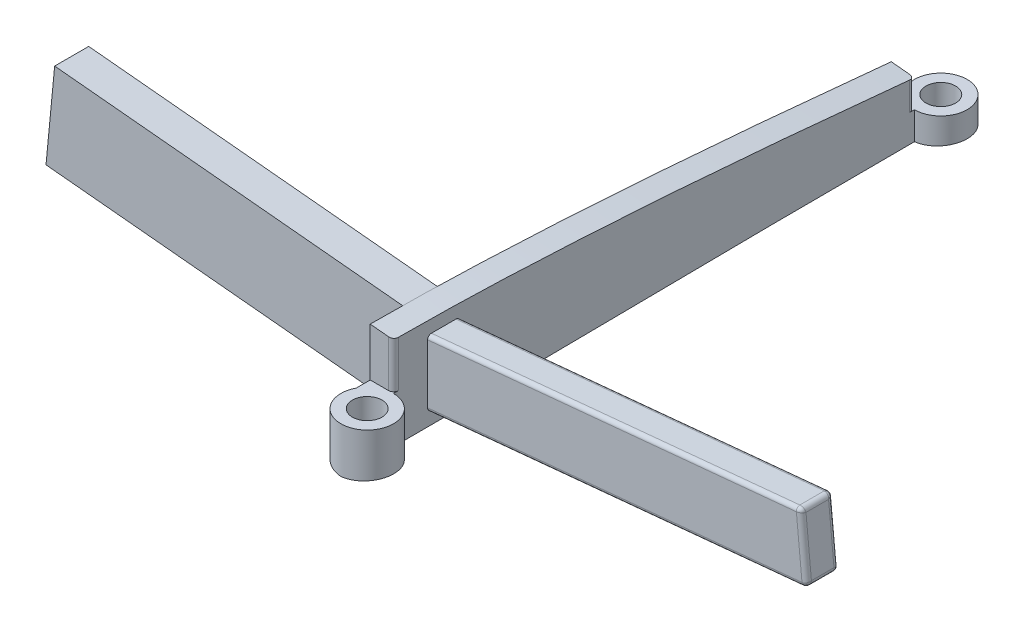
ISO-10303-21;
HEADER;
FILE_DESCRIPTION(('STEP AP214'),'2;1');
FILE_NAME('part.step','',(''),(''),'','','');
FILE_SCHEMA(('AUTOMOTIVE_DESIGN { 1 0 10303 214 1 1 1 1 }'));
ENDSEC;
DATA;
#1=APPLICATION_CONTEXT('core data for automotive mechanical design processes');
#2=APPLICATION_PROTOCOL_DEFINITION('international standard','automotive_design',2000,#1);
#3=PRODUCT_CONTEXT('',#1,'mechanical');
#4=PRODUCT('Part','Part','',(#3));
#5=PRODUCT_RELATED_PRODUCT_CATEGORY('part','',(#4));
#6=PRODUCT_DEFINITION_FORMATION('','',#4);
#7=PRODUCT_DEFINITION_CONTEXT('part definition',#1,'design');
#8=PRODUCT_DEFINITION('design','',#6,#7);
#9=PRODUCT_DEFINITION_SHAPE('','',#8);
#10=(LENGTH_UNIT() NAMED_UNIT(*) SI_UNIT(.MILLI.,.METRE.));
#11=(NAMED_UNIT(*) PLANE_ANGLE_UNIT() SI_UNIT($,.RADIAN.));
#12=(NAMED_UNIT(*) SI_UNIT($,.STERADIAN.) SOLID_ANGLE_UNIT());
#13=UNCERTAINTY_MEASURE_WITH_UNIT(LENGTH_MEASURE(1.E-05),#10,'distance_accuracy_value','');
#14=(GEOMETRIC_REPRESENTATION_CONTEXT(3) GLOBAL_UNCERTAINTY_ASSIGNED_CONTEXT((#13)) GLOBAL_UNIT_ASSIGNED_CONTEXT((#10,
#11,#12)) REPRESENTATION_CONTEXT('',''));
#15=CARTESIAN_POINT('',(0.,0.,0.));
#16=DIRECTION('',(0.,0.,1.));
#17=DIRECTION('',(1.,0.,0.));
#18=AXIS2_PLACEMENT_3D('',#15,#16,#17);
#19=CARTESIAN_POINT('',(-2.43366414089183,15.1644301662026,-60.0450652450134));
#20=DIRECTION('',(-1.,0.,0.));
#21=DIRECTION('',(0.,0.,1.));
#22=AXIS2_PLACEMENT_3D('',#19,#20,#21);
#23=PLANE('',#22);
#24=DIRECTION('',(0.,0.,-1.));
#25=VECTOR('',#24,1.);
#26=CARTESIAN_POINT('',(-2.43366414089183,11.2124816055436,-60.0450652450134));
#27=LINE('',#26,#25);
#28=CARTESIAN_POINT('',(-2.43366414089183,11.2124816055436,-31.2805384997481));
#29=VERTEX_POINT('',#28);
#30=CARTESIAN_POINT('',(-2.43366414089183,11.2124816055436,-32.75));
#31=VERTEX_POINT('',#30);
#32=EDGE_CURVE('E464',#29,#31,#27,.T.);
#33=ORIENTED_EDGE('',*,*,#32,.T.);
#34=DIRECTION('',(0.,1.,0.));
#35=VECTOR('',#34,1.);
#36=CARTESIAN_POINT('',(-2.43366414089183,15.1644301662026,-32.75));
#37=LINE('',#36,#35);
#38=CARTESIAN_POINT('',(-2.43366414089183,16.2779839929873,-32.75));
#39=VERTEX_POINT('',#38);
#40=EDGE_CURVE('E845',#31,#39,#37,.T.);
#41=ORIENTED_EDGE('',*,*,#40,.T.);
#42=CARTESIAN_POINT('',(-2.43366414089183,12.514655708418,-90.0000000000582));
#43=CARTESIAN_POINT('',(-2.43366414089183,12.5839857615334,-89.3221558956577));
#44=CARTESIAN_POINT('',(-2.43366414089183,12.7253328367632,-87.9304294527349));
#45=CARTESIAN_POINT('',(-2.43366414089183,12.9362429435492,-85.8247567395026));
#46=CARTESIAN_POINT('',(-2.43366414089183,13.1467816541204,-83.6830026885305));
#47=CARTESIAN_POINT('',(-2.43366414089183,13.3540596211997,-81.5414799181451));
#48=CARTESIAN_POINT('',(-2.43366414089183,13.5568088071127,-79.4000728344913));
#49=CARTESIAN_POINT('',(-2.43366414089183,13.7558814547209,-77.2590385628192));
#50=CARTESIAN_POINT('',(-2.43366414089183,13.9498875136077,-75.118202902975));
#51=CARTESIAN_POINT('',(-2.43366414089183,14.1398792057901,-72.9777893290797));
#52=CARTESIAN_POINT('',(-2.43366414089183,14.3239206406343,-70.8375836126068));
#53=CARTESIAN_POINT('',(-2.43366414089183,14.5032059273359,-68.6977112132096));
#54=CARTESIAN_POINT('',(-2.43366414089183,14.6766253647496,-66.5582950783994));
#55=CARTESIAN_POINT('',(-2.43366414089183,14.8436950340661,-64.4193682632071));
#56=CARTESIAN_POINT('',(-2.43366414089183,15.0048411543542,-62.2810826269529));
#57=CARTESIAN_POINT('',(-2.43366414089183,15.1585948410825,-60.1432879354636));
#58=CARTESIAN_POINT('',(-2.43366414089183,15.3058595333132,-58.0061219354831));
#59=CARTESIAN_POINT('',(-2.43366414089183,15.4445276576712,-55.869449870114));
#60=CARTESIAN_POINT('',(-2.43366414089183,15.5755092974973,-53.7337136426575));
#61=CARTESIAN_POINT('',(-2.43366414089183,15.6981247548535,-51.5992388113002));
#62=CARTESIAN_POINT('',(-2.43366414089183,15.8105620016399,-49.466043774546));
#63=CARTESIAN_POINT('',(-2.43366414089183,15.9131885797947,-47.3342152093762));
#64=CARTESIAN_POINT('',(-2.43366414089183,16.0053282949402,-45.2040840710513));
#65=CARTESIAN_POINT('',(-2.43366414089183,16.085639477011,-43.0758059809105));
#66=CARTESIAN_POINT('',(-2.43366414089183,16.1535789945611,-40.9496729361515));
#67=CARTESIAN_POINT('',(-2.43366414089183,16.2079518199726,-38.8259032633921));
#68=CARTESIAN_POINT('',(-2.43366414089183,16.2484386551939,-36.7048850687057));
#69=CARTESIAN_POINT('',(-2.43366414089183,16.2727651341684,-34.5870264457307));
#70=CARTESIAN_POINT('',(-2.43366414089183,16.2810826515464,-32.4727607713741));
#71=CARTESIAN_POINT('',(-2.43366414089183,16.2738398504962,-30.9442009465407));
#72=CARTESIAN_POINT('',(-2.43366414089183,16.2652325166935,-30.1204539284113));
#73=CARTESIAN_POINT('',(-2.43366414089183,16.2638731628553,-30.0000000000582));
#74=B_SPLINE_CURVE_WITH_KNOTS('',3,(#42,#43,#44,#45,#46,#47,#48,#49,#50,#51,#52,#53,#54,#55,#56,
#57,#58,#59,#60,#61,#62,#63,#64,#65,#66,#67,#68,#69,#70,#71,#72,#73),.UNSPECIFIED.,.F.,.F.,(4,1,
1,1,1,1,1,1,1,1,1,1,1,1,1,1,1,1,1,1,1,1,1,1,1,1,1,1,1,4),(0.209093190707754,0.215633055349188,
0.222519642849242,0.229404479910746,0.236288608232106,0.243169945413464,0.250049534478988,
0.256926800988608,0.263801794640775,0.270673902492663,0.277544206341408,0.284412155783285,
0.291275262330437,0.298136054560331,0.304993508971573,0.311846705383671,0.318697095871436,
0.325544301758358,0.332383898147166,0.339217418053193,0.34604697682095,0.352868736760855,
0.359681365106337,0.366488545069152,0.373285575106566,0.380071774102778,0.386849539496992,
0.393613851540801,0.400364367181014,0.401520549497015),.UNSPECIFIED.);
#75=CARTESIAN_POINT('',(-2.43366414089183,12.79331064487,-87.25));
#76=VERTEX_POINT('',#75);
#77=EDGE_CURVE('E674',#76,#39,#74,.T.);
#78=ORIENTED_EDGE('',*,*,#77,.F.);
#79=DIRECTION('',(0.,-1.,0.));
#80=VECTOR('',#79,1.);
#81=CARTESIAN_POINT('',(-2.43366414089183,15.1644301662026,-87.25));
#82=LINE('',#81,#80);
#83=CARTESIAN_POINT('',(-2.43366414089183,9.6632470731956,-87.25));
#84=VERTEX_POINT('',#83);
#85=EDGE_CURVE('E838',#76,#84,#82,.T.);
#86=ORIENTED_EDGE('',*,*,#85,.T.);
#87=DIRECTION('',(0.,0.,-1.));
#88=VECTOR('',#87,1.);
#89=CARTESIAN_POINT('',(-2.43366414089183,9.6632470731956,-60.0450652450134));
#90=LINE('',#89,#88);
#91=CARTESIAN_POINT('',(-2.43366414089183,9.6632470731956,-88.7194615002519));
#92=VERTEX_POINT('',#91);
#93=EDGE_CURVE('E737',#84,#92,#90,.T.);
#94=ORIENTED_EDGE('',*,*,#93,.T.);
#95=DIRECTION('',(0.,-1.,0.));
#96=VECTOR('',#95,1.);
#97=CARTESIAN_POINT('',(-2.43366414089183,20.,-88.7194615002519));
#98=LINE('',#97,#96);
#99=CARTESIAN_POINT('',(-2.43366414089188,6.99883863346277,-88.7194615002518));
#100=VERTEX_POINT('',#99);
#101=EDGE_CURVE('E660',#92,#100,#98,.T.);
#102=ORIENTED_EDGE('',*,*,#101,.T.);
#103=CARTESIAN_POINT('',(-2.43366414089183,6.63337981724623,-30.0000000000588));
#104=CARTESIAN_POINT('',(-2.43366414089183,6.6282643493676,-30.5758008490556));
#105=CARTESIAN_POINT('',(-2.43366414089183,6.61877834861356,-31.8647244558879));
#106=CARTESIAN_POINT('',(-2.43366414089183,6.61100070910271,-33.8678038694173));
#107=CARTESIAN_POINT('',(-2.43366414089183,6.60893298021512,-36.0101567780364));
#108=CARTESIAN_POINT('',(-2.43366414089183,6.61308587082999,-38.154983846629));
#109=CARTESIAN_POINT('',(-2.43366414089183,6.62179926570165,-40.3021612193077));
#110=CARTESIAN_POINT('',(-2.43366414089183,6.63551606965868,-42.4518565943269));
#111=CARTESIAN_POINT('',(-2.43366414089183,6.65201434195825,-44.6037418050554));
#112=CARTESIAN_POINT('',(-2.43366414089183,6.67116269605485,-46.7572715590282));
#113=CARTESIAN_POINT('',(-2.43366414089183,6.69267896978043,-48.911960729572));
#114=CARTESIAN_POINT('',(-2.43366414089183,6.71582836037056,-51.0679480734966));
#115=CARTESIAN_POINT('',(-2.43366414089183,6.73987634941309,-53.2252207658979));
#116=CARTESIAN_POINT('',(-2.43366414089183,6.76502640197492,-55.3836004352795));
#117=CARTESIAN_POINT('',(-2.43366414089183,6.79026359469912,-57.5431336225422));
#118=CARTESIAN_POINT('',(-2.43366414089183,6.81559285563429,-59.7034378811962));
#119=CARTESIAN_POINT('',(-2.43366414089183,6.84021266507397,-61.8637877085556));
#120=CARTESIAN_POINT('',(-2.43366414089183,6.86483832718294,-64.0233276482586));
#121=CARTESIAN_POINT('',(-2.43366414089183,6.88753172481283,-66.1820202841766));
#122=CARTESIAN_POINT('',(-2.43366414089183,6.9099178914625,-68.3398787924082));
#123=CARTESIAN_POINT('',(-2.43366414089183,6.92992006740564,-70.4969199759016));
#124=CARTESIAN_POINT('',(-2.43366414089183,6.94873460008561,-72.6528510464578));
#125=CARTESIAN_POINT('',(-2.43366414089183,6.96477329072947,-74.8080905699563));
#126=CARTESIAN_POINT('',(-2.43366414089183,6.97848127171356,-76.9628769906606));
#127=CARTESIAN_POINT('',(-2.43366414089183,6.98924450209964,-79.1172617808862));
#128=CARTESIAN_POINT('',(-2.43366414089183,6.99752704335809,-81.2708174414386));
#129=CARTESIAN_POINT('',(-2.43366414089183,7.00215033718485,-83.4239557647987));
#130=CARTESIAN_POINT('',(-2.43366414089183,7.00357574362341,-85.5767180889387));
#131=CARTESIAN_POINT('',(-2.43366414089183,7.00180048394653,-87.7289957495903));
#132=CARTESIAN_POINT('',(-2.43366414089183,6.99764657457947,-89.2033220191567));
#133=CARTESIAN_POINT('',(-2.43366414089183,6.9948410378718,-89.9602036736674));
#134=CARTESIAN_POINT('',(-2.43366414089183,6.99469163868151,-90.0000000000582));
#135=B_SPLINE_CURVE_WITH_KNOTS('',3,(#103,#104,#105,#106,#107,#108,#109,#110,#111,#112,#113,
#114,#115,#116,#117,#118,#119,#120,#121,#122,#123,#124,#125,#126,#127,#128,#129,#130,#131,#132,
#133,#134),.UNSPECIFIED.,.F.,.F.,(4,1,1,1,1,1,1,1,1,1,1,1,1,1,1,1,1,1,1,1,1,1,1,1,1,1,1,1,1,4),
(0.600232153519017,0.605758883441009,0.612603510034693,0.619457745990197,0.626321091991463,
0.633189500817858,0.640066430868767,0.646954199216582,0.653843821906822,0.660736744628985,
0.667635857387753,0.674538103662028,0.681443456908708,0.688353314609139,0.695266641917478,
0.702179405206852,0.709089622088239,0.715995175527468,0.722899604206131,0.729801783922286,
0.736699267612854,0.743592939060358,0.750488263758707,0.757381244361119,0.764270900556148,
0.771158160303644,0.778047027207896,0.784933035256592,0.791815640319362,0.792197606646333),.UNSPECIFIED.);
#136=CARTESIAN_POINT('',(-2.43366414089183,6.62345727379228,-31.2805384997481));
#137=VERTEX_POINT('',#136);
#138=EDGE_CURVE('E683',#137,#100,#135,.T.);
#139=ORIENTED_EDGE('',*,*,#138,.F.);
#140=DIRECTION('',(0.,-1.,0.));
#141=VECTOR('',#140,1.);
#142=CARTESIAN_POINT('',(-2.43366414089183,20.,-31.2805384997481));
#143=LINE('',#142,#141);
#144=EDGE_CURVE('E705',#29,#137,#143,.T.);
#145=ORIENTED_EDGE('',*,*,#144,.F.);
#146=EDGE_LOOP('',(#33,#41,#78,#86,#94,#102,#139,#145));
#147=FACE_BOUND('',#146,.T.);
#148=DIRECTION('',(0.,-1.,0.));
#149=VECTOR('',#148,1.);
#150=CARTESIAN_POINT('',(-2.43366414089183,15.1644301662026,-36.22));
#151=LINE('',#150,#149);
#152=CARTESIAN_POINT('',(-2.43366414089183,16.1649290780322,-36.22));
#153=VERTEX_POINT('',#152);
#154=CARTESIAN_POINT('',(-2.43366414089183,6.67546408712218,-36.22));
#155=VERTEX_POINT('',#154);
#156=EDGE_CURVE('E264',#153,#155,#151,.T.);
#157=ORIENTED_EDGE('',*,*,#156,.T.);
#158=DIRECTION('',(0.,0.,-1.));
#159=VECTOR('',#158,1.);
#160=CARTESIAN_POINT('',(-2.43366414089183,6.67546408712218,-60.0450652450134));
#161=LINE('',#160,#159);
#162=CARTESIAN_POINT('',(-2.43366414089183,6.67546408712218,-39.78));
#163=VERTEX_POINT('',#162);
#164=EDGE_CURVE('E274',#155,#163,#161,.T.);
#165=ORIENTED_EDGE('',*,*,#164,.T.);
#166=DIRECTION('',(0.,1.,0.));
#167=VECTOR('',#166,1.);
#168=CARTESIAN_POINT('',(-2.43366414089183,15.1644301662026,-39.78));
#169=LINE('',#168,#167);
#170=CARTESIAN_POINT('',(-2.43366414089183,16.1649290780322,-39.78));
#171=VERTEX_POINT('',#170);
#172=EDGE_CURVE('E243',#163,#171,#169,.T.);
#173=ORIENTED_EDGE('',*,*,#172,.T.);
#174=DIRECTION('',(0.,0.,1.));
#175=VECTOR('',#174,1.);
#176=CARTESIAN_POINT('',(-2.43366414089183,16.1649290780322,-60.0450652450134));
#177=LINE('',#176,#175);
#178=EDGE_CURVE('E268',#171,#153,#177,.T.);
#179=ORIENTED_EDGE('',*,*,#178,.T.);
#180=EDGE_LOOP('',(#157,#165,#173,#179));
#181=FACE_BOUND('',#180,.T.);
#182=ADVANCED_FACE('F41',(#147,#181),#23,.T.);
#183=CARTESIAN_POINT('',(0.,6.6039579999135,-104.933412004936));
#184=CARTESIAN_POINT('',(39.8158479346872,10.4377881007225,-104.933412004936));
#185=CARTESIAN_POINT('',(0.,6.61651233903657,-104.217093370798));
#186=CARTESIAN_POINT('',(39.8158479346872,10.4503424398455,-104.217093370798));
#187=CARTESIAN_POINT('',(0.,6.64004096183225,-102.784140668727));
#188=CARTESIAN_POINT('',(39.8158479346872,10.4738710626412,-102.784140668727));
#189=CARTESIAN_POINT('',(0.,6.67090742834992,-100.634313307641));
#190=CARTESIAN_POINT('',(39.8158479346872,10.5047375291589,-100.634313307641));
#191=CARTESIAN_POINT('',(0.,6.69739144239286,-98.484230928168));
#192=CARTESIAN_POINT('',(39.8158479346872,10.5312215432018,-98.484230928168));
#193=CARTESIAN_POINT('',(0.,6.7198780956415,-96.3338970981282));
#194=CARTESIAN_POINT('',(39.8158479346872,10.5537081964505,-96.3338970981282));
#195=CARTESIAN_POINT('',(0.,6.7375166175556,-94.1832570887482));
#196=CARTESIAN_POINT('',(39.8158479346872,10.5713467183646,-94.1832570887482));
#197=CARTESIAN_POINT('',(0.,6.75171634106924,-92.0320636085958));
#198=CARTESIAN_POINT('',(39.8158479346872,10.5855464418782,-92.0320636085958));
#199=CARTESIAN_POINT('',(0.,6.76140292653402,-89.8806766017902));
#200=CARTESIAN_POINT('',(39.8158479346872,10.595233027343,-89.8806766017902));
#201=CARTESIAN_POINT('',(0.,6.76746528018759,-87.7289957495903));
#202=CARTESIAN_POINT('',(39.8158479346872,10.6012953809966,-87.7289957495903));
#203=CARTESIAN_POINT('',(0.,6.76924053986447,-85.5767180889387));
#204=CARTESIAN_POINT('',(39.8158479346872,10.6030706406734,-85.5767180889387));
#205=CARTESIAN_POINT('',(0.,6.76781513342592,-83.4239557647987));
#206=CARTESIAN_POINT('',(39.8158479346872,10.6016452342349,-83.4239557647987));
#207=CARTESIAN_POINT('',(0.,6.76319183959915,-81.2708174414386));
#208=CARTESIAN_POINT('',(39.8158479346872,10.5970219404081,-81.2708174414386));
#209=CARTESIAN_POINT('',(0.,6.7549092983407,-79.1172617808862));
#210=CARTESIAN_POINT('',(39.8158479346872,10.5887393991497,-79.1172617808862));
#211=CARTESIAN_POINT('',(0.,6.74414606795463,-76.9628769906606));
#212=CARTESIAN_POINT('',(39.8158479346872,10.5779761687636,-76.9628769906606));
#213=CARTESIAN_POINT('',(0.,6.73043808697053,-74.8080905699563));
#214=CARTESIAN_POINT('',(39.8158479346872,10.5642681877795,-74.8080905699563));
#215=CARTESIAN_POINT('',(0.,6.71439939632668,-72.6528510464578));
#216=CARTESIAN_POINT('',(39.8158479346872,10.5482294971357,-72.6528510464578));
#217=CARTESIAN_POINT('',(0.,6.6955848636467,-70.4969199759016));
#218=CARTESIAN_POINT('',(39.8158479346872,10.5294149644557,-70.4969199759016));
#219=CARTESIAN_POINT('',(0.,6.67558268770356,-68.3398787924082));
#220=CARTESIAN_POINT('',(39.8158479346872,10.5094127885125,-68.3398787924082));
#221=CARTESIAN_POINT('',(0.,6.65319652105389,-66.1820202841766));
#222=CARTESIAN_POINT('',(39.8158479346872,10.4870266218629,-66.1820202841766));
#223=CARTESIAN_POINT('',(0.,6.630503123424,-64.0233276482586));
#224=CARTESIAN_POINT('',(39.8158479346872,10.464333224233,-64.0233276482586));
#225=CARTESIAN_POINT('',(0.,6.60587746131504,-61.8637877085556));
#226=CARTESIAN_POINT('',(39.8158479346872,10.439707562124,-61.8637877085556));
#227=CARTESIAN_POINT('',(0.,6.58125765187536,-59.7034378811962));
#228=CARTESIAN_POINT('',(39.8158479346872,10.4150877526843,-59.7034378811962));
#229=CARTESIAN_POINT('',(0.,6.55592839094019,-57.5431336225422));
#230=CARTESIAN_POINT('',(39.8158479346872,10.3897584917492,-57.5431336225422));
#231=CARTESIAN_POINT('',(0.,6.53069119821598,-55.3836004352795));
#232=CARTESIAN_POINT('',(39.8158479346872,10.364521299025,-55.3836004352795));
#233=CARTESIAN_POINT('',(0.,6.50554114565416,-53.2252207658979));
#234=CARTESIAN_POINT('',(39.8158479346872,10.3393712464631,-53.2252207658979));
#235=CARTESIAN_POINT('',(0.,6.48149315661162,-51.0679480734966));
#236=CARTESIAN_POINT('',(39.8158479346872,10.3153232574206,-51.0679480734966));
#237=CARTESIAN_POINT('',(0.,6.4583437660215,-48.911960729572));
#238=CARTESIAN_POINT('',(39.8158479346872,10.2921738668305,-48.911960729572));
#239=CARTESIAN_POINT('',(0.,6.43682749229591,-46.7572715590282));
#240=CARTESIAN_POINT('',(39.8158479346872,10.2706575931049,-46.7572715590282));
#241=CARTESIAN_POINT('',(0.,6.41767913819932,-44.6037418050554));
#242=CARTESIAN_POINT('',(39.8158479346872,10.2515092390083,-44.6037418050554));
#243=CARTESIAN_POINT('',(0.,6.40118086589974,-42.4518565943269));
#244=CARTESIAN_POINT('',(39.8158479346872,10.2350109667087,-42.4518565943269));
#245=CARTESIAN_POINT('',(0.,6.38746406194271,-40.3021612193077));
#246=CARTESIAN_POINT('',(39.8158479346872,10.2212941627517,-40.3021612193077));
#247=CARTESIAN_POINT('',(0.,6.37875066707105,-38.154983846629));
#248=CARTESIAN_POINT('',(39.8158479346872,10.21258076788,-38.154983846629));
#249=CARTESIAN_POINT('',(0.,6.37459777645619,-36.0101567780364));
#250=CARTESIAN_POINT('',(39.8158479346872,10.2084278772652,-36.0101567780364));
#251=CARTESIAN_POINT('',(0.,6.37666550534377,-33.8678038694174));
#252=CARTESIAN_POINT('',(39.8158479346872,10.2104956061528,-33.8678038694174));
#253=CARTESIAN_POINT('',(0.,6.38497419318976,-31.7279564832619));
#254=CARTESIAN_POINT('',(39.8158479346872,10.2188042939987,-31.7279564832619));
#255=CARTESIAN_POINT('',(0.,6.4014889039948,-29.5911127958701));
#256=CARTESIAN_POINT('',(39.8158479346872,10.2353190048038,-29.5911127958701));
#257=CARTESIAN_POINT('',(0.,6.42598325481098,-27.457663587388));
#258=CARTESIAN_POINT('',(39.8158479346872,10.25981335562,-27.457663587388));
#259=CARTESIAN_POINT('',(0.,6.46065108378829,-25.3283788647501));
#260=CARTESIAN_POINT('',(39.8158479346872,10.2944811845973,-25.3283788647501));
#261=CARTESIAN_POINT('',(0.,6.50717609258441,-23.2036294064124));
#262=CARTESIAN_POINT('',(39.8158479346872,10.3410061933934,-23.2036294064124));
#263=CARTESIAN_POINT('',(0.,6.56589828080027,-21.0839502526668));
#264=CARTESIAN_POINT('',(39.8158479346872,10.3997283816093,-21.0839502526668));
#265=CARTESIAN_POINT('',(0.,6.64004813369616,-18.9711462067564));
#266=CARTESIAN_POINT('',(39.8158479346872,10.4738782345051,-18.9711462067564));
#267=CARTESIAN_POINT('',(0.,6.71534428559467,-17.2094120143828));
#268=CARTESIAN_POINT('',(39.8158479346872,10.5491743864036,-17.2094120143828));
#269=CARTESIAN_POINT('',(0.,6.76867511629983,-16.152471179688));
#270=CARTESIAN_POINT('',(39.8158479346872,10.6025052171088,-16.152471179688));
#271=CARTESIAN_POINT('',(0.,6.78761784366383,-15.7968710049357));
#272=CARTESIAN_POINT('',(39.8158479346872,10.6214479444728,-15.7968710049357));
#273=B_SPLINE_SURFACE_WITH_KNOTS('',3,1,((#183,#184),(#185,#186),(#187,#188),(#189,#190),(#191,
#192),(#193,#194),(#195,#196),(#197,#198),(#199,#200),(#201,#202),(#203,#204),(#205,#206),(#207,
#208),(#209,#210),(#211,#212),(#213,#214),(#215,#216),(#217,#218),(#219,#220),(#221,#222),(#223,
#224),(#225,#226),(#227,#228),(#229,#230),(#231,#232),(#233,#234),(#235,#236),(#237,#238),(#239,
#240),(#241,#242),(#243,#244),(#245,#246),(#247,#248),(#249,#250),(#251,#252),(#253,#254),(#255,
#256),(#257,#258),(#259,#260),(#261,#262),(#263,#264),(#265,#266),(#267,#268),(#269,#270),(#271,
#272)),.UNSPECIFIED.,.F.,.F.,.F.,(4,1,1,1,1,1,1,1,1,1,1,1,1,1,1,1,1,1,1,1,1,1,1,1,1,1,1,1,1,1,1,
1,1,1,1,1,1,1,1,1,1,1,4),(2,2),(0.,0.0241097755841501,0.0482292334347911,0.0723549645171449,
0.0964713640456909,0.120597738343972,0.144732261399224,0.168866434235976,0.192998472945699,
0.217142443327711,0.241296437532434,0.265444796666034,0.289601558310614,0.313769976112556,
0.33794661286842,0.362117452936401,0.386301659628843,0.410502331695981,0.434710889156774,
0.45892339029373,0.483152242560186,0.50739002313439,0.531629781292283,0.555857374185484,
0.580069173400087,0.604270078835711,0.628459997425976,0.652628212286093,0.676784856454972,
0.7009349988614,0.725047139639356,0.74912940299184,0.773193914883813,0.797226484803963,
0.821225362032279,0.845206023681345,0.869139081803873,0.893026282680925,0.916871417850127,
0.940659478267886,0.964386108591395,0.988016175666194,1.),(0.,1.),.UNSPECIFIED.);
#274=CARTESIAN_POINT('',(0.,6.75352851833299,-91.55));
#275=CARTESIAN_POINT('',(0.0437695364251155,6.75774303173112,-91.5499996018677));
#276=CARTESIAN_POINT('',(0.087517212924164,6.7619649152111,-91.5481448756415));
#277=CARTESIAN_POINT('',(0.174698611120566,6.77039717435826,-91.5407453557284));
#278=CARTESIAN_POINT('',(0.218132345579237,6.77460755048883,-91.5352007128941));
#279=CARTESIAN_POINT('',(0.347435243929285,6.78717018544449,-91.5130813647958));
#280=CARTESIAN_POINT('',(0.432436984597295,6.79546655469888,-91.4910211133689));
#281=CARTESIAN_POINT('',(0.597539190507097,6.81165541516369,-91.4328716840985));
#282=CARTESIAN_POINT('',(0.67763719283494,6.81954770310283,-91.396775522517));
#283=CARTESIAN_POINT('',(0.830637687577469,6.83469843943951,-91.3115647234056));
#284=CARTESIAN_POINT('',(0.903541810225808,6.84195703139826,-91.2624530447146));
#285=CARTESIAN_POINT('',(1.03993846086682,6.85561498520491,-91.1526834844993));
#286=CARTESIAN_POINT('',(1.10344766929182,6.86201586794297,-91.0920465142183));
#287=CARTESIAN_POINT('',(1.21938473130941,6.87378486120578,-90.9608659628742));
#288=CARTESIAN_POINT('',(1.27181109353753,6.87915283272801,-90.890321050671));
#289=CARTESIAN_POINT('',(1.36383410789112,6.88867240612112,-90.74166378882));
#290=CARTESIAN_POINT('',(1.4034859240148,6.89282923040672,-90.6635859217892));
#291=CARTESIAN_POINT('',(1.46910988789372,6.89983262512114,-90.5018295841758));
#292=CARTESIAN_POINT('',(1.49508326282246,6.90267931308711,-90.4181516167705));
#293=CARTESIAN_POINT('',(1.53250703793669,6.90696755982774,-90.2479543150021));
#294=CARTESIAN_POINT('',(1.54401974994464,6.90841514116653,-90.1614488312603));
#295=CARTESIAN_POINT('',(1.55238929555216,6.90988359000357,-89.9877189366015));
#296=CARTESIAN_POINT('',(1.5492460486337,6.90990444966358,-89.9004945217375));
#297=CARTESIAN_POINT('',(1.52841535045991,6.90852087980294,-89.7280214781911));
#298=CARTESIAN_POINT('',(1.51076266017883,6.90711985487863,-89.642768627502));
#299=CARTESIAN_POINT('',(1.46148024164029,6.9029408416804,-89.4764520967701));
#300=CARTESIAN_POINT('',(1.42985056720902,6.90016285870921,-89.3953884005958));
#301=CARTESIAN_POINT('',(1.35346701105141,6.89330765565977,-89.2396415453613));
#302=CARTESIAN_POINT('',(1.30870428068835,6.88922955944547,-89.164962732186));
#303=CARTESIAN_POINT('',(1.23278515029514,6.88223843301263,-89.0594546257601));
#304=CARTESIAN_POINT('',(1.20601046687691,6.87976185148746,-89.0253645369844));
#305=CARTESIAN_POINT('',(1.14968879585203,6.87453214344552,-88.9595223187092));
#306=CARTESIAN_POINT('',(1.1201392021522,6.87177875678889,-88.9277724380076));
#307=CARTESIAN_POINT('',(1.02749992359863,6.86312011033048,-88.8362645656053));
#308=CARTESIAN_POINT('',(0.960524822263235,6.85682604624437,-88.7803941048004));
#309=CARTESIAN_POINT('',(0.818221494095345,6.8433945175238,-88.6806963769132));
#310=CARTESIAN_POINT('',(0.742893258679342,6.83625705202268,-88.6368691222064));
#311=CARTESIAN_POINT('',(0.625085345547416,6.8250589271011,-88.5809585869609));
#312=CARTESIAN_POINT('',(0.584873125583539,6.82123081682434,-88.563920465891));
#313=CARTESIAN_POINT('',(0.503208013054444,6.81344565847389,-88.5333085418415));
#314=CARTESIAN_POINT('',(0.461756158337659,6.80948871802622,-88.5197319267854));
#315=CARTESIAN_POINT('',(0.335986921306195,6.79746775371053,-88.4843590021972));
#316=CARTESIAN_POINT('',(0.25009829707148,6.78923860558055,-88.4678450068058));
#317=CARTESIAN_POINT('',(0.136397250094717,6.77832036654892,-88.4557688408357));
#318=CARTESIAN_POINT('',(0.109138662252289,6.77570102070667,-88.4536044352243));
#319=CARTESIAN_POINT('',(0.0545914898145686,6.77045585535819,-88.4507223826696));
#320=CARTESIAN_POINT('',(0.0273030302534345,6.76783005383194,-88.4500023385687));
#321=CARTESIAN_POINT('',(0.,6.76520107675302,-88.45));
#322=B_SPLINE_CURVE_WITH_KNOTS('',3,(#274,#275,#276,#277,#278,#279,#280,#281,#282,#283,#284,
#285,#286,#287,#288,#289,#290,#291,#292,#293,#294,#295,#296,#297,#298,#299,#300,#301,#302,#303,
#304,#305,#306,#307,#308,#309,#310,#311,#312,#313,#314,#315,#316,#317,#318,#319,#320,#321),
.UNSPECIFIED.,.F.,.F.,(4,2,2,2,2,2,2,2,2,2,2,2,2,2,2,2,2,2,2,2,2,2,2,4),(0.,0.131834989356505,
0.263664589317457,0.526934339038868,0.790335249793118,1.05367633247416,1.31654409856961,
1.57944721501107,1.84119933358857,2.10292796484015,2.36352487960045,2.62412322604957,
2.8840990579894,3.14407388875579,3.40422428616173,3.53434793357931,3.66459503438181,
3.92562219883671,4.1866496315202,4.31803070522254,4.4493047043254,4.71133395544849,
4.79371964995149,4.87596849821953),.UNSPECIFIED.);
#323=CARTESIAN_POINT('',(0.,6.75352851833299,-91.55));
#324=VERTEX_POINT('',#323);
#325=CARTESIAN_POINT('',(0.,6.76520107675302,-88.45));
#326=VERTEX_POINT('',#325);
#327=EDGE_CURVE('E324',#324,#326,#322,.T.);
#328=CARTESIAN_POINT('',(0.,6.6039579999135,-104.933412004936));
#329=CARTESIAN_POINT('',(0.,6.61651233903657,-104.217093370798));
#330=CARTESIAN_POINT('',(0.,6.64004096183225,-102.784140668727));
#331=CARTESIAN_POINT('',(0.,6.67090742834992,-100.634313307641));
#332=CARTESIAN_POINT('',(0.,6.69739144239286,-98.484230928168));
#333=CARTESIAN_POINT('',(0.,6.7198780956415,-96.3338970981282));
#334=CARTESIAN_POINT('',(0.,6.7375166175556,-94.1832570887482));
#335=CARTESIAN_POINT('',(0.,6.75171634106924,-92.0320636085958));
#336=CARTESIAN_POINT('',(0.,6.76140292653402,-89.8806766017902));
#337=CARTESIAN_POINT('',(0.,6.76746528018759,-87.7289957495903));
#338=CARTESIAN_POINT('',(0.,6.76924053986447,-85.5767180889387));
#339=CARTESIAN_POINT('',(0.,6.76781513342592,-83.4239557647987));
#340=CARTESIAN_POINT('',(0.,6.76319183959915,-81.2708174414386));
#341=CARTESIAN_POINT('',(0.,6.7549092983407,-79.1172617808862));
#342=CARTESIAN_POINT('',(0.,6.74414606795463,-76.9628769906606));
#343=CARTESIAN_POINT('',(0.,6.73043808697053,-74.8080905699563));
#344=CARTESIAN_POINT('',(0.,6.71439939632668,-72.6528510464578));
#345=CARTESIAN_POINT('',(0.,6.6955848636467,-70.4969199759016));
#346=CARTESIAN_POINT('',(0.,6.67558268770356,-68.3398787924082));
#347=CARTESIAN_POINT('',(0.,6.65319652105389,-66.1820202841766));
#348=CARTESIAN_POINT('',(0.,6.630503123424,-64.0233276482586));
#349=CARTESIAN_POINT('',(0.,6.60587746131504,-61.8637877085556));
#350=CARTESIAN_POINT('',(0.,6.58125765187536,-59.7034378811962));
#351=CARTESIAN_POINT('',(0.,6.55592839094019,-57.5431336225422));
#352=CARTESIAN_POINT('',(0.,6.53069119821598,-55.3836004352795));
#353=CARTESIAN_POINT('',(0.,6.50554114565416,-53.2252207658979));
#354=CARTESIAN_POINT('',(0.,6.48149315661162,-51.0679480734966));
#355=CARTESIAN_POINT('',(0.,6.4583437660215,-48.911960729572));
#356=CARTESIAN_POINT('',(0.,6.43682749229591,-46.7572715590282));
#357=CARTESIAN_POINT('',(0.,6.41767913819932,-44.6037418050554));
#358=CARTESIAN_POINT('',(0.,6.40118086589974,-42.4518565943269));
#359=CARTESIAN_POINT('',(0.,6.38746406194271,-40.3021612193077));
#360=CARTESIAN_POINT('',(0.,6.37875066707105,-38.154983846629));
#361=CARTESIAN_POINT('',(0.,6.37459777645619,-36.0101567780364));
#362=CARTESIAN_POINT('',(0.,6.37666550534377,-33.8678038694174));
#363=CARTESIAN_POINT('',(0.,6.38497419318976,-31.7279564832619));
#364=CARTESIAN_POINT('',(0.,6.4014889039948,-29.5911127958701));
#365=CARTESIAN_POINT('',(0.,6.42598325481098,-27.457663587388));
#366=CARTESIAN_POINT('',(0.,6.46065108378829,-25.3283788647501));
#367=CARTESIAN_POINT('',(0.,6.50717609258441,-23.2036294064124));
#368=CARTESIAN_POINT('',(0.,6.56589828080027,-21.0839502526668));
#369=CARTESIAN_POINT('',(0.,6.64004813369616,-18.9711462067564));
#370=CARTESIAN_POINT('',(0.,6.71534428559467,-17.2094120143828));
#371=CARTESIAN_POINT('',(0.,6.76867511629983,-16.152471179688));
#372=CARTESIAN_POINT('',(0.,6.78761784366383,-15.7968710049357));
#373=B_SPLINE_CURVE_WITH_KNOTS('',3,(#328,#329,#330,#331,#332,#333,#334,#335,#336,#337,#338,
#339,#340,#341,#342,#343,#344,#345,#346,#347,#348,#349,#350,#351,#352,#353,#354,#355,#356,#357,
#358,#359,#360,#361,#362,#363,#364,#365,#366,#367,#368,#369,#370,#371,#372),.UNSPECIFIED.,.F.,
.F.,(4,1,1,1,1,1,1,1,1,1,1,1,1,1,1,1,1,1,1,1,1,1,1,1,1,1,1,1,1,1,1,1,1,1,1,1,1,1,1,1,1,1,4),
(0.554771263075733,0.5616475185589,0.568526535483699,0.575407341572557,0.582285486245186,
0.589166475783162,0.596049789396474,0.602933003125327,0.609815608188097,0.616701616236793,
0.623590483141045,0.630477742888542,0.63736739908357,0.644260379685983,0.651155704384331,
0.658049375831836,0.664946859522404,0.671849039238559,0.678753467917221,0.68565902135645,
0.692569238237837,0.699482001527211,0.70639532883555,0.713305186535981,0.720210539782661,
0.727112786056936,0.734011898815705,0.740904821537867,0.747794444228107,0.754682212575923,
0.761559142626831,0.768427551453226,0.775290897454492,0.782145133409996,0.788989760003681,
0.795829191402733,0.802655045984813,0.80946782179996,0.8162686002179,0.823053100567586,
0.829820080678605,0.836559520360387,0.839977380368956),.UNSPECIFIED.);
#374=CARTESIAN_POINT('',(0.,6.74673344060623,-92.75));
#375=VERTEX_POINT('',#374);
#376=EDGE_CURVE('E373',#375,#324,#373,.T.);
#377=CARTESIAN_POINT('',(9.85308168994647E-11,6.76751870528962,-87.25));
#378=CARTESIAN_POINT('',(0.0775980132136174,6.77499049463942,-87.2499927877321));
#379=CARTESIAN_POINT('',(0.155193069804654,6.78245753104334,-87.2532844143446));
#380=CARTESIAN_POINT('',(0.309831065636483,6.79732914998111,-87.2664097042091));
#381=CARTESIAN_POINT('',(0.386874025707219,6.80473373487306,-87.2762431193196));
#382=CARTESIAN_POINT('',(0.539824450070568,6.81942393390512,-87.3023889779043));
#383=CARTESIAN_POINT('',(0.615732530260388,6.82670961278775,-87.3186977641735));
#384=CARTESIAN_POINT('',(0.765894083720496,6.84111133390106,-87.3576655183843));
#385=CARTESIAN_POINT('',(0.840147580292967,6.84822737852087,-87.3803243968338));
#386=CARTESIAN_POINT('',(1.05971363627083,6.86925108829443,-87.4576514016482));
#387=CARTESIAN_POINT('',(1.20188889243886,6.88283981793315,-87.5216797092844));
#388=CARTESIAN_POINT('',(1.47338327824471,6.90872474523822,-87.6728110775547));
#389=CARTESIAN_POINT('',(1.60270541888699,6.92102124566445,-87.7599087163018));
#390=CARTESIAN_POINT('',(1.84464552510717,6.94393993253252,-87.9545607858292));
#391=CARTESIAN_POINT('',(1.95729906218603,6.95456568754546,-88.0620705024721));
#392=CARTESIAN_POINT('',(2.16295995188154,6.97384976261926,-88.294652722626));
#393=CARTESIAN_POINT('',(2.25596466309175,6.98250781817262,-88.4197275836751));
#394=CARTESIAN_POINT('',(2.41921814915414,6.99755252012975,-88.6832625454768));
#395=CARTESIAN_POINT('',(2.48956962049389,7.00394943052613,-88.821658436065));
#396=CARTESIAN_POINT('',(2.60603854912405,7.01432832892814,-89.1083711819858));
#397=CARTESIAN_POINT('',(2.65215817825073,7.01831053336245,-89.2566871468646));
#398=CARTESIAN_POINT('',(2.71868279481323,7.02372588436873,-89.5583792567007));
#399=CARTESIAN_POINT('',(2.73919289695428,7.0251694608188,-89.7117320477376));
#400=CARTESIAN_POINT('',(2.75424686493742,7.02549541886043,-90.0197170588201));
#401=CARTESIAN_POINT('',(2.74879051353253,7.02437777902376,-90.1743492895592));
#402=CARTESIAN_POINT('',(2.71212400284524,7.01961810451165,-90.4801831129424));
#403=CARTESIAN_POINT('',(2.68096034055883,7.01598062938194,-90.6313903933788));
#404=CARTESIAN_POINT('',(2.59379682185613,7.00628947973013,-90.9264725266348));
#405=CARTESIAN_POINT('',(2.5377969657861,7.00023580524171,-91.0703473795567));
#406=CARTESIAN_POINT('',(2.43646343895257,6.98948849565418,-91.2775364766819));
#407=CARTESIAN_POINT('',(2.39974273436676,6.9856226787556,-91.3452375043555));
#408=CARTESIAN_POINT('',(2.3207727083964,6.97736322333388,-91.4773028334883));
#409=CARTESIAN_POINT('',(2.27852464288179,6.9729697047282,-91.5416678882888));
#410=CARTESIAN_POINT('',(2.1888172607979,6.96368950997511,-91.6665802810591));
#411=CARTESIAN_POINT('',(2.14136001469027,6.95880302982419,-91.7271291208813));
#412=CARTESIAN_POINT('',(2.04153122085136,6.94856922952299,-91.8440640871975));
#413=CARTESIAN_POINT('',(1.98915505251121,6.94322147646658,-91.9004462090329));
#414=CARTESIAN_POINT('',(1.82487936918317,6.92651316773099,-92.0630219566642));
#415=CARTESIAN_POINT('',(1.70606749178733,6.91451187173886,-92.1623185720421));
#416=CARTESIAN_POINT('',(1.45357657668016,6.88917865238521,-92.3395309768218));
#417=CARTESIAN_POINT('',(1.31989752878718,6.87584672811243,-92.4174467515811));
#418=CARTESIAN_POINT('',(1.11081297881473,6.85511949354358,-92.5168676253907));
#419=CARTESIAN_POINT('',(1.03943826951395,6.84806412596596,-92.5471705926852));
#420=CARTESIAN_POINT('',(0.894443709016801,6.83377248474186,-92.6016254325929));
#421=CARTESIAN_POINT('',(0.820825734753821,6.8265363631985,-92.6257822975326));
#422=CARTESIAN_POINT('',(0.671904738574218,6.81193944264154,-92.6677756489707));
#423=CARTESIAN_POINT('',(0.596603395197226,6.80457876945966,-92.6856181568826));
#424=CARTESIAN_POINT('',(0.444786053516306,6.78977952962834,-92.7148918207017));
#425=CARTESIAN_POINT('',(0.368270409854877,6.78234098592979,-92.7263248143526));
#426=CARTESIAN_POINT('',(0.242992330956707,6.77019515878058,-92.7396767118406));
#427=CARTESIAN_POINT('',(0.194429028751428,6.76549495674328,-92.7435503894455));
#428=CARTESIAN_POINT('',(0.0972457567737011,6.75610517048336,-92.748710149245));
#429=CARTESIAN_POINT('',(0.0486260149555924,6.75141558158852,-92.7500005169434));
#430=CARTESIAN_POINT('',(0.,6.74673344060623,-92.75));
#431=B_SPLINE_CURVE_WITH_KNOTS('',3,(#377,#378,#379,#380,#381,#382,#383,#384,#385,#386,#387,
#388,#389,#390,#391,#392,#393,#394,#395,#396,#397,#398,#399,#400,#401,#402,#403,#404,#405,#406,
#407,#408,#409,#410,#411,#412,#413,#414,#415,#416,#417,#418,#419,#420,#421,#422,#423,#424,#425,
#426,#427,#428,#429,#430),.UNSPECIFIED.,.F.,.F.,(4,2,2,2,2,2,2,2,2,2,2,2,2,2,2,2,2,2,2,2,2,2,2,
2,2,2,4),(0.,0.233795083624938,0.467581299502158,0.701235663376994,0.934886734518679,
1.40201639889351,1.86903637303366,2.33504486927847,2.80111597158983,3.26504342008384,
3.72892928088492,4.19090478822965,4.652884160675,5.11402977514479,5.57517538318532,
5.80629733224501,6.03736685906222,6.26834487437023,6.49954207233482,6.96312964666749,
7.42671753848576,7.66007127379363,7.89323485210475,8.1261754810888,8.3590492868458,
8.50581767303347,8.6523423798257),.UNSPECIFIED.);
#432=CARTESIAN_POINT('',(0.,6.76751870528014,-87.249999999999));
#433=VERTEX_POINT('',#432);
#434=EDGE_CURVE('E352',#433,#375,#431,.T.);
#435=EDGE_CURVE('E725',#326,#433,#373,.T.);
#436=ORIENTED_EDGE('',*,*,#327,.F.);
#437=ORIENTED_EDGE('',*,*,#376,.F.);
#438=ORIENTED_EDGE('',*,*,#434,.F.);
#439=ORIENTED_EDGE('',*,*,#435,.F.);
#440=EDGE_LOOP('',(#436,#437,#438,#439));
#441=FACE_BOUND('',#440,.T.);
#442=ADVANCED_FACE('F334',(#441),#273,.F.);
#443=CARTESIAN_POINT('',(0.,6.38740647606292,-31.55));
#444=CARTESIAN_POINT('',(0.0437738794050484,6.39162145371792,-31.5499996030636));
#445=CARTESIAN_POINT('',(0.0875257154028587,6.39584560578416,-31.5481445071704));
#446=CARTESIAN_POINT('',(0.174714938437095,6.404286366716,-31.5407436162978));
#447=CARTESIAN_POINT('',(0.218152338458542,6.40850297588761,-31.5351979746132));
#448=CARTESIAN_POINT('',(0.347464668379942,6.42109070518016,-31.5130749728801));
#449=CARTESIAN_POINT('',(0.432471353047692,6.42941240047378,-31.491011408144));
#450=CARTESIAN_POINT('',(0.597580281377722,6.44567600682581,-31.4328548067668));
#451=CARTESIAN_POINT('',(0.6776800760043,6.45361772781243,-31.3967548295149));
#452=CARTESIAN_POINT('',(0.830681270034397,6.46890197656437,-31.3115372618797));
#453=CARTESIAN_POINT('',(0.903584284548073,6.47624463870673,-31.2624226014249));
#454=CARTESIAN_POINT('',(1.03998542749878,6.49011838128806,-31.1526419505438));
#455=CARTESIAN_POINT('',(1.10349900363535,6.49665079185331,-31.0919953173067));
#456=CARTESIAN_POINT('',(1.21944069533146,6.50874129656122,-30.9607957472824));
#457=CARTESIAN_POINT('',(1.27186730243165,6.51429925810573,-30.8902414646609));
#458=CARTESIAN_POINT('',(1.36390056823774,6.52426705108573,-30.7415452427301));
#459=CARTESIAN_POINT('',(1.40355893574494,6.52868149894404,-30.6634356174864));
#460=CARTESIAN_POINT('',(1.46918599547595,6.53627142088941,-30.5016122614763));
#461=CARTESIAN_POINT('',(1.49515589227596,6.53944700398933,-30.4178990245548));
#462=CARTESIAN_POINT('',(1.53256513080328,6.54446180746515,-30.2476124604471));
#463=CARTESIAN_POINT('',(1.54406424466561,6.54630651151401,-30.1610524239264));
#464=CARTESIAN_POINT('',(1.55238825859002,6.54862970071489,-29.987210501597));
#465=CARTESIAN_POINT('',(1.54921308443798,6.5491081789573,-29.8999286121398));
#466=CARTESIAN_POINT('',(1.5282994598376,6.5486842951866,-29.7273562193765));
#467=CARTESIAN_POINT('',(1.51059837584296,6.54778547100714,-29.6420611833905));
#468=CARTESIAN_POINT('',(1.46120099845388,6.54463663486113,-29.4756642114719));
#469=CARTESIAN_POINT('',(1.42950479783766,6.54238663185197,-29.3945622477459));
#470=CARTESIAN_POINT('',(1.35299061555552,6.5365916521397,-29.2387924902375));
#471=CARTESIAN_POINT('',(1.30817109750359,6.53304652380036,-29.1641254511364));
#472=CARTESIAN_POINT('',(1.23216399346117,6.52683612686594,-29.0586405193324));
#473=CARTESIAN_POINT('',(1.20535955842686,6.5246167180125,-29.0245591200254));
#474=CARTESIAN_POINT('',(1.14897769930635,6.51989200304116,-28.958736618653));
#475=CARTESIAN_POINT('',(1.11939766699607,6.51738642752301,-28.926997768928));
#476=CARTESIAN_POINT('',(1.02670699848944,6.50945613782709,-28.8355672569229));
#477=CARTESIAN_POINT('',(0.959717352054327,6.50362370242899,-28.7797607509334));
#478=CARTESIAN_POINT('',(0.817399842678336,6.49103556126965,-28.6801891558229));
#479=CARTESIAN_POINT('',(0.742071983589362,6.48427985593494,-28.6364240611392));
#480=CARTESIAN_POINT('',(0.624291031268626,6.47357852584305,-28.5806099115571));
#481=CARTESIAN_POINT('',(0.584099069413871,6.46990438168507,-28.5636064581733));
#482=CARTESIAN_POINT('',(0.502480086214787,6.46239856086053,-28.5330599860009));
#483=CARTESIAN_POINT('',(0.461054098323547,6.45856701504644,-28.519514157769));
#484=CARTESIAN_POINT('',(0.33537065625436,6.44687591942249,-28.4842265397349));
#485=CARTESIAN_POINT('',(0.249550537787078,6.43880563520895,-28.4677603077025));
#486=CARTESIAN_POINT('',(0.136003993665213,6.42801357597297,-28.4557355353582));
#487=CARTESIAN_POINT('',(0.108822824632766,6.42542161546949,-28.453583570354));
#488=CARTESIAN_POINT('',(0.0544323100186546,6.42021808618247,-28.4507181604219));
#489=CARTESIAN_POINT('',(0.0272230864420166,6.41760655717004,-28.4500023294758));
#490=CARTESIAN_POINT('',(0.,6.41498529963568,-28.45));
#491=B_SPLINE_CURVE_WITH_KNOTS('',3,(#443,#444,#445,#446,#447,#448,#449,#450,#451,#452,#453,
#454,#455,#456,#457,#458,#459,#460,#461,#462,#463,#464,#465,#466,#467,#468,#469,#470,#471,#472,
#473,#474,#475,#476,#477,#478,#479,#480,#481,#482,#483,#484,#485,#486,#487,#488,#489,#490),
.UNSPECIFIED.,.F.,.F.,(4,2,2,2,2,2,2,2,2,2,2,2,2,2,2,2,2,2,2,2,2,2,2,4),(0.,0.131848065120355,
0.263690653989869,0.526984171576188,0.790408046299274,1.05377266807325,1.31669905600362,
1.57966119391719,1.84154458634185,2.10340492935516,2.36418005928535,2.62495650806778,
2.88506423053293,3.14517022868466,3.40530669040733,3.53542299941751,3.66566282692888,
3.92650496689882,4.18734698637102,4.31859257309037,4.44973117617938,4.71149120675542,
4.79363592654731,4.87564405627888),.UNSPECIFIED.);
#492=CARTESIAN_POINT('',(0.,6.38740647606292,-31.55));
#493=VERTEX_POINT('',#492);
#494=CARTESIAN_POINT('',(0.,6.41498529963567,-28.45));
#495=VERTEX_POINT('',#494);
#496=EDGE_CURVE('E288',#493,#495,#491,.T.);
#497=CARTESIAN_POINT('',(0.,6.38131442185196,-32.7499999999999));
#498=VERTEX_POINT('',#497);
#499=EDGE_CURVE('E374',#498,#493,#373,.T.);
#500=CARTESIAN_POINT('',(9.85308168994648E-11,6.43061970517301,-27.25));
#501=CARTESIAN_POINT('',(0.0775282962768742,6.43808508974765,-27.2499927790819));
#502=CARTESIAN_POINT('',(0.155057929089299,6.44550303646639,-27.2532785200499));
#503=CARTESIAN_POINT('',(0.309574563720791,6.46019344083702,-27.2663823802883));
#504=CARTESIAN_POINT('',(0.386561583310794,6.46746590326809,-27.2762002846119));
#505=CARTESIAN_POINT('',(0.539411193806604,6.48181131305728,-27.302307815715));
#506=CARTESIAN_POINT('',(0.615274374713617,6.48888436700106,-27.318593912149));
#507=CARTESIAN_POINT('',(0.765355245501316,6.50278480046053,-27.3575107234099));
#508=CARTESIAN_POINT('',(0.839572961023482,6.50961218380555,-27.3801413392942));
#509=CARTESIAN_POINT('',(1.05904826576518,6.52966406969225,-27.4573788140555));
#510=CARTESIAN_POINT('',(1.20118127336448,6.54246330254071,-27.5213404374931));
#511=CARTESIAN_POINT('',(1.47261500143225,6.56655068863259,-27.6723290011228));
#512=CARTESIAN_POINT('',(1.60191886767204,6.57783921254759,-27.7593502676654));
#513=CARTESIAN_POINT('',(1.84378429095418,6.59860043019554,-27.9537942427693));
#514=CARTESIAN_POINT('',(1.95638893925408,6.60807781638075,-28.0611627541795));
#515=CARTESIAN_POINT('',(2.16198799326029,6.62501326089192,-28.293433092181));
#516=CARTESIAN_POINT('',(2.25497967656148,6.63247103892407,-28.4183373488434));
#517=CARTESIAN_POINT('',(2.41827319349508,6.64515217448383,-28.6815405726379));
#518=CARTESIAN_POINT('',(2.48867134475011,6.65038504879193,-28.8197793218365));
#519=CARTESIAN_POINT('',(2.60527417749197,6.65853314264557,-29.1061620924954));
#520=CARTESIAN_POINT('',(2.65148094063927,6.66144856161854,-29.2543052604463));
#521=CARTESIAN_POINT('',(2.71825892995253,6.66488307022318,-29.5557813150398));
#522=CARTESIAN_POINT('',(2.73891271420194,6.66540989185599,-29.7090958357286));
#523=CARTESIAN_POINT('',(2.75426354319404,6.6640783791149,-30.0170162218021));
#524=CARTESIAN_POINT('',(2.7489602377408,6.66222001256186,-30.1716221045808));
#525=CARTESIAN_POINT('',(2.7125951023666,6.65617612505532,-30.4775414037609));
#526=CARTESIAN_POINT('',(2.68156006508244,6.65199302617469,-30.6288580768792));
#527=CARTESIAN_POINT('',(2.59462140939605,6.64140470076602,-30.9241741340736));
#528=CARTESIAN_POINT('',(2.53871775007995,6.63499947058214,-31.068173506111));
#529=CARTESIAN_POINT('',(2.43749342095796,6.62385448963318,-31.2755737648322));
#530=CARTESIAN_POINT('',(2.40079811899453,6.61987713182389,-31.3433565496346));
#531=CARTESIAN_POINT('',(2.32186685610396,6.61143368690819,-31.4755857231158));
#532=CARTESIAN_POINT('',(2.27963215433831,6.60696771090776,-31.5400328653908));
#533=CARTESIAN_POINT('',(2.18993941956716,6.59757698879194,-31.665108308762));
#534=CARTESIAN_POINT('',(2.14248347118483,6.59265242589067,-31.7257381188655));
#535=CARTESIAN_POINT('',(2.04264527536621,6.58237110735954,-31.8428326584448));
#536=CARTESIAN_POINT('',(1.99025838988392,6.57701394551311,-31.8992933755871));
#537=CARTESIAN_POINT('',(1.82597140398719,6.56031513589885,-32.0620612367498));
#538=CARTESIAN_POINT('',(1.70714783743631,6.54836736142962,-32.1614717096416));
#539=CARTESIAN_POINT('',(1.45460398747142,6.52318171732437,-32.3388977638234));
#540=CARTESIAN_POINT('',(1.32088374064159,6.50994385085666,-32.4169133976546));
#541=CARTESIAN_POINT('',(1.11175456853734,6.48935858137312,-32.5164520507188));
#542=CARTESIAN_POINT('',(1.04038556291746,6.48235256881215,-32.5467840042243));
#543=CARTESIAN_POINT('',(0.895400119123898,6.46815454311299,-32.6012965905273));
#544=CARTESIAN_POINT('',(0.821785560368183,6.46096268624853,-32.6254822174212));
#545=CARTESIAN_POINT('',(0.672869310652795,6.44644540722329,-32.6675326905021));
#546=CARTESIAN_POINT('',(0.597569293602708,6.4391201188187,-32.6854035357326));
#547=CARTESIAN_POINT('',(0.445753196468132,6.42438006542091,-32.7147333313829));
#548=CARTESIAN_POINT('',(0.369237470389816,6.41696532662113,-32.7261941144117));
#549=CARTESIAN_POINT('',(0.243798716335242,6.40483197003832,-32.7396079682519));
#550=CARTESIAN_POINT('',(0.19507432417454,6.40012441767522,-32.7435074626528));
#551=CARTESIAN_POINT('',(0.0975684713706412,6.39071448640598,-32.7487015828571));
#552=CARTESIAN_POINT('',(0.0487872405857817,6.38601211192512,-32.7500005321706));
#553=CARTESIAN_POINT('',(0.,6.38131442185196,-32.75));
#554=B_SPLINE_CURVE_WITH_KNOTS('',3,(#500,#501,#502,#503,#504,#505,#506,#507,#508,#509,#510,
#511,#512,#513,#514,#515,#516,#517,#518,#519,#520,#521,#522,#523,#524,#525,#526,#527,#528,#529,
#530,#531,#532,#533,#534,#535,#536,#537,#538,#539,#540,#541,#542,#543,#544,#545,#546,#547,#548,
#549,#550,#551,#552,#553),.UNSPECIFIED.,.F.,.F.,(4,2,2,2,2,2,2,2,2,2,2,2,2,2,2,2,2,2,2,2,2,2,2,
2,2,2,4),(0.,0.233585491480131,0.467163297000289,0.700613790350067,0.934060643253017,
1.40079359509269,1.86741181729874,2.33280418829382,2.79826111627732,3.26170657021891,
3.7251121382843,4.18701656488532,4.64892722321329,5.11035752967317,5.57178859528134,
5.8031063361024,6.03437158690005,6.26554483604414,6.49693774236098,6.96075536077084,
7.42457184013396,7.65793034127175,7.89109862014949,8.12404478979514,8.35692432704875,
8.50417980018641,8.65119025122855),.UNSPECIFIED.);
#555=CARTESIAN_POINT('',(0.,6.43061970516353,-27.2499999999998));
#556=VERTEX_POINT('',#555);
#557=EDGE_CURVE('E362',#556,#498,#554,.T.);
#558=EDGE_CURVE('E411',#495,#556,#373,.T.);
#559=ORIENTED_EDGE('',*,*,#496,.F.);
#560=ORIENTED_EDGE('',*,*,#499,.F.);
#561=ORIENTED_EDGE('',*,*,#557,.F.);
#562=ORIENTED_EDGE('',*,*,#558,.F.);
#563=EDGE_LOOP('',(#559,#560,#561,#562));
#564=FACE_BOUND('',#563,.T.);
#565=ADVANCED_FACE('F340',(#564),#273,.F.);
#566=CARTESIAN_POINT('',(0.,6.6039579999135,-104.933412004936));
#567=CARTESIAN_POINT('',(-39.8158479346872,10.4377881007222,-104.933412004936));
#568=CARTESIAN_POINT('',(0.,6.61651233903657,-104.217093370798));
#569=CARTESIAN_POINT('',(-39.8158479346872,10.4503424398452,-104.217093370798));
#570=CARTESIAN_POINT('',(0.,6.64004096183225,-102.784140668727));
#571=CARTESIAN_POINT('',(-39.8158479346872,10.4738710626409,-102.784140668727));
#572=CARTESIAN_POINT('',(0.,6.67090742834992,-100.634313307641));
#573=CARTESIAN_POINT('',(-39.8158479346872,10.5047375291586,-100.634313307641));
#574=CARTESIAN_POINT('',(0.,6.69739144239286,-98.484230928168));
#575=CARTESIAN_POINT('',(-39.8158479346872,10.5312215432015,-98.484230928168));
#576=CARTESIAN_POINT('',(0.,6.7198780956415,-96.3338970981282));
#577=CARTESIAN_POINT('',(-39.8158479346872,10.5537081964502,-96.3338970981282));
#578=CARTESIAN_POINT('',(0.,6.7375166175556,-94.1832570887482));
#579=CARTESIAN_POINT('',(-39.8158479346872,10.5713467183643,-94.1832570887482));
#580=CARTESIAN_POINT('',(0.,6.75171634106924,-92.0320636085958));
#581=CARTESIAN_POINT('',(-39.8158479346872,10.5855464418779,-92.0320636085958));
#582=CARTESIAN_POINT('',(0.,6.76140292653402,-89.8806766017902));
#583=CARTESIAN_POINT('',(-39.8158479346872,10.5952330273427,-89.8806766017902));
#584=CARTESIAN_POINT('',(0.,6.76746528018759,-87.7289957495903));
#585=CARTESIAN_POINT('',(-39.8158479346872,10.6012953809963,-87.7289957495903));
#586=CARTESIAN_POINT('',(0.,6.76924053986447,-85.5767180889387));
#587=CARTESIAN_POINT('',(-39.8158479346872,10.6030706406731,-85.5767180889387));
#588=CARTESIAN_POINT('',(0.,6.76781513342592,-83.4239557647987));
#589=CARTESIAN_POINT('',(-39.8158479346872,10.6016452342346,-83.4239557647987));
#590=CARTESIAN_POINT('',(0.,6.76319183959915,-81.2708174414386));
#591=CARTESIAN_POINT('',(-39.8158479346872,10.5970219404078,-81.2708174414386));
#592=CARTESIAN_POINT('',(0.,6.7549092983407,-79.1172617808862));
#593=CARTESIAN_POINT('',(-39.8158479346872,10.5887393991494,-79.1172617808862));
#594=CARTESIAN_POINT('',(0.,6.74414606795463,-76.9628769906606));
#595=CARTESIAN_POINT('',(-39.8158479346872,10.5779761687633,-76.9628769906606));
#596=CARTESIAN_POINT('',(0.,6.73043808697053,-74.8080905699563));
#597=CARTESIAN_POINT('',(-39.8158479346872,10.5642681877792,-74.8080905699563));
#598=CARTESIAN_POINT('',(0.,6.71439939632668,-72.6528510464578));
#599=CARTESIAN_POINT('',(-39.8158479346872,10.5482294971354,-72.6528510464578));
#600=CARTESIAN_POINT('',(0.,6.6955848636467,-70.4969199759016));
#601=CARTESIAN_POINT('',(-39.8158479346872,10.5294149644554,-70.4969199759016));
#602=CARTESIAN_POINT('',(0.,6.67558268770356,-68.3398787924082));
#603=CARTESIAN_POINT('',(-39.8158479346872,10.5094127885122,-68.3398787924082));
#604=CARTESIAN_POINT('',(0.,6.65319652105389,-66.1820202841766));
#605=CARTESIAN_POINT('',(-39.8158479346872,10.4870266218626,-66.1820202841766));
#606=CARTESIAN_POINT('',(0.,6.630503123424,-64.0233276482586));
#607=CARTESIAN_POINT('',(-39.8158479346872,10.4643332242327,-64.0233276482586));
#608=CARTESIAN_POINT('',(0.,6.60587746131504,-61.8637877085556));
#609=CARTESIAN_POINT('',(-39.8158479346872,10.4397075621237,-61.8637877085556));
#610=CARTESIAN_POINT('',(0.,6.58125765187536,-59.7034378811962));
#611=CARTESIAN_POINT('',(-39.8158479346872,10.415087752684,-59.7034378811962));
#612=CARTESIAN_POINT('',(0.,6.55592839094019,-57.5431336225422));
#613=CARTESIAN_POINT('',(-39.8158479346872,10.3897584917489,-57.5431336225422));
#614=CARTESIAN_POINT('',(0.,6.53069119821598,-55.3836004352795));
#615=CARTESIAN_POINT('',(-39.8158479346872,10.3645212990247,-55.3836004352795));
#616=CARTESIAN_POINT('',(0.,6.50554114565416,-53.2252207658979));
#617=CARTESIAN_POINT('',(-39.8158479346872,10.3393712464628,-53.2252207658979));
#618=CARTESIAN_POINT('',(0.,6.48149315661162,-51.0679480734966));
#619=CARTESIAN_POINT('',(-39.8158479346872,10.3153232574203,-51.0679480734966));
#620=CARTESIAN_POINT('',(0.,6.4583437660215,-48.911960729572));
#621=CARTESIAN_POINT('',(-39.8158479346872,10.2921738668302,-48.911960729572));
#622=CARTESIAN_POINT('',(0.,6.43682749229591,-46.7572715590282));
#623=CARTESIAN_POINT('',(-39.8158479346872,10.2706575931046,-46.7572715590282));
#624=CARTESIAN_POINT('',(0.,6.41767913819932,-44.6037418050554));
#625=CARTESIAN_POINT('',(-39.8158479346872,10.251509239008,-44.6037418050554));
#626=CARTESIAN_POINT('',(0.,6.40118086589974,-42.4518565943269));
#627=CARTESIAN_POINT('',(-39.8158479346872,10.2350109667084,-42.4518565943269));
#628=CARTESIAN_POINT('',(0.,6.38746406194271,-40.3021612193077));
#629=CARTESIAN_POINT('',(-39.8158479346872,10.2212941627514,-40.3021612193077));
#630=CARTESIAN_POINT('',(0.,6.37875066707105,-38.154983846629));
#631=CARTESIAN_POINT('',(-39.8158479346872,10.2125807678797,-38.154983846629));
#632=CARTESIAN_POINT('',(0.,6.37459777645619,-36.0101567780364));
#633=CARTESIAN_POINT('',(-39.8158479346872,10.2084278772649,-36.0101567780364));
#634=CARTESIAN_POINT('',(0.,6.37666550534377,-33.8678038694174));
#635=CARTESIAN_POINT('',(-39.8158479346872,10.2104956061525,-33.8678038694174));
#636=CARTESIAN_POINT('',(0.,6.38497419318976,-31.7279564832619));
#637=CARTESIAN_POINT('',(-39.8158479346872,10.2188042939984,-31.7279564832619));
#638=CARTESIAN_POINT('',(0.,6.4014889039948,-29.5911127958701));
#639=CARTESIAN_POINT('',(-39.8158479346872,10.2353190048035,-29.5911127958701));
#640=CARTESIAN_POINT('',(0.,6.42598325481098,-27.457663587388));
#641=CARTESIAN_POINT('',(-39.8158479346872,10.2598133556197,-27.457663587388));
#642=CARTESIAN_POINT('',(0.,6.46065108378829,-25.3283788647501));
#643=CARTESIAN_POINT('',(-39.8158479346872,10.294481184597,-25.3283788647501));
#644=CARTESIAN_POINT('',(0.,6.50717609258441,-23.2036294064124));
#645=CARTESIAN_POINT('',(-39.8158479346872,10.3410061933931,-23.2036294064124));
#646=CARTESIAN_POINT('',(0.,6.56589828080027,-21.0839502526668));
#647=CARTESIAN_POINT('',(-39.8158479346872,10.3997283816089,-21.0839502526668));
#648=CARTESIAN_POINT('',(0.,6.64004813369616,-18.9711462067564));
#649=CARTESIAN_POINT('',(-39.8158479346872,10.4738782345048,-18.9711462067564));
#650=CARTESIAN_POINT('',(0.,6.71534428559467,-17.2094120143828));
#651=CARTESIAN_POINT('',(-39.8158479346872,10.5491743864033,-17.2094120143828));
#652=CARTESIAN_POINT('',(0.,6.76867511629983,-16.152471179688));
#653=CARTESIAN_POINT('',(-39.8158479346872,10.6025052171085,-16.152471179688));
#654=CARTESIAN_POINT('',(0.,6.78761784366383,-15.7968710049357));
#655=CARTESIAN_POINT('',(-39.8158479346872,10.6214479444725,-15.7968710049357));
#656=B_SPLINE_SURFACE_WITH_KNOTS('',3,1,((#566,#567),(#568,#569),(#570,#571),(#572,#573),(#574,
#575),(#576,#577),(#578,#579),(#580,#581),(#582,#583),(#584,#585),(#586,#587),(#588,#589),(#590,
#591),(#592,#593),(#594,#595),(#596,#597),(#598,#599),(#600,#601),(#602,#603),(#604,#605),(#606,
#607),(#608,#609),(#610,#611),(#612,#613),(#614,#615),(#616,#617),(#618,#619),(#620,#621),(#622,
#623),(#624,#625),(#626,#627),(#628,#629),(#630,#631),(#632,#633),(#634,#635),(#636,#637),(#638,
#639),(#640,#641),(#642,#643),(#644,#645),(#646,#647),(#648,#649),(#650,#651),(#652,#653),(#654,
#655)),.UNSPECIFIED.,.F.,.F.,.F.,(4,1,1,1,1,1,1,1,1,1,1,1,1,1,1,1,1,1,1,1,1,1,1,1,1,1,1,1,1,1,1,
1,1,1,1,1,1,1,1,1,1,1,4),(2,2),(0.,0.0241097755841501,0.0482292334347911,0.0723549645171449,
0.0964713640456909,0.120597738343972,0.144732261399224,0.168866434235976,0.192998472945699,
0.217142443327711,0.241296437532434,0.265444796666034,0.289601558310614,0.313769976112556,
0.33794661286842,0.362117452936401,0.386301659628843,0.410502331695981,0.434710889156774,
0.45892339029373,0.483152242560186,0.50739002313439,0.531629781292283,0.555857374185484,
0.580069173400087,0.604270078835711,0.628459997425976,0.652628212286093,0.676784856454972,
0.7009349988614,0.725047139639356,0.74912940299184,0.773193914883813,0.797226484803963,
0.821225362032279,0.845206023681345,0.869139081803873,0.893026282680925,0.916871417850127,
0.940659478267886,0.964386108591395,0.988016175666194,1.),(0.,1.),.UNSPECIFIED.);
#657=CARTESIAN_POINT('',(0.,6.38740647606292,-31.55));
#658=CARTESIAN_POINT('',(-0.0437738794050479,6.39162145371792,-31.5499996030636));
#659=CARTESIAN_POINT('',(-0.0875257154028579,6.39584560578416,-31.5481445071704));
#660=CARTESIAN_POINT('',(-0.174714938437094,6.40428636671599,-31.5407436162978));
#661=CARTESIAN_POINT('',(-0.218152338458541,6.40850297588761,-31.5351979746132));
#662=CARTESIAN_POINT('',(-0.347464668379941,6.42109070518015,-31.5130749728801));
#663=CARTESIAN_POINT('',(-0.432471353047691,6.42941240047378,-31.491011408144));
#664=CARTESIAN_POINT('',(-0.597580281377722,6.4456760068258,-31.4328548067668));
#665=CARTESIAN_POINT('',(-0.6776800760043,6.45361772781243,-31.3967548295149));
#666=CARTESIAN_POINT('',(-0.830681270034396,6.46890197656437,-31.3115372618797));
#667=CARTESIAN_POINT('',(-0.903584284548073,6.47624463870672,-31.2624226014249));
#668=CARTESIAN_POINT('',(-1.03998542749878,6.49011838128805,-31.1526419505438));
#669=CARTESIAN_POINT('',(-1.10349900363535,6.4966507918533,-31.0919953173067));
#670=CARTESIAN_POINT('',(-1.21944069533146,6.50874129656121,-30.9607957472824));
#671=CARTESIAN_POINT('',(-1.27186730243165,6.51429925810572,-30.8902414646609));
#672=CARTESIAN_POINT('',(-1.36390056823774,6.52426705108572,-30.7415452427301));
#673=CARTESIAN_POINT('',(-1.40355893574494,6.52868149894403,-30.6634356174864));
#674=CARTESIAN_POINT('',(-1.46918599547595,6.5362714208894,-30.5016122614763));
#675=CARTESIAN_POINT('',(-1.49515589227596,6.53944700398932,-30.4178990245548));
#676=CARTESIAN_POINT('',(-1.53256513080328,6.54446180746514,-30.2476124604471));
#677=CARTESIAN_POINT('',(-1.54406424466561,6.546306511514,-30.1610524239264));
#678=CARTESIAN_POINT('',(-1.55238825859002,6.54862970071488,-29.987210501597));
#679=CARTESIAN_POINT('',(-1.54921308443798,6.54910817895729,-29.8999286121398));
#680=CARTESIAN_POINT('',(-1.5282994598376,6.54868429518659,-29.7273562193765));
#681=CARTESIAN_POINT('',(-1.51059837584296,6.54778547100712,-29.6420611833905));
#682=CARTESIAN_POINT('',(-1.46120099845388,6.54463663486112,-29.4756642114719));
#683=CARTESIAN_POINT('',(-1.42950479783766,6.54238663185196,-29.3945622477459));
#684=CARTESIAN_POINT('',(-1.35299061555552,6.53659165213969,-29.2387924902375));
#685=CARTESIAN_POINT('',(-1.30817109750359,6.53304652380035,-29.1641254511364));
#686=CARTESIAN_POINT('',(-1.23216399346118,6.52683612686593,-29.0586405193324));
#687=CARTESIAN_POINT('',(-1.20535955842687,6.52461671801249,-29.0245591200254));
#688=CARTESIAN_POINT('',(-1.14897769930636,6.51989200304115,-28.958736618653));
#689=CARTESIAN_POINT('',(-1.11939766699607,6.517386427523,-28.926997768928));
#690=CARTESIAN_POINT('',(-1.02670699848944,6.50945613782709,-28.8355672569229));
#691=CARTESIAN_POINT('',(-0.959717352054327,6.50362370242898,-28.7797607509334));
#692=CARTESIAN_POINT('',(-0.817399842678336,6.49103556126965,-28.6801891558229));
#693=CARTESIAN_POINT('',(-0.742071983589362,6.48427985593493,-28.6364240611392));
#694=CARTESIAN_POINT('',(-0.624291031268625,6.47357852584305,-28.5806099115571));
#695=CARTESIAN_POINT('',(-0.584099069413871,6.46990438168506,-28.5636064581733));
#696=CARTESIAN_POINT('',(-0.502480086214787,6.46239856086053,-28.5330599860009));
#697=CARTESIAN_POINT('',(-0.461054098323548,6.45856701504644,-28.519514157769));
#698=CARTESIAN_POINT('',(-0.33537065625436,6.44687591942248,-28.4842265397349));
#699=CARTESIAN_POINT('',(-0.249550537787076,6.43880563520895,-28.4677603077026));
#700=CARTESIAN_POINT('',(-0.136003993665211,6.42801357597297,-28.4557355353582));
#701=CARTESIAN_POINT('',(-0.108822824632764,6.42542161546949,-28.453583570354));
#702=CARTESIAN_POINT('',(-0.054432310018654,6.42021808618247,-28.4507181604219));
#703=CARTESIAN_POINT('',(-0.0272230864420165,6.41760655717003,-28.4500023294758));
#704=CARTESIAN_POINT('',(0.,6.41498529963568,-28.45));
#705=B_SPLINE_CURVE_WITH_KNOTS('',3,(#657,#658,#659,#660,#661,#662,#663,#664,#665,#666,#667,
#668,#669,#670,#671,#672,#673,#674,#675,#676,#677,#678,#679,#680,#681,#682,#683,#684,#685,#686,
#687,#688,#689,#690,#691,#692,#693,#694,#695,#696,#697,#698,#699,#700,#701,#702,#703,#704),
.UNSPECIFIED.,.F.,.F.,(4,2,2,2,2,2,2,2,2,2,2,2,2,2,2,2,2,2,2,2,2,2,2,4),(0.,0.131848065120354,
0.263690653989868,0.526984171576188,0.790408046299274,1.05377266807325,1.31669905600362,
1.57966119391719,1.84154458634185,2.10340492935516,2.36418005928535,2.62495650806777,
2.88506423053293,3.14517022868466,3.40530669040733,3.5354229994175,3.66566282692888,
3.92650496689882,4.18734698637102,4.31859257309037,4.44973117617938,4.71149120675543,
4.79363592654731,4.87564405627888),.UNSPECIFIED.);
#706=EDGE_CURVE('E278',#493,#495,#705,.T.);
#707=CARTESIAN_POINT('',(-9.8530812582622E-11,6.43061970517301,-27.25));
#708=CARTESIAN_POINT('',(-0.0775282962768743,6.43808508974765,-27.2499927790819));
#709=CARTESIAN_POINT('',(-0.155057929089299,6.44550303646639,-27.2532785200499));
#710=CARTESIAN_POINT('',(-0.309574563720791,6.46019344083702,-27.2663823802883));
#711=CARTESIAN_POINT('',(-0.386561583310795,6.46746590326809,-27.2762002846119));
#712=CARTESIAN_POINT('',(-0.539411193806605,6.48181131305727,-27.302307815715));
#713=CARTESIAN_POINT('',(-0.615274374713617,6.48888436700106,-27.318593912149));
#714=CARTESIAN_POINT('',(-0.765355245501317,6.50278480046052,-27.3575107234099));
#715=CARTESIAN_POINT('',(-0.839572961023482,6.50961218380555,-27.3801413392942));
#716=CARTESIAN_POINT('',(-1.05904826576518,6.52966406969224,-27.4573788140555));
#717=CARTESIAN_POINT('',(-1.20118127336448,6.5424633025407,-27.5213404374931));
#718=CARTESIAN_POINT('',(-1.47261500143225,6.56655068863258,-27.6723290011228));
#719=CARTESIAN_POINT('',(-1.60191886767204,6.57783921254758,-27.7593502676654));
#720=CARTESIAN_POINT('',(-1.84378429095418,6.59860043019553,-27.9537942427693));
#721=CARTESIAN_POINT('',(-1.95638893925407,6.60807781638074,-28.0611627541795));
#722=CARTESIAN_POINT('',(-2.16198799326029,6.6250132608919,-28.293433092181));
#723=CARTESIAN_POINT('',(-2.25497967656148,6.63247103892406,-28.4183373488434));
#724=CARTESIAN_POINT('',(-2.41827319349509,6.64515217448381,-28.6815405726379));
#725=CARTESIAN_POINT('',(-2.48867134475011,6.65038504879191,-28.8197793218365));
#726=CARTESIAN_POINT('',(-2.60527417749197,6.65853314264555,-29.1061620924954));
#727=CARTESIAN_POINT('',(-2.65148094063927,6.66144856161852,-29.2543052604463));
#728=CARTESIAN_POINT('',(-2.71825892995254,6.66488307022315,-29.5557813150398));
#729=CARTESIAN_POINT('',(-2.73891271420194,6.66540989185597,-29.7090958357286));
#730=CARTESIAN_POINT('',(-2.75426354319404,6.66407837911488,-30.0170162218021));
#731=CARTESIAN_POINT('',(-2.7489602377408,6.66222001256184,-30.1716221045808));
#732=CARTESIAN_POINT('',(-2.7125951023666,6.6561761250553,-30.4775414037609));
#733=CARTESIAN_POINT('',(-2.68156006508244,6.65199302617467,-30.6288580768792));
#734=CARTESIAN_POINT('',(-2.59462140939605,6.641404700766,-30.9241741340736));
#735=CARTESIAN_POINT('',(-2.53871775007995,6.63499947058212,-31.068173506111));
#736=CARTESIAN_POINT('',(-2.43749342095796,6.62385448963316,-31.2755737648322));
#737=CARTESIAN_POINT('',(-2.40079811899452,6.61987713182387,-31.3433565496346));
#738=CARTESIAN_POINT('',(-2.32186685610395,6.61143368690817,-31.4755857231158));
#739=CARTESIAN_POINT('',(-2.27963215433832,6.60696771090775,-31.5400328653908));
#740=CARTESIAN_POINT('',(-2.18993941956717,6.59757698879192,-31.665108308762));
#741=CARTESIAN_POINT('',(-2.14248347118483,6.59265242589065,-31.7257381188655));
#742=CARTESIAN_POINT('',(-2.04264527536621,6.58237110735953,-31.8428326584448));
#743=CARTESIAN_POINT('',(-1.99025838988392,6.57701394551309,-31.8992933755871));
#744=CARTESIAN_POINT('',(-1.82597140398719,6.56031513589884,-32.0620612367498));
#745=CARTESIAN_POINT('',(-1.70714783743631,6.5483673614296,-32.1614717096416));
#746=CARTESIAN_POINT('',(-1.45460398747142,6.52318171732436,-32.3388977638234));
#747=CARTESIAN_POINT('',(-1.32088374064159,6.50994385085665,-32.4169133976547));
#748=CARTESIAN_POINT('',(-1.11175456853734,6.48935858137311,-32.5164520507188));
#749=CARTESIAN_POINT('',(-1.04038556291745,6.48235256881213,-32.5467840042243));
#750=CARTESIAN_POINT('',(-0.895400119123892,6.46815454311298,-32.6012965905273));
#751=CARTESIAN_POINT('',(-0.821785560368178,6.46096268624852,-32.6254822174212));
#752=CARTESIAN_POINT('',(-0.672869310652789,6.44644540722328,-32.6675326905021));
#753=CARTESIAN_POINT('',(-0.597569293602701,6.43912011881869,-32.6854035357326));
#754=CARTESIAN_POINT('',(-0.445753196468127,6.42438006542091,-32.7147333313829));
#755=CARTESIAN_POINT('',(-0.369237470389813,6.41696532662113,-32.7261941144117));
#756=CARTESIAN_POINT('',(-0.243798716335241,6.40483197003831,-32.7396079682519));
#757=CARTESIAN_POINT('',(-0.195074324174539,6.40012441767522,-32.7435074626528));
#758=CARTESIAN_POINT('',(-0.0975684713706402,6.39071448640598,-32.7487015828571));
#759=CARTESIAN_POINT('',(-0.0487872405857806,6.38601211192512,-32.7500005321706));
#760=CARTESIAN_POINT('',(0.,6.38131442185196,-32.75));
#761=B_SPLINE_CURVE_WITH_KNOTS('',3,(#707,#708,#709,#710,#711,#712,#713,#714,#715,#716,#717,
#718,#719,#720,#721,#722,#723,#724,#725,#726,#727,#728,#729,#730,#731,#732,#733,#734,#735,#736,
#737,#738,#739,#740,#741,#742,#743,#744,#745,#746,#747,#748,#749,#750,#751,#752,#753,#754,#755,
#756,#757,#758,#759,#760),.UNSPECIFIED.,.F.,.F.,(4,2,2,2,2,2,2,2,2,2,2,2,2,2,2,2,2,2,2,2,2,2,2,
2,2,2,4),(0.,0.233585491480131,0.46716329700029,0.700613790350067,0.934060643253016,
1.40079359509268,1.86741181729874,2.33280418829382,2.79826111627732,3.26170657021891,
3.72511213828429,4.18701656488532,4.64892722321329,5.11035752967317,5.57178859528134,
5.8031063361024,6.03437158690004,6.26554483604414,6.49693774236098,6.96075536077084,
7.42457184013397,7.65793034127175,7.89109862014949,8.12404478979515,8.35692432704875,
8.50417980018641,8.65119025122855),.UNSPECIFIED.);
#762=EDGE_CURVE('E403',#556,#137,#761,.T.);
#763=CARTESIAN_POINT('',(0.,6.38131442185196,-32.75));
#764=CARTESIAN_POINT('',(-0.0776619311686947,6.38879249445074,-32.7500072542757));
#765=CARTESIAN_POINT('',(-0.1553191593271,6.39628336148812,-32.7467101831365));
#766=CARTESIAN_POINT('',(-0.310076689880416,6.411238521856,-32.7335641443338));
#767=CARTESIAN_POINT('',(-0.387177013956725,6.41870281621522,-32.7237154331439));
#768=CARTESIAN_POINT('',(-0.540206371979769,6.43354618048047,-32.6975353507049));
#769=CARTESIAN_POINT('',(-0.616136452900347,6.44092532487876,-32.6812101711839));
#770=CARTESIAN_POINT('',(-0.766336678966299,6.45555237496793,-32.6422067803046));
#771=CARTESIAN_POINT('',(-0.840606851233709,6.46280028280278,-32.6195286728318));
#772=CARTESIAN_POINT('',(-1.06019896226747,6.48427919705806,-32.5421480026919));
#773=CARTESIAN_POINT('',(-1.20237561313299,6.49825248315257,-32.4780865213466));
#774=CARTESIAN_POINT('',(-1.47393581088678,6.52510242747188,-32.3268439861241));
#775=CARTESIAN_POINT('',(-1.60331522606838,6.53797873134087,-32.239655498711));
#776=CARTESIAN_POINT('',(-1.84543469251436,6.56228189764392,-32.0447492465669));
#777=CARTESIAN_POINT('',(-1.95819492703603,6.57371051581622,-31.9370567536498));
#778=CARTESIAN_POINT('',(-2.16385593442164,6.59482707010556,-31.7041926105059));
#779=CARTESIAN_POINT('',(-2.25679353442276,6.60451822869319,-31.5790541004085));
#780=CARTESIAN_POINT('',(-2.35528035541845,6.61500541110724,-31.4199248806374));
#781=CARTESIAN_POINT('',(-2.37164733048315,6.61675695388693,-31.3924142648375));
#782=CARTESIAN_POINT('',(-2.4033919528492,6.62017229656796,-31.3368713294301));
#783=CARTESIAN_POINT('',(-2.41877088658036,6.62183621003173,-31.3088397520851));
#784=CARTESIAN_POINT('',(-2.43366414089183,6.62345727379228,-31.2805384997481));
#785=B_SPLINE_CURVE_WITH_KNOTS('',3,(#763,#764,#765,#766,#767,#768,#769,#770,#771,#772,#773,
#774,#775,#776,#777,#778,#779,#780,#781,#782,#783,#784),.UNSPECIFIED.,.F.,.F.,(4,2,2,2,2,2,2,2,
2,2,4),(0.,0.233987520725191,0.46796588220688,0.701721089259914,0.935472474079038,
1.40275447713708,1.87018685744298,2.33704679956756,2.80303168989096,2.89919954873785,
2.99523954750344),.UNSPECIFIED.);
#786=EDGE_CURVE('E395',#498,#137,#785,.T.);
#787=ORIENTED_EDGE('',*,*,#499,.T.);
#788=ORIENTED_EDGE('',*,*,#706,.T.);
#789=ORIENTED_EDGE('',*,*,#558,.T.);
#790=ORIENTED_EDGE('',*,*,#762,.T.);
#791=ORIENTED_EDGE('',*,*,#786,.F.);
#792=EDGE_LOOP('',(#787,#788,#789,#790,#791));
#793=FACE_BOUND('',#792,.T.);
#794=ADVANCED_FACE('F295',(#793),#656,.T.);
#795=CARTESIAN_POINT('',(0.,6.75352851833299,-91.55));
#796=CARTESIAN_POINT('',(-0.0437695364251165,6.75774303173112,-91.5499996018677));
#797=CARTESIAN_POINT('',(-0.0875172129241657,6.7619649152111,-91.5481448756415));
#798=CARTESIAN_POINT('',(-0.174698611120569,6.77039717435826,-91.5407453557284));
#799=CARTESIAN_POINT('',(-0.21813234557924,6.77460755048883,-91.5352007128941));
#800=CARTESIAN_POINT('',(-0.347435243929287,6.78717018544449,-91.5130813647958));
#801=CARTESIAN_POINT('',(-0.432436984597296,6.79546655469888,-91.4910211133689));
#802=CARTESIAN_POINT('',(-0.597539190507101,6.81165541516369,-91.4328716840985));
#803=CARTESIAN_POINT('',(-0.677637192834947,6.81954770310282,-91.396775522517));
#804=CARTESIAN_POINT('',(-0.830637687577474,6.83469843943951,-91.3115647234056));
#805=CARTESIAN_POINT('',(-0.903541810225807,6.84195703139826,-91.2624530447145));
#806=CARTESIAN_POINT('',(-1.03993846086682,6.85561498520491,-91.1526834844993));
#807=CARTESIAN_POINT('',(-1.10344766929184,6.86201586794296,-91.0920465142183));
#808=CARTESIAN_POINT('',(-1.21938473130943,6.87378486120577,-90.9608659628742));
#809=CARTESIAN_POINT('',(-1.27181109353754,6.879152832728,-90.890321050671));
#810=CARTESIAN_POINT('',(-1.36383410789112,6.88867240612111,-90.74166378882));
#811=CARTESIAN_POINT('',(-1.4034859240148,6.8928292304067,-90.6635859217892));
#812=CARTESIAN_POINT('',(-1.46910988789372,6.89983262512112,-90.5018295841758));
#813=CARTESIAN_POINT('',(-1.49508326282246,6.9026793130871,-90.4181516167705));
#814=CARTESIAN_POINT('',(-1.53250703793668,6.90696755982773,-90.2479543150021));
#815=CARTESIAN_POINT('',(-1.54401974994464,6.90841514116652,-90.1614488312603));
#816=CARTESIAN_POINT('',(-1.55238929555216,6.90988359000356,-89.9877189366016));
#817=CARTESIAN_POINT('',(-1.5492460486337,6.90990444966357,-89.9004945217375));
#818=CARTESIAN_POINT('',(-1.52841535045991,6.90852087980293,-89.7280214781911));
#819=CARTESIAN_POINT('',(-1.51076266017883,6.90711985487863,-89.6427686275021));
#820=CARTESIAN_POINT('',(-1.46148024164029,6.90294084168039,-89.47645209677));
#821=CARTESIAN_POINT('',(-1.42985056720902,6.9001628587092,-89.3953884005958));
#822=CARTESIAN_POINT('',(-1.35346701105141,6.89330765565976,-89.2396415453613));
#823=CARTESIAN_POINT('',(-1.30870428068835,6.88922955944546,-89.164962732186));
#824=CARTESIAN_POINT('',(-1.23278515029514,6.88223843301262,-89.0594546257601));
#825=CARTESIAN_POINT('',(-1.20601046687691,6.87976185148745,-89.0253645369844));
#826=CARTESIAN_POINT('',(-1.14968879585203,6.87453214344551,-88.9595223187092));
#827=CARTESIAN_POINT('',(-1.1201392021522,6.87177875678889,-88.9277724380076));
#828=CARTESIAN_POINT('',(-1.02749992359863,6.86312011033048,-88.8362645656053));
#829=CARTESIAN_POINT('',(-0.960524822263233,6.85682604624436,-88.7803941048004));
#830=CARTESIAN_POINT('',(-0.818221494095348,6.84339451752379,-88.6806963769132));
#831=CARTESIAN_POINT('',(-0.742893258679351,6.83625705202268,-88.6368691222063));
#832=CARTESIAN_POINT('',(-0.625085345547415,6.8250589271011,-88.5809585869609));
#833=CARTESIAN_POINT('',(-0.584873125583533,6.82123081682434,-88.563920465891));
#834=CARTESIAN_POINT('',(-0.503208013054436,6.81344565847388,-88.5333085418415));
#835=CARTESIAN_POINT('',(-0.461756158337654,6.80948871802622,-88.5197319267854));
#836=CARTESIAN_POINT('',(-0.335986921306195,6.79746775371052,-88.4843590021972));
#837=CARTESIAN_POINT('',(-0.250098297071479,6.78923860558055,-88.4678450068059));
#838=CARTESIAN_POINT('',(-0.136397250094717,6.77832036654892,-88.4557688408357));
#839=CARTESIAN_POINT('',(-0.10913866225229,6.77570102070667,-88.4536044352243));
#840=CARTESIAN_POINT('',(-0.0545914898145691,6.77045585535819,-88.4507223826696));
#841=CARTESIAN_POINT('',(-0.027303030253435,6.76783005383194,-88.4500023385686));
#842=CARTESIAN_POINT('',(0.,6.76520107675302,-88.45));
#843=B_SPLINE_CURVE_WITH_KNOTS('',3,(#795,#796,#797,#798,#799,#800,#801,#802,#803,#804,#805,
#806,#807,#808,#809,#810,#811,#812,#813,#814,#815,#816,#817,#818,#819,#820,#821,#822,#823,#824,
#825,#826,#827,#828,#829,#830,#831,#832,#833,#834,#835,#836,#837,#838,#839,#840,#841,#842),
.UNSPECIFIED.,.F.,.F.,(4,2,2,2,2,2,2,2,2,2,2,2,2,2,2,2,2,2,2,2,2,2,2,4),(0.,0.131834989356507,
0.263664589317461,0.526934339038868,0.790335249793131,1.05367633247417,1.31654409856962,
1.57944721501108,1.84119933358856,2.10292796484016,2.36352487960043,2.62412322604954,
2.88409905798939,3.14407388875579,3.40422428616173,3.53434793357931,3.6645950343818,
3.92562219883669,4.1866496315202,4.31803070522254,4.44930470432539,4.71133395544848,
4.79371964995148,4.87596849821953),.UNSPECIFIED.);
#844=EDGE_CURVE('E318',#324,#326,#843,.T.);
#845=CARTESIAN_POINT('',(0.,6.76751870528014,-87.25));
#846=CARTESIAN_POINT('',(-0.102193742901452,6.77735869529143,-87.2499870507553));
#847=CARTESIAN_POINT('',(-0.204343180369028,6.78718679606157,-87.2556980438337));
#848=CARTESIAN_POINT('',(-0.407542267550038,6.80672076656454,-87.2784446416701));
#849=CARTESIAN_POINT('',(-0.508590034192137,6.81642643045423,-87.295497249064));
#850=CARTESIAN_POINT('',(-0.759596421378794,6.84051302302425,-87.3524512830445));
#851=CARTESIAN_POINT('',(-0.907987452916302,6.85473174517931,-87.3995928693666));
#852=CARTESIAN_POINT('',(-1.19483191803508,6.88216481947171,-87.5182667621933));
#853=CARTESIAN_POINT('',(-1.33327898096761,6.89537852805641,-87.5898145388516));
#854=CARTESIAN_POINT('',(-1.59617511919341,6.9203997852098,-87.7552634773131));
#855=CARTESIAN_POINT('',(-1.72062888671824,6.93220780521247,-87.8491571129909));
#856=CARTESIAN_POINT('',(-1.95192698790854,6.95405868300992,-88.0566600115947));
#857=CARTESIAN_POINT('',(-2.05878690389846,6.96410310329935,-88.1702516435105));
#858=CARTESIAN_POINT('',(-2.20819138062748,6.97804954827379,-88.3587580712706));
#859=CARTESIAN_POINT('',(-2.25799501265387,6.9826776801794,-88.4279881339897));
#860=CARTESIAN_POINT('',(-2.35090560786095,6.9912651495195,-88.5706729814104));
#861=CARTESIAN_POINT('',(-2.39402398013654,6.99522562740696,-88.6441202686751));
#862=CARTESIAN_POINT('',(-2.43366414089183,6.99883863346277,-88.7194615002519));
#863=B_SPLINE_CURVE_WITH_KNOTS('',3,(#845,#846,#847,#848,#849,#850,#851,#852,#853,#854,#855,
#856,#857,#858,#859,#860,#861,#862),.UNSPECIFIED.,.F.,.F.,(4,2,2,2,2,2,2,2,4),(0.,
0.307752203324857,0.6159668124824,1.0826673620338,1.54966428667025,2.01650414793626,
2.48292829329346,2.73882462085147,2.99427931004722),.UNSPECIFIED.);
#864=EDGE_CURVE('E434',#433,#100,#863,.T.);
#865=CARTESIAN_POINT('',(-9.85308125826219E-11,6.76751870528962,-87.25));
#866=CARTESIAN_POINT('',(-0.0775980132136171,6.77499049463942,-87.2499927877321));
#867=CARTESIAN_POINT('',(-0.155193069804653,6.78245753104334,-87.2532844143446));
#868=CARTESIAN_POINT('',(-0.309831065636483,6.79732914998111,-87.2664097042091));
#869=CARTESIAN_POINT('',(-0.38687402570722,6.80473373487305,-87.2762431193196));
#870=CARTESIAN_POINT('',(-0.539824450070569,6.81942393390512,-87.3023889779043));
#871=CARTESIAN_POINT('',(-0.615732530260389,6.82670961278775,-87.3186977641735));
#872=CARTESIAN_POINT('',(-0.7658940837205,6.84111133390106,-87.3576655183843));
#873=CARTESIAN_POINT('',(-0.840147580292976,6.84822737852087,-87.3803243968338));
#874=CARTESIAN_POINT('',(-1.05971363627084,6.86925108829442,-87.4576514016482));
#875=CARTESIAN_POINT('',(-1.20188889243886,6.88283981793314,-87.5216797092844));
#876=CARTESIAN_POINT('',(-1.47338327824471,6.90872474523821,-87.6728110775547));
#877=CARTESIAN_POINT('',(-1.602705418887,6.92102124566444,-87.7599087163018));
#878=CARTESIAN_POINT('',(-1.84464552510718,6.94393993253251,-87.9545607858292));
#879=CARTESIAN_POINT('',(-1.95729906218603,6.95456568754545,-88.0620705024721));
#880=CARTESIAN_POINT('',(-2.16295995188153,6.97384976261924,-88.294652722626));
#881=CARTESIAN_POINT('',(-2.25596466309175,6.9825078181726,-88.4197275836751));
#882=CARTESIAN_POINT('',(-2.41921814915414,6.99755252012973,-88.6832625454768));
#883=CARTESIAN_POINT('',(-2.48956962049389,7.00394943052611,-88.821658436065));
#884=CARTESIAN_POINT('',(-2.60603854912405,7.01432832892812,-89.1083711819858));
#885=CARTESIAN_POINT('',(-2.65215817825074,7.01831053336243,-89.2566871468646));
#886=CARTESIAN_POINT('',(-2.71868279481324,7.02372588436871,-89.5583792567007));
#887=CARTESIAN_POINT('',(-2.73919289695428,7.02516946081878,-89.7117320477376));
#888=CARTESIAN_POINT('',(-2.75424686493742,7.02549541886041,-90.0197170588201));
#889=CARTESIAN_POINT('',(-2.74879051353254,7.02437777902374,-90.1743492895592));
#890=CARTESIAN_POINT('',(-2.71212400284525,7.01961810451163,-90.4801831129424));
#891=CARTESIAN_POINT('',(-2.68096034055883,7.01598062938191,-90.6313903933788));
#892=CARTESIAN_POINT('',(-2.59379682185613,7.00628947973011,-90.9264725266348));
#893=CARTESIAN_POINT('',(-2.5377969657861,7.00023580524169,-91.0703473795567));
#894=CARTESIAN_POINT('',(-2.43646343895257,6.98948849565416,-91.2775364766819));
#895=CARTESIAN_POINT('',(-2.39974273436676,6.98562267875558,-91.3452375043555));
#896=CARTESIAN_POINT('',(-2.3207727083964,6.97736322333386,-91.4773028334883));
#897=CARTESIAN_POINT('',(-2.27852464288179,6.97296970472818,-91.5416678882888));
#898=CARTESIAN_POINT('',(-2.1888172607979,6.96368950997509,-91.6665802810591));
#899=CARTESIAN_POINT('',(-2.14136001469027,6.95880302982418,-91.7271291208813));
#900=CARTESIAN_POINT('',(-2.04153122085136,6.94856922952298,-91.8440640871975));
#901=CARTESIAN_POINT('',(-1.98915505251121,6.94322147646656,-91.9004462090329));
#902=CARTESIAN_POINT('',(-1.82487936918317,6.92651316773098,-92.0630219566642));
#903=CARTESIAN_POINT('',(-1.70606749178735,6.91451187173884,-92.1623185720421));
#904=CARTESIAN_POINT('',(-1.45357657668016,6.8891786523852,-92.3395309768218));
#905=CARTESIAN_POINT('',(-1.31989752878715,6.87584672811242,-92.417446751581));
#906=CARTESIAN_POINT('',(-1.11081297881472,6.85511949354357,-92.5168676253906));
#907=CARTESIAN_POINT('',(-1.03943826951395,6.84806412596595,-92.5471705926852));
#908=CARTESIAN_POINT('',(-0.894443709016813,6.83377248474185,-92.6016254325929));
#909=CARTESIAN_POINT('',(-0.820825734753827,6.82653636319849,-92.6257822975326));
#910=CARTESIAN_POINT('',(-0.671904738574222,6.81193944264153,-92.6677756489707));
#911=CARTESIAN_POINT('',(-0.596603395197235,6.80457876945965,-92.6856181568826));
#912=CARTESIAN_POINT('',(-0.444786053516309,6.78977952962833,-92.7148918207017));
#913=CARTESIAN_POINT('',(-0.36827040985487,6.78234098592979,-92.7263248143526));
#914=CARTESIAN_POINT('',(-0.242992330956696,6.77019515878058,-92.7396767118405));
#915=CARTESIAN_POINT('',(-0.19442902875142,6.76549495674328,-92.7435503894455));
#916=CARTESIAN_POINT('',(-0.0972457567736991,6.75610517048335,-92.748710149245));
#917=CARTESIAN_POINT('',(-0.0486260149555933,6.75141558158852,-92.7500005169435));
#918=CARTESIAN_POINT('',(0.,6.74673344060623,-92.7500000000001));
#919=B_SPLINE_CURVE_WITH_KNOTS('',3,(#865,#866,#867,#868,#869,#870,#871,#872,#873,#874,#875,
#876,#877,#878,#879,#880,#881,#882,#883,#884,#885,#886,#887,#888,#889,#890,#891,#892,#893,#894,
#895,#896,#897,#898,#899,#900,#901,#902,#903,#904,#905,#906,#907,#908,#909,#910,#911,#912,#913,
#914,#915,#916,#917,#918),.UNSPECIFIED.,.F.,.F.,(4,2,2,2,2,2,2,2,2,2,2,2,2,2,2,2,2,2,2,2,2,2,2,
2,2,2,4),(0.,0.233795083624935,0.467581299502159,0.701235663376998,0.93488673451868,
1.4020163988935,1.86903637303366,2.33504486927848,2.80111597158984,3.26504342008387,
3.72892928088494,4.19090478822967,4.65288416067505,5.1140297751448,5.57517538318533,
5.80629733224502,6.03736685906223,6.26834487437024,6.49954207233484,6.96312964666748,
7.42671753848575,7.66007127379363,7.89323485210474,8.12617548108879,8.3590492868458,
8.50581767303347,8.6523423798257),.UNSPECIFIED.);
#920=EDGE_CURVE('E412',#100,#375,#919,.T.);
#921=ORIENTED_EDGE('',*,*,#376,.T.);
#922=ORIENTED_EDGE('',*,*,#844,.T.);
#923=ORIENTED_EDGE('',*,*,#435,.T.);
#924=ORIENTED_EDGE('',*,*,#864,.T.);
#925=ORIENTED_EDGE('',*,*,#920,.T.);
#926=EDGE_LOOP('',(#921,#922,#923,#924,#925));
#927=FACE_BOUND('',#926,.T.);
#928=ADVANCED_FACE('F385',(#927),#656,.T.);
#929=CARTESIAN_POINT('',(0.,20.,-30.));
#930=DIRECTION('',(0.,-1.,0.));
#931=DIRECTION('',(0.,0.,-1.));
#932=AXIS2_PLACEMENT_3D('',#929,#930,#931);
#933=CYLINDRICAL_SURFACE('',#932,2.75);
#934=CARTESIAN_POINT('',(0.,11.2124816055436,-30.));
#935=DIRECTION('',(0.,1.,0.));
#936=DIRECTION('',(0.,0.,1.));
#937=AXIS2_PLACEMENT_3D('',#934,#935,#936);
#938=CIRCLE('',#937,2.75);
#939=CARTESIAN_POINT('',(0.,11.2124816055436,-32.75));
#940=VERTEX_POINT('',#939);
#941=EDGE_CURVE('E419',#29,#940,#938,.T.);
#942=ORIENTED_EDGE('',*,*,#941,.F.);
#943=ORIENTED_EDGE('',*,*,#144,.T.);
#944=ORIENTED_EDGE('',*,*,#762,.F.);
#945=ORIENTED_EDGE('',*,*,#557,.T.);
#946=DIRECTION('',(0.,-1.,0.));
#947=VECTOR('',#946,1.);
#948=CARTESIAN_POINT('',(0.,20.,-32.75));
#949=LINE('',#948,#947);
#950=EDGE_CURVE('E442',#940,#498,#949,.T.);
#951=ORIENTED_EDGE('',*,*,#950,.F.);
#952=EDGE_LOOP('',(#942,#943,#944,#945,#951));
#953=FACE_BOUND('',#952,.T.);
#954=ADVANCED_FACE('F379',(#953),#933,.T.);
#955=CARTESIAN_POINT('',(0.,20.,-90.));
#956=DIRECTION('',(0.,-1.,0.));
#957=DIRECTION('',(0.,0.,-1.));
#958=AXIS2_PLACEMENT_3D('',#955,#956,#957);
#959=CYLINDRICAL_SURFACE('',#958,2.75);
#960=CARTESIAN_POINT('',(0.,9.6632470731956,-90.));
#961=DIRECTION('',(0.,1.,0.));
#962=DIRECTION('',(0.,0.,1.));
#963=AXIS2_PLACEMENT_3D('',#960,#961,#962);
#964=CIRCLE('',#963,2.75);
#965=CARTESIAN_POINT('',(0.,9.6632470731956,-87.25));
#966=VERTEX_POINT('',#965);
#967=EDGE_CURVE('E843',#966,#92,#964,.T.);
#968=ORIENTED_EDGE('',*,*,#967,.F.);
#969=DIRECTION('',(0.,-1.,0.));
#970=VECTOR('',#969,1.);
#971=CARTESIAN_POINT('',(0.,20.,-87.25));
#972=LINE('',#971,#970);
#973=EDGE_CURVE('E663',#966,#433,#972,.T.);
#974=ORIENTED_EDGE('',*,*,#973,.T.);
#975=ORIENTED_EDGE('',*,*,#434,.T.);
#976=ORIENTED_EDGE('',*,*,#920,.F.);
#977=ORIENTED_EDGE('',*,*,#101,.F.);
#978=EDGE_LOOP('',(#968,#974,#975,#976,#977));
#979=FACE_BOUND('',#978,.T.);
#980=ADVANCED_FACE('F384',(#979),#959,.T.);
#981=CARTESIAN_POINT('',(0.,12.2803205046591,-90.0000000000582));
#982=CARTESIAN_POINT('',(-2.43366414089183,12.514655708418,-90.0000000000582));
#983=CARTESIAN_POINT('',(0.,12.3496505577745,-89.3221558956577));
#984=CARTESIAN_POINT('',(-2.43366414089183,12.5839857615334,-89.3221558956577));
#985=CARTESIAN_POINT('',(0.,12.4909976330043,-87.9304294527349));
#986=CARTESIAN_POINT('',(-2.43366414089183,12.7253328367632,-87.9304294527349));
#987=CARTESIAN_POINT('',(0.,12.7019077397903,-85.8247567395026));
#988=CARTESIAN_POINT('',(-2.43366414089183,12.9362429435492,-85.8247567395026));
#989=CARTESIAN_POINT('',(0.,12.9124464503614,-83.6830026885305));
#990=CARTESIAN_POINT('',(-2.43366414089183,13.1467816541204,-83.6830026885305));
#991=CARTESIAN_POINT('',(0.,13.1197244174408,-81.5414799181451));
#992=CARTESIAN_POINT('',(-2.43366414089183,13.3540596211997,-81.5414799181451));
#993=CARTESIAN_POINT('',(0.,13.3224736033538,-79.4000728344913));
#994=CARTESIAN_POINT('',(-2.43366414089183,13.5568088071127,-79.4000728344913));
#995=CARTESIAN_POINT('',(0.,13.521546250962,-77.2590385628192));
#996=CARTESIAN_POINT('',(-2.43366414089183,13.7558814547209,-77.2590385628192));
#997=CARTESIAN_POINT('',(0.,13.7155523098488,-75.118202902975));
#998=CARTESIAN_POINT('',(-2.43366414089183,13.9498875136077,-75.118202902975));
#999=CARTESIAN_POINT('',(0.,13.9055440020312,-72.9777893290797));
#1000=CARTESIAN_POINT('',(-2.43366414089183,14.1398792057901,-72.9777893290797));
#1001=CARTESIAN_POINT('',(0.,14.0895854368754,-70.8375836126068));
#1002=CARTESIAN_POINT('',(-2.43366414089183,14.3239206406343,-70.8375836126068));
#1003=CARTESIAN_POINT('',(0.,14.2688707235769,-68.6977112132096));
#1004=CARTESIAN_POINT('',(-2.43366414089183,14.5032059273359,-68.6977112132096));
#1005=CARTESIAN_POINT('',(0.,14.4422901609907,-66.5582950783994));
#1006=CARTESIAN_POINT('',(-2.43366414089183,14.6766253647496,-66.5582950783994));
#1007=CARTESIAN_POINT('',(0.,14.6093598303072,-64.4193682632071));
#1008=CARTESIAN_POINT('',(-2.43366414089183,14.8436950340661,-64.4193682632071));
#1009=CARTESIAN_POINT('',(0.,14.7705059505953,-62.2810826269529));
#1010=CARTESIAN_POINT('',(-2.43366414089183,15.0048411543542,-62.2810826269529));
#1011=CARTESIAN_POINT('',(0.,14.9242596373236,-60.1432879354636));
#1012=CARTESIAN_POINT('',(-2.43366414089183,15.1585948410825,-60.1432879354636));
#1013=CARTESIAN_POINT('',(0.,15.0715243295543,-58.0061219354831));
#1014=CARTESIAN_POINT('',(-2.43366414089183,15.3058595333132,-58.0061219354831));
#1015=CARTESIAN_POINT('',(0.,15.2101924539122,-55.869449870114));
#1016=CARTESIAN_POINT('',(-2.43366414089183,15.4445276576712,-55.869449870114));
#1017=CARTESIAN_POINT('',(0.,15.3411740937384,-53.7337136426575));
#1018=CARTESIAN_POINT('',(-2.43366414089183,15.5755092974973,-53.7337136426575));
#1019=CARTESIAN_POINT('',(0.,15.4637895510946,-51.5992388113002));
#1020=CARTESIAN_POINT('',(-2.43366414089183,15.6981247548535,-51.5992388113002));
#1021=CARTESIAN_POINT('',(0.,15.576226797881,-49.466043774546));
#1022=CARTESIAN_POINT('',(-2.43366414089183,15.8105620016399,-49.466043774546));
#1023=CARTESIAN_POINT('',(0.,15.6788533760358,-47.3342152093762));
#1024=CARTESIAN_POINT('',(-2.43366414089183,15.9131885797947,-47.3342152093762));
#1025=CARTESIAN_POINT('',(0.,15.7709930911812,-45.2040840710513));
#1026=CARTESIAN_POINT('',(-2.43366414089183,16.0053282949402,-45.2040840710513));
#1027=CARTESIAN_POINT('',(0.,15.8513042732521,-43.0758059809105));
#1028=CARTESIAN_POINT('',(-2.43366414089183,16.085639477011,-43.0758059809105));
#1029=CARTESIAN_POINT('',(0.,15.9192437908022,-40.9496729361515));
#1030=CARTESIAN_POINT('',(-2.43366414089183,16.1535789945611,-40.9496729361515));
#1031=CARTESIAN_POINT('',(0.,15.9736166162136,-38.8259032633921));
#1032=CARTESIAN_POINT('',(-2.43366414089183,16.2079518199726,-38.8259032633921));
#1033=CARTESIAN_POINT('',(0.,16.014103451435,-36.7048850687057));
#1034=CARTESIAN_POINT('',(-2.43366414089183,16.2484386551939,-36.7048850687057));
#1035=CARTESIAN_POINT('',(0.,16.0384299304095,-34.5870264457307));
#1036=CARTESIAN_POINT('',(-2.43366414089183,16.2727651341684,-34.5870264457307));
#1037=CARTESIAN_POINT('',(0.,16.0467474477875,-32.4727607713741));
#1038=CARTESIAN_POINT('',(-2.43366414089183,16.2810826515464,-32.4727607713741));
#1039=CARTESIAN_POINT('',(0.,16.0395046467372,-30.9442009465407));
#1040=CARTESIAN_POINT('',(-2.43366414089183,16.2738398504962,-30.9442009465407));
#1041=CARTESIAN_POINT('',(0.,16.0308973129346,-30.1204539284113));
#1042=CARTESIAN_POINT('',(-2.43366414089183,16.2652325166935,-30.1204539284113));
#1043=CARTESIAN_POINT('',(0.,16.0295379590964,-30.0000000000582));
#1044=CARTESIAN_POINT('',(-2.43366414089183,16.2638731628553,-30.0000000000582));
#1045=B_SPLINE_SURFACE_WITH_KNOTS('',3,1,((#981,#982),(#983,#984),(#985,#986),(#987,#988),(#989,
#990),(#991,#992),(#993,#994),(#995,#996),(#997,#998),(#999,#1000),(#1001,#1002),(#1003,#1004),
(#1005,#1006),(#1007,#1008),(#1009,#1010),(#1011,#1012),(#1013,#1014),(#1015,#1016),(#1017,
#1018),(#1019,#1020),(#1021,#1022),(#1023,#1024),(#1025,#1026),(#1027,#1028),(#1029,#1030),
(#1031,#1032),(#1033,#1034),(#1035,#1036),(#1037,#1038),(#1039,#1040),(#1041,#1042),(#1043,
#1044)),.UNSPECIFIED.,.F.,.F.,.F.,(4,1,1,1,1,1,1,1,1,1,1,1,1,1,1,1,1,1,1,1,1,1,1,1,1,1,1,1,1,4),
(2,2),(0.,0.0339861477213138,0.0697741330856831,0.105553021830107,0.141328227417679,
0.17708892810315,0.212840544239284,0.248580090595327,0.284307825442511,0.32002056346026,
0.355723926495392,0.391415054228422,0.427081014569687,0.462734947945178,0.498371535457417,
0.533985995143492,0.569585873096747,0.605169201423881,0.640712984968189,0.676225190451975,
0.711716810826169,0.747167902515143,0.782571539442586,0.817946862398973,0.853269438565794,
0.888535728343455,0.923758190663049,0.958910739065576,0.993991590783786,1.),(0.,1.),.UNSPECIFIED.);
#1046=CARTESIAN_POINT('',(0.,12.2803205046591,-90.0000000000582));
#1047=CARTESIAN_POINT('',(0.,12.3496505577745,-89.3221558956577));
#1048=CARTESIAN_POINT('',(0.,12.4909976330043,-87.9304294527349));
#1049=CARTESIAN_POINT('',(0.,12.7019077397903,-85.8247567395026));
#1050=CARTESIAN_POINT('',(0.,12.9124464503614,-83.6830026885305));
#1051=CARTESIAN_POINT('',(0.,13.1197244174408,-81.5414799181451));
#1052=CARTESIAN_POINT('',(0.,13.3224736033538,-79.4000728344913));
#1053=CARTESIAN_POINT('',(0.,13.521546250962,-77.2590385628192));
#1054=CARTESIAN_POINT('',(0.,13.7155523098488,-75.118202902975));
#1055=CARTESIAN_POINT('',(0.,13.9055440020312,-72.9777893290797));
#1056=CARTESIAN_POINT('',(0.,14.0895854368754,-70.8375836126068));
#1057=CARTESIAN_POINT('',(0.,14.2688707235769,-68.6977112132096));
#1058=CARTESIAN_POINT('',(0.,14.4422901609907,-66.5582950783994));
#1059=CARTESIAN_POINT('',(0.,14.6093598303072,-64.4193682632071));
#1060=CARTESIAN_POINT('',(0.,14.7705059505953,-62.2810826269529));
#1061=CARTESIAN_POINT('',(0.,14.9242596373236,-60.1432879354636));
#1062=CARTESIAN_POINT('',(0.,15.0715243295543,-58.0061219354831));
#1063=CARTESIAN_POINT('',(0.,15.2101924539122,-55.869449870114));
#1064=CARTESIAN_POINT('',(0.,15.3411740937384,-53.7337136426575));
#1065=CARTESIAN_POINT('',(0.,15.4637895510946,-51.5992388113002));
#1066=CARTESIAN_POINT('',(0.,15.576226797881,-49.466043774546));
#1067=CARTESIAN_POINT('',(0.,15.6788533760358,-47.3342152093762));
#1068=CARTESIAN_POINT('',(0.,15.7709930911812,-45.2040840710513));
#1069=CARTESIAN_POINT('',(0.,15.8513042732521,-43.0758059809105));
#1070=CARTESIAN_POINT('',(0.,15.9192437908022,-40.9496729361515));
#1071=CARTESIAN_POINT('',(0.,15.9736166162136,-38.8259032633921));
#1072=CARTESIAN_POINT('',(0.,16.014103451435,-36.7048850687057));
#1073=CARTESIAN_POINT('',(0.,16.0384299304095,-34.5870264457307));
#1074=CARTESIAN_POINT('',(0.,16.0467474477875,-32.4727607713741));
#1075=CARTESIAN_POINT('',(0.,16.0395046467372,-30.9442009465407));
#1076=CARTESIAN_POINT('',(0.,16.0308973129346,-30.1204539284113));
#1077=CARTESIAN_POINT('',(0.,16.0295379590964,-30.0000000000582));
#1078=B_SPLINE_CURVE_WITH_KNOTS('',3,(#1046,#1047,#1048,#1049,#1050,#1051,#1052,#1053,#1054,
#1055,#1056,#1057,#1058,#1059,#1060,#1061,#1062,#1063,#1064,#1065,#1066,#1067,#1068,#1069,#1070,
#1071,#1072,#1073,#1074,#1075,#1076,#1077),.UNSPECIFIED.,.F.,.F.,(4,1,1,1,1,1,1,1,1,1,1,1,1,1,1,
1,1,1,1,1,1,1,1,1,1,1,1,1,1,4),(0.209093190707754,0.215633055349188,0.222519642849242,
0.229404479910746,0.236288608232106,0.243169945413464,0.250049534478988,0.256926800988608,
0.263801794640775,0.270673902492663,0.277544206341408,0.284412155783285,0.291275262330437,
0.298136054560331,0.304993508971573,0.311846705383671,0.318697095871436,0.325544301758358,
0.332383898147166,0.339217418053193,0.34604697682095,0.352868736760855,0.359681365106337,
0.366488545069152,0.373285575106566,0.380071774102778,0.386849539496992,0.393613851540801,
0.400364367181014,0.401520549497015),.UNSPECIFIED.);
#1079=CARTESIAN_POINT('',(0.,12.6090697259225,-86.749999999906));
#1080=VERTEX_POINT('',#1079);
#1081=CARTESIAN_POINT('',(0.,16.0427858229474,-33.25));
#1082=VERTEX_POINT('',#1081);
#1083=EDGE_CURVE('E667',#1080,#1082,#1078,.T.);
#1084=CARTESIAN_POINT('',(0.,12.609069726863,-86.75));
#1085=CARTESIAN_POINT('',(2.42487102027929E-05,12.6062733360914,-86.7779418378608));
#1086=CARTESIAN_POINT('',(-0.00234097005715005,12.6037040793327,-86.8059032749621));
#1087=CARTESIAN_POINT('',(-0.0116977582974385,12.5990848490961,-86.8610709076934));
#1088=CARTESIAN_POINT('',(-0.0186869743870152,12.5970346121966,-86.8882774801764));
#1089=CARTESIAN_POINT('',(-0.0371458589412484,12.5935142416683,-86.941189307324));
#1090=CARTESIAN_POINT('',(-0.0486186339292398,12.592044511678,-86.9668935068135));
#1091=CARTESIAN_POINT('',(-0.0757193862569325,12.5897312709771,-87.0160310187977));
#1092=CARTESIAN_POINT('',(-0.0913461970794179,12.5888875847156,-87.0394649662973));
#1093=CARTESIAN_POINT('',(-0.126223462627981,12.5878547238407,-87.0832731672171));
#1094=CARTESIAN_POINT('',(-0.145454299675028,12.587662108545,-87.1036629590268));
#1095=CARTESIAN_POINT('',(-0.187045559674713,12.5879280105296,-87.1409467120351));
#1096=CARTESIAN_POINT('',(-0.209405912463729,12.588386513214,-87.1578407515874));
#1097=CARTESIAN_POINT('',(-0.256553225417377,12.5899390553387,-87.1876179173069));
#1098=CARTESIAN_POINT('',(-0.281334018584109,12.5910315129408,-87.20051090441));
#1099=CARTESIAN_POINT('',(-0.332661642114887,12.5938188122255,-87.2219860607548));
#1100=CARTESIAN_POINT('',(-0.359207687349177,12.5955133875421,-87.2305701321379));
#1101=CARTESIAN_POINT('',(-0.404908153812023,12.5988420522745,-87.241248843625));
#1102=CARTESIAN_POINT('',(-0.42380499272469,12.600332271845,-87.244530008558));
#1103=CARTESIAN_POINT('',(-0.461802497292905,12.6035518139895,-87.2489056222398));
#1104=CARTESIAN_POINT('',(-0.480902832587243,12.6052807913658,-87.2500031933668));
#1105=CARTESIAN_POINT('',(-0.5,12.6071199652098,-87.25));
#1106=B_SPLINE_CURVE_WITH_KNOTS('',3,(#1084,#1085,#1086,#1087,#1088,#1089,#1090,#1091,#1092,
#1093,#1094,#1095,#1096,#1097,#1098,#1099,#1100,#1101,#1102,#1103,#1104,#1105),.UNSPECIFIED.,
.F.,.F.,(4,2,2,2,2,2,2,2,2,2,4),(0.,0.084139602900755,0.168236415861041,0.252391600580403,
0.33652317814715,0.420209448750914,0.503893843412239,0.587370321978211,0.670809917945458,
0.728402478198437,0.785912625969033),.UNSPECIFIED.);
#1107=CARTESIAN_POINT('',(-0.5,12.6071199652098,-87.25));
#1108=VERTEX_POINT('',#1107);
#1109=EDGE_CURVE('E775',#1080,#1108,#1106,.T.);
#1110=DIRECTION('',(-0.99539619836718,0.0958457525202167,0.));
#1111=VECTOR('',#1110,1.);
#1112=CARTESIAN_POINT('',(-1.21683207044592,12.6761430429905,-87.25));
#1113=LINE('',#1112,#1111);
#1114=EDGE_CURVE('E830',#76,#1108,#1113,.F.);
#1115=DIRECTION('',(-0.99539619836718,0.0958457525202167,0.));
#1116=VECTOR('',#1115,1.);
#1117=CARTESIAN_POINT('',(-1.21683207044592,16.1608163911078,-32.75));
#1118=LINE('',#1117,#1116);
#1119=CARTESIAN_POINT('',(-0.5,16.0917933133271,-32.75));
#1120=VERTEX_POINT('',#1119);
#1121=EDGE_CURVE('E848',#1120,#39,#1118,.T.);
#1122=CARTESIAN_POINT('',(-0.5,16.0917933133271,-32.75));
#1123=CARTESIAN_POINT('',(-0.471774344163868,16.0890753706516,-32.7499765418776));
#1124=CARTESIAN_POINT('',(-0.443555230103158,16.0863565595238,-32.7523886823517));
#1125=CARTESIAN_POINT('',(-0.387932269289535,16.0809935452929,-32.7619117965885));
#1126=CARTESIAN_POINT('',(-0.360527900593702,16.0783492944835,-32.7690196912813));
#1127=CARTESIAN_POINT('',(-0.307283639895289,16.0732066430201,-32.7877672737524));
#1128=CARTESIAN_POINT('',(-0.28144457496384,16.0707083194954,-32.7994093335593));
#1129=CARTESIAN_POINT('',(-0.232089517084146,16.0659289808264,-32.8268911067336));
#1130=CARTESIAN_POINT('',(-0.20857303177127,16.0636479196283,-32.8427299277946));
#1131=CARTESIAN_POINT('',(-0.164576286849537,16.0593700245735,-32.8781306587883));
#1132=CARTESIAN_POINT('',(-0.144090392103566,16.0573726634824,-32.8976855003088));
#1133=CARTESIAN_POINT('',(-0.106695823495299,16.0537125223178,-32.9399862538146));
#1134=CARTESIAN_POINT('',(-0.0897869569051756,16.0520497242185,-32.9627319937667));
#1135=CARTESIAN_POINT('',(-0.0600980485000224,16.0491106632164,-33.0106709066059));
#1136=CARTESIAN_POINT('',(-0.0473021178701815,16.0478329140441,-33.0358541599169));
#1137=CARTESIAN_POINT('',(-0.0261282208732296,16.0456911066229,-33.0880226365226));
#1138=CARTESIAN_POINT('',(-0.0177473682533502,16.0448267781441,-33.1150066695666));
#1139=CARTESIAN_POINT('',(-0.00780831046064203,16.0437663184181,-33.1601404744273));
#1140=CARTESIAN_POINT('',(-0.00488197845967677,16.0434417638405,-33.1779978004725));
#1141=CARTESIAN_POINT('',(-0.000978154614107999,16.0429760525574,-33.2139007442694));
#1142=CARTESIAN_POINT('',(2.10973034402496E-06,16.0428346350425,-33.231946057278));
#1143=CARTESIAN_POINT('',(0.,16.0427858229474,-33.25));
#1144=B_SPLINE_CURVE_WITH_KNOTS('',3,(#1122,#1123,#1124,#1125,#1126,#1127,#1128,#1129,#1130,
#1131,#1132,#1133,#1134,#1135,#1136,#1137,#1138,#1139,#1140,#1141,#1142,#1143),.UNSPECIFIED.,
.F.,.F.,(4,2,2,2,2,2,2,2,2,2,4),(0.,0.0849571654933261,0.169858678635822,0.254804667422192,
0.339732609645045,0.424500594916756,0.509264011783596,0.593695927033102,0.678072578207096,
0.73226872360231,0.786387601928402),.UNSPECIFIED.);
#1145=EDGE_CURVE('E768',#1120,#1082,#1144,.T.);
#1146=ORIENTED_EDGE('',*,*,#1083,.F.);
#1147=ORIENTED_EDGE('',*,*,#1109,.T.);
#1148=ORIENTED_EDGE('',*,*,#1114,.F.);
#1149=ORIENTED_EDGE('',*,*,#77,.T.);
#1150=ORIENTED_EDGE('',*,*,#1121,.F.);
#1151=ORIENTED_EDGE('',*,*,#1145,.T.);
#1152=EDGE_LOOP('',(#1146,#1147,#1148,#1149,#1150,#1151));
#1153=FACE_BOUND('',#1152,.T.);
#1154=ADVANCED_FACE('F425',(#1153),#1045,.F.);
#1155=CARTESIAN_POINT('',(0.,14.9300949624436,-60.0450652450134));
#1156=DIRECTION('',(-1.,0.,0.));
#1157=DIRECTION('',(0.,0.,1.));
#1158=AXIS2_PLACEMENT_3D('',#1155,#1156,#1157);
#1159=PLANE('',#1158);
#1160=DIRECTION('',(0.,0.,1.));
#1161=VECTOR('',#1160,1.);
#1162=CARTESIAN_POINT('',(0.,14.68,-36.32));
#1163=LINE('',#1162,#1161);
#1164=CARTESIAN_POINT('',(0.,14.68,-39.28));
#1165=VERTEX_POINT('',#1164);
#1166=CARTESIAN_POINT('',(0.,14.68,-36.72));
#1167=VERTEX_POINT('',#1166);
#1168=EDGE_CURVE('E649',#1165,#1167,#1163,.T.);
#1169=ORIENTED_EDGE('',*,*,#1168,.F.);
#1170=CARTESIAN_POINT('',(0.,14.2781499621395,-39.28));
#1171=DIRECTION('',(-1.,0.,0.));
#1172=DIRECTION('',(0.,1.,0.));
#1173=AXIS2_PLACEMENT_3D('',#1170,#1171,#1172);
#1174=ELLIPSE('',#1173,0.401850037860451,0.4);
#1175=CARTESIAN_POINT('',(0.,14.2781499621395,-39.68));
#1176=VERTEX_POINT('',#1175);
#1177=EDGE_CURVE('E620',#1165,#1176,#1174,.T.);
#1178=ORIENTED_EDGE('',*,*,#1177,.T.);
#1179=DIRECTION('',(0.,1.,0.));
#1180=VECTOR('',#1179,1.);
#1181=CARTESIAN_POINT('',(0.,7.72,-39.68));
#1182=LINE('',#1181,#1180);
#1183=CARTESIAN_POINT('',(0.,8.12185003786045,-39.68));
#1184=VERTEX_POINT('',#1183);
#1185=EDGE_CURVE('E372',#1184,#1176,#1182,.T.);
#1186=ORIENTED_EDGE('',*,*,#1185,.F.);
#1187=CARTESIAN_POINT('',(0.,8.12185003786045,-39.28));
#1188=DIRECTION('',(-1.,0.,0.));
#1189=DIRECTION('',(0.,1.,0.));
#1190=AXIS2_PLACEMENT_3D('',#1187,#1188,#1189);
#1191=ELLIPSE('',#1190,0.401850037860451,0.4);
#1192=CARTESIAN_POINT('',(0.,7.72,-39.28));
#1193=VERTEX_POINT('',#1192);
#1194=EDGE_CURVE('E614',#1184,#1193,#1191,.T.);
#1195=ORIENTED_EDGE('',*,*,#1194,.T.);
#1196=DIRECTION('',(0.,0.,-1.));
#1197=VECTOR('',#1196,1.);
#1198=CARTESIAN_POINT('',(0.,7.72,-36.32));
#1199=LINE('',#1198,#1197);
#1200=CARTESIAN_POINT('',(0.,7.72,-36.72));
#1201=VERTEX_POINT('',#1200);
#1202=EDGE_CURVE('E654',#1201,#1193,#1199,.T.);
#1203=ORIENTED_EDGE('',*,*,#1202,.F.);
#1204=CARTESIAN_POINT('',(0.,8.12185003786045,-36.72));
#1205=DIRECTION('',(-1.,0.,0.));
#1206=DIRECTION('',(0.,1.,0.));
#1207=AXIS2_PLACEMENT_3D('',#1204,#1205,#1206);
#1208=ELLIPSE('',#1207,0.401850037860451,0.4);
#1209=CARTESIAN_POINT('',(0.,8.12185003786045,-36.32));
#1210=VERTEX_POINT('',#1209);
#1211=EDGE_CURVE('E617',#1201,#1210,#1208,.T.);
#1212=ORIENTED_EDGE('',*,*,#1211,.T.);
#1213=DIRECTION('',(0.,-1.,0.));
#1214=VECTOR('',#1213,1.);
#1215=CARTESIAN_POINT('',(0.,7.72,-36.32));
#1216=LINE('',#1215,#1214);
#1217=CARTESIAN_POINT('',(0.,14.2781499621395,-36.32));
#1218=VERTEX_POINT('',#1217);
#1219=EDGE_CURVE('E599',#1218,#1210,#1216,.T.);
#1220=ORIENTED_EDGE('',*,*,#1219,.F.);
#1221=CARTESIAN_POINT('',(0.,14.2781499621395,-36.72));
#1222=DIRECTION('',(-1.,0.,0.));
#1223=DIRECTION('',(0.,1.,0.));
#1224=AXIS2_PLACEMENT_3D('',#1221,#1222,#1223);
#1225=ELLIPSE('',#1224,0.401850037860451,0.4);
#1226=EDGE_CURVE('E623',#1218,#1167,#1225,.T.);
#1227=ORIENTED_EDGE('',*,*,#1226,.T.);
#1228=EDGE_LOOP('',(#1169,#1178,#1186,#1195,#1203,#1212,#1220,#1227));
#1229=FACE_BOUND('',#1228,.T.);
#1230=ORIENTED_EDGE('',*,*,#973,.F.);
#1231=DIRECTION('',(0.,0.,1.));
#1232=VECTOR('',#1231,1.);
#1233=CARTESIAN_POINT('',(0.,9.6632470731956,-87.25));
#1234=LINE('',#1233,#1232);
#1235=CARTESIAN_POINT('',(0.,9.6632470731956,-86.75));
#1236=VERTEX_POINT('',#1235);
#1237=EDGE_CURVE('E764',#966,#1236,#1234,.T.);
#1238=ORIENTED_EDGE('',*,*,#1237,.T.);
#1239=DIRECTION('',(0.,-1.,0.));
#1240=VECTOR('',#1239,1.);
#1241=CARTESIAN_POINT('',(0.,12.5589754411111,-86.75));
#1242=LINE('',#1241,#1240);
#1243=EDGE_CURVE('E761',#1236,#1080,#1242,.F.);
#1244=ORIENTED_EDGE('',*,*,#1243,.T.);
#1245=ORIENTED_EDGE('',*,*,#1083,.T.);
#1246=DIRECTION('',(0.,-1.,0.));
#1247=VECTOR('',#1246,1.);
#1248=CARTESIAN_POINT('',(0.,11.2124816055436,-33.25));
#1249=LINE('',#1248,#1247);
#1250=CARTESIAN_POINT('',(0.,11.2124816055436,-33.25));
#1251=VERTEX_POINT('',#1250);
#1252=EDGE_CURVE('E758',#1082,#1251,#1249,.T.);
#1253=ORIENTED_EDGE('',*,*,#1252,.T.);
#1254=DIRECTION('',(0.,0.,1.));
#1255=VECTOR('',#1254,1.);
#1256=CARTESIAN_POINT('',(0.,11.2124816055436,-32.75));
#1257=LINE('',#1256,#1255);
#1258=EDGE_CURVE('E715',#1251,#940,#1257,.T.);
#1259=ORIENTED_EDGE('',*,*,#1258,.T.);
#1260=ORIENTED_EDGE('',*,*,#950,.T.);
#1261=CARTESIAN_POINT('',(0.,6.39904461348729,-30.0000000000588));
#1262=CARTESIAN_POINT('',(0.,6.39392914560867,-30.5758008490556));
#1263=CARTESIAN_POINT('',(0.,6.38444314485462,-31.8647244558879));
#1264=CARTESIAN_POINT('',(0.,6.37666550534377,-33.8678038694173));
#1265=CARTESIAN_POINT('',(0.,6.37459777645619,-36.0101567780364));
#1266=CARTESIAN_POINT('',(0.,6.37875066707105,-38.154983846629));
#1267=CARTESIAN_POINT('',(0.,6.38746406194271,-40.3021612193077));
#1268=CARTESIAN_POINT('',(0.,6.40118086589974,-42.4518565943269));
#1269=CARTESIAN_POINT('',(0.,6.41767913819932,-44.6037418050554));
#1270=CARTESIAN_POINT('',(0.,6.43682749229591,-46.7572715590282));
#1271=CARTESIAN_POINT('',(0.,6.4583437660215,-48.911960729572));
#1272=CARTESIAN_POINT('',(0.,6.48149315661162,-51.0679480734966));
#1273=CARTESIAN_POINT('',(0.,6.50554114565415,-53.2252207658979));
#1274=CARTESIAN_POINT('',(0.,6.53069119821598,-55.3836004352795));
#1275=CARTESIAN_POINT('',(0.,6.55592839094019,-57.5431336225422));
#1276=CARTESIAN_POINT('',(0.,6.58125765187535,-59.7034378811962));
#1277=CARTESIAN_POINT('',(0.,6.60587746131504,-61.8637877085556));
#1278=CARTESIAN_POINT('',(0.,6.630503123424,-64.0233276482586));
#1279=CARTESIAN_POINT('',(0.,6.65319652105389,-66.1820202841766));
#1280=CARTESIAN_POINT('',(0.,6.67558268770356,-68.3398787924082));
#1281=CARTESIAN_POINT('',(0.,6.6955848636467,-70.4969199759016));
#1282=CARTESIAN_POINT('',(0.,6.71439939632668,-72.6528510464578));
#1283=CARTESIAN_POINT('',(0.,6.73043808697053,-74.8080905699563));
#1284=CARTESIAN_POINT('',(0.,6.74414606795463,-76.9628769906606));
#1285=CARTESIAN_POINT('',(0.,6.7549092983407,-79.1172617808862));
#1286=CARTESIAN_POINT('',(0.,6.76319183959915,-81.2708174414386));
#1287=CARTESIAN_POINT('',(0.,6.76781513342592,-83.4239557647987));
#1288=CARTESIAN_POINT('',(0.,6.76924053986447,-85.5767180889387));
#1289=CARTESIAN_POINT('',(0.,6.76746528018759,-87.7289957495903));
#1290=CARTESIAN_POINT('',(0.,6.76331137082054,-89.2033220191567));
#1291=CARTESIAN_POINT('',(0.,6.76050583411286,-89.9602036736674));
#1292=CARTESIAN_POINT('',(0.,6.76035643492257,-90.0000000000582));
#1293=B_SPLINE_CURVE_WITH_KNOTS('',3,(#1261,#1262,#1263,#1264,#1265,#1266,#1267,#1268,#1269,
#1270,#1271,#1272,#1273,#1274,#1275,#1276,#1277,#1278,#1279,#1280,#1281,#1282,#1283,#1284,#1285,
#1286,#1287,#1288,#1289,#1290,#1291,#1292),.UNSPECIFIED.,.F.,.F.,(4,1,1,1,1,1,1,1,1,1,1,1,1,1,1,
1,1,1,1,1,1,1,1,1,1,1,1,1,1,4),(0.600232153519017,0.605758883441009,0.612603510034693,
0.619457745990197,0.626321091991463,0.633189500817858,0.640066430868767,0.646954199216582,
0.653843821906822,0.660736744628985,0.667635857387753,0.674538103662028,0.681443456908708,
0.688353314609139,0.695266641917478,0.702179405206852,0.709089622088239,0.715995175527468,
0.722899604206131,0.729801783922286,0.736699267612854,0.743592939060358,0.750488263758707,
0.757381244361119,0.764270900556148,0.771158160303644,0.778047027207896,0.784933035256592,
0.791815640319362,0.792197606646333),.UNSPECIFIED.);
#1294=EDGE_CURVE('E673',#498,#433,#1293,.T.);
#1295=ORIENTED_EDGE('',*,*,#1294,.T.);
#1296=EDGE_LOOP('',(#1230,#1238,#1244,#1245,#1253,#1259,#1260,#1295));
#1297=FACE_BOUND('',#1296,.T.);
#1298=ADVANCED_FACE('F387',(#1229,#1297),#1159,.F.);
#1299=CARTESIAN_POINT('',(0.,6.39904461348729,-30.0000000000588));
#1300=CARTESIAN_POINT('',(-2.43366414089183,6.63337981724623,-30.0000000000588));
#1301=CARTESIAN_POINT('',(0.,6.39392914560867,-30.5758008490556));
#1302=CARTESIAN_POINT('',(-2.43366414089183,6.6282643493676,-30.5758008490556));
#1303=CARTESIAN_POINT('',(0.,6.38444314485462,-31.8647244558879));
#1304=CARTESIAN_POINT('',(-2.43366414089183,6.61877834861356,-31.8647244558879));
#1305=CARTESIAN_POINT('',(0.,6.37666550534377,-33.8678038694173));
#1306=CARTESIAN_POINT('',(-2.43366414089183,6.61100070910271,-33.8678038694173));
#1307=CARTESIAN_POINT('',(0.,6.37459777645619,-36.0101567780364));
#1308=CARTESIAN_POINT('',(-2.43366414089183,6.60893298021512,-36.0101567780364));
#1309=CARTESIAN_POINT('',(0.,6.37875066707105,-38.154983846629));
#1310=CARTESIAN_POINT('',(-2.43366414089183,6.61308587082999,-38.154983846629));
#1311=CARTESIAN_POINT('',(0.,6.38746406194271,-40.3021612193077));
#1312=CARTESIAN_POINT('',(-2.43366414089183,6.62179926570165,-40.3021612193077));
#1313=CARTESIAN_POINT('',(0.,6.40118086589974,-42.4518565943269));
#1314=CARTESIAN_POINT('',(-2.43366414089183,6.63551606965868,-42.4518565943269));
#1315=CARTESIAN_POINT('',(0.,6.41767913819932,-44.6037418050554));
#1316=CARTESIAN_POINT('',(-2.43366414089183,6.65201434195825,-44.6037418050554));
#1317=CARTESIAN_POINT('',(0.,6.43682749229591,-46.7572715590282));
#1318=CARTESIAN_POINT('',(-2.43366414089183,6.67116269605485,-46.7572715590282));
#1319=CARTESIAN_POINT('',(0.,6.4583437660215,-48.911960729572));
#1320=CARTESIAN_POINT('',(-2.43366414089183,6.69267896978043,-48.911960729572));
#1321=CARTESIAN_POINT('',(0.,6.48149315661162,-51.0679480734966));
#1322=CARTESIAN_POINT('',(-2.43366414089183,6.71582836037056,-51.0679480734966));
#1323=CARTESIAN_POINT('',(0.,6.50554114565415,-53.2252207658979));
#1324=CARTESIAN_POINT('',(-2.43366414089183,6.73987634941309,-53.2252207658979));
#1325=CARTESIAN_POINT('',(0.,6.53069119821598,-55.3836004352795));
#1326=CARTESIAN_POINT('',(-2.43366414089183,6.76502640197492,-55.3836004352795));
#1327=CARTESIAN_POINT('',(0.,6.55592839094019,-57.5431336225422));
#1328=CARTESIAN_POINT('',(-2.43366414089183,6.79026359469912,-57.5431336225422));
#1329=CARTESIAN_POINT('',(0.,6.58125765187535,-59.7034378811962));
#1330=CARTESIAN_POINT('',(-2.43366414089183,6.81559285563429,-59.7034378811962));
#1331=CARTESIAN_POINT('',(0.,6.60587746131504,-61.8637877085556));
#1332=CARTESIAN_POINT('',(-2.43366414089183,6.84021266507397,-61.8637877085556));
#1333=CARTESIAN_POINT('',(0.,6.630503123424,-64.0233276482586));
#1334=CARTESIAN_POINT('',(-2.43366414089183,6.86483832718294,-64.0233276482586));
#1335=CARTESIAN_POINT('',(0.,6.65319652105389,-66.1820202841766));
#1336=CARTESIAN_POINT('',(-2.43366414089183,6.88753172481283,-66.1820202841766));
#1337=CARTESIAN_POINT('',(0.,6.67558268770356,-68.3398787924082));
#1338=CARTESIAN_POINT('',(-2.43366414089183,6.9099178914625,-68.3398787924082));
#1339=CARTESIAN_POINT('',(0.,6.6955848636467,-70.4969199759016));
#1340=CARTESIAN_POINT('',(-2.43366414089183,6.92992006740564,-70.4969199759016));
#1341=CARTESIAN_POINT('',(0.,6.71439939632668,-72.6528510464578));
#1342=CARTESIAN_POINT('',(-2.43366414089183,6.94873460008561,-72.6528510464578));
#1343=CARTESIAN_POINT('',(0.,6.73043808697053,-74.8080905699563));
#1344=CARTESIAN_POINT('',(-2.43366414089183,6.96477329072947,-74.8080905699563));
#1345=CARTESIAN_POINT('',(0.,6.74414606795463,-76.9628769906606));
#1346=CARTESIAN_POINT('',(-2.43366414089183,6.97848127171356,-76.9628769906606));
#1347=CARTESIAN_POINT('',(0.,6.7549092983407,-79.1172617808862));
#1348=CARTESIAN_POINT('',(-2.43366414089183,6.98924450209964,-79.1172617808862));
#1349=CARTESIAN_POINT('',(0.,6.76319183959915,-81.2708174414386));
#1350=CARTESIAN_POINT('',(-2.43366414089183,6.99752704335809,-81.2708174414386));
#1351=CARTESIAN_POINT('',(0.,6.76781513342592,-83.4239557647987));
#1352=CARTESIAN_POINT('',(-2.43366414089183,7.00215033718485,-83.4239557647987));
#1353=CARTESIAN_POINT('',(0.,6.76924053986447,-85.5767180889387));
#1354=CARTESIAN_POINT('',(-2.43366414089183,7.00357574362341,-85.5767180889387));
#1355=CARTESIAN_POINT('',(0.,6.76746528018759,-87.7289957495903));
#1356=CARTESIAN_POINT('',(-2.43366414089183,7.00180048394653,-87.7289957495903));
#1357=CARTESIAN_POINT('',(0.,6.76331137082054,-89.2033220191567));
#1358=CARTESIAN_POINT('',(-2.43366414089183,6.99764657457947,-89.2033220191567));
#1359=CARTESIAN_POINT('',(0.,6.76050583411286,-89.9602036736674));
#1360=CARTESIAN_POINT('',(-2.43366414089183,6.9948410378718,-89.9602036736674));
#1361=CARTESIAN_POINT('',(0.,6.76035643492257,-90.0000000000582));
#1362=CARTESIAN_POINT('',(-2.43366414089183,6.99469163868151,-90.0000000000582));
#1363=B_SPLINE_SURFACE_WITH_KNOTS('',3,1,((#1299,#1300),(#1301,#1302),(#1303,#1304),(#1305,
#1306),(#1307,#1308),(#1309,#1310),(#1311,#1312),(#1313,#1314),(#1315,#1316),(#1317,#1318),
(#1319,#1320),(#1321,#1322),(#1323,#1324),(#1325,#1326),(#1327,#1328),(#1329,#1330),(#1331,
#1332),(#1333,#1334),(#1335,#1336),(#1337,#1338),(#1339,#1340),(#1341,#1342),(#1343,#1344),
(#1345,#1346),(#1347,#1348),(#1349,#1350),(#1351,#1352),(#1353,#1354),(#1355,#1356),(#1357,
#1358),(#1359,#1360),(#1361,#1362)),.UNSPECIFIED.,.F.,.F.,.F.,(4,1,1,1,1,1,1,1,1,1,1,1,1,1,1,1,
1,1,1,1,1,1,1,1,1,1,1,1,1,4),(2,2),(0.,0.0287902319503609,0.0644457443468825,0.100151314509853,
0.135904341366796,0.171683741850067,0.207507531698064,0.243387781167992,0.279277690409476,
0.315184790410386,0.351124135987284,0.387079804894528,0.423051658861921,0.459046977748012,
0.495060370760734,0.531070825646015,0.567068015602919,0.60304091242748,0.639007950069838,
0.674963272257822,0.710894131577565,0.746805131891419,0.782724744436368,0.818632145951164,
0.854522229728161,0.890399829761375,0.926285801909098,0.962156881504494,0.998010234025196,1.),
(0.,1.),.UNSPECIFIED.);
#1364=ORIENTED_EDGE('',*,*,#864,.F.);
#1365=ORIENTED_EDGE('',*,*,#1294,.F.);
#1366=ORIENTED_EDGE('',*,*,#786,.T.);
#1367=ORIENTED_EDGE('',*,*,#138,.T.);
#1368=EDGE_LOOP('',(#1364,#1365,#1366,#1367));
#1369=FACE_BOUND('',#1368,.T.);
#1370=ADVANCED_FACE('F443',(#1369),#1363,.F.);
#1371=CARTESIAN_POINT('',(0.,7.72,-39.68));
#1372=DIRECTION('',(0.,0.,-1.));
#1373=DIRECTION('',(-1.,0.,0.));
#1374=AXIS2_PLACEMENT_3D('',#1371,#1372,#1373);
#1375=PLANE('',#1374);
#1376=DIRECTION('',(0.995396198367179,0.0958457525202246,0.));
#1377=VECTOR('',#1376,1.);
#1378=CARTESIAN_POINT('',(-0.62567700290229,14.217904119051,-39.68));
#1379=LINE('',#1378,#1377);
#1380=CARTESIAN_POINT('',(38.5704627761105,17.9920631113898,-39.68));
#1381=VERTEX_POINT('',#1380);
#1382=EDGE_CURVE('E643',#1176,#1381,#1379,.T.);
#1383=ORIENTED_EDGE('',*,*,#1382,.T.);
#1384=DIRECTION('',(-0.0958457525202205,0.995396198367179,0.));
#1385=VECTOR('',#1384,1.);
#1386=CARTESIAN_POINT('',(39.1578014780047,11.8923174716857,-39.68));
#1387=LINE('',#1386,#1385);
#1388=CARTESIAN_POINT('',(39.1578014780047,11.8923174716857,-39.68));
#1389=VERTEX_POINT('',#1388);
#1390=EDGE_CURVE('E54',#1381,#1389,#1387,.F.);
#1391=ORIENTED_EDGE('',*,*,#1390,.T.);
#1392=DIRECTION('',(0.995396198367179,0.0958457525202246,0.));
#1393=VECTOR('',#1392,1.);
#1394=CARTESIAN_POINT('',(-0.0383383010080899,8.11815847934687,-39.68));
#1395=LINE('',#1394,#1393);
#1396=EDGE_CURVE('E608',#1389,#1184,#1395,.F.);
#1397=ORIENTED_EDGE('',*,*,#1396,.T.);
#1398=ORIENTED_EDGE('',*,*,#1185,.T.);
#1399=EDGE_LOOP('',(#1383,#1391,#1397,#1398));
#1400=FACE_BOUND('',#1399,.T.);
#1401=ADVANCED_FACE('F342',(#1400),#1375,.T.);
#1402=CARTESIAN_POINT('',(0.,14.68,-36.32));
#1403=DIRECTION('',(-0.0958457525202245,0.995396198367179,0.));
#1404=DIRECTION('',(-0.995396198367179,-0.0958457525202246,0.));
#1405=AXIS2_PLACEMENT_3D('',#1402,#1403,#1404);
#1406=PLANE('',#1405);
#1407=DIRECTION('',(0.995396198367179,0.0958457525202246,0.));
#1408=VECTOR('',#1407,1.);
#1409=CARTESIAN_POINT('',(0.,14.68,-36.72));
#1410=LINE('',#1409,#1408);
#1411=CARTESIAN_POINT('',(38.5321244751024,18.3902215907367,-36.72));
#1412=VERTEX_POINT('',#1411);
#1413=EDGE_CURVE('E601',#1167,#1412,#1410,.T.);
#1414=ORIENTED_EDGE('',*,*,#1413,.T.);
#1415=DIRECTION('',(0.,0.,1.));
#1416=VECTOR('',#1415,1.);
#1417=CARTESIAN_POINT('',(38.5321244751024,18.3902215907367,-39.28));
#1418=LINE('',#1417,#1416);
#1419=CARTESIAN_POINT('',(38.5321244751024,18.3902215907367,-39.28));
#1420=VERTEX_POINT('',#1419);
#1421=EDGE_CURVE('E539',#1412,#1420,#1418,.F.);
#1422=ORIENTED_EDGE('',*,*,#1421,.T.);
#1423=DIRECTION('',(0.995396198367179,0.0958457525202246,0.));
#1424=VECTOR('',#1423,1.);
#1425=CARTESIAN_POINT('',(0.,14.68,-39.28));
#1426=LINE('',#1425,#1424);
#1427=EDGE_CURVE('E606',#1420,#1165,#1426,.F.);
#1428=ORIENTED_EDGE('',*,*,#1427,.T.);
#1429=ORIENTED_EDGE('',*,*,#1168,.T.);
#1430=EDGE_LOOP('',(#1414,#1422,#1428,#1429));
#1431=FACE_BOUND('',#1430,.T.);
#1432=ADVANCED_FACE('F638',(#1431),#1406,.T.);
#1433=CARTESIAN_POINT('',(0.,7.72,-36.32));
#1434=DIRECTION('',(0.,0.,1.));
#1435=DIRECTION('',(1.,0.,0.));
#1436=AXIS2_PLACEMENT_3D('',#1433,#1434,#1435);
#1437=PLANE('',#1436);
#1438=DIRECTION('',(0.995396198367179,0.0958457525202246,0.));
#1439=VECTOR('',#1438,1.);
#1440=CARTESIAN_POINT('',(-0.0383383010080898,8.11815847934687,-36.32));
#1441=LINE('',#1440,#1439);
#1442=CARTESIAN_POINT('',(39.1578014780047,11.8923174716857,-36.32));
#1443=VERTEX_POINT('',#1442);
#1444=EDGE_CURVE('E593',#1210,#1443,#1441,.T.);
#1445=ORIENTED_EDGE('',*,*,#1444,.T.);
#1446=DIRECTION('',(0.0958457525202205,-0.995396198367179,0.));
#1447=VECTOR('',#1446,1.);
#1448=CARTESIAN_POINT('',(38.5704627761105,17.9920631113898,-36.32));
#1449=LINE('',#1448,#1447);
#1450=CARTESIAN_POINT('',(38.5704627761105,17.9920631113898,-36.32));
#1451=VERTEX_POINT('',#1450);
#1452=EDGE_CURVE('E530',#1443,#1451,#1449,.F.);
#1453=ORIENTED_EDGE('',*,*,#1452,.T.);
#1454=DIRECTION('',(0.995396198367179,0.0958457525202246,0.));
#1455=VECTOR('',#1454,1.);
#1456=CARTESIAN_POINT('',(-0.62567700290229,14.217904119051,-36.32));
#1457=LINE('',#1456,#1455);
#1458=EDGE_CURVE('E602',#1451,#1218,#1457,.F.);
#1459=ORIENTED_EDGE('',*,*,#1458,.T.);
#1460=ORIENTED_EDGE('',*,*,#1219,.T.);
#1461=EDGE_LOOP('',(#1445,#1453,#1459,#1460));
#1462=FACE_BOUND('',#1461,.T.);
#1463=ADVANCED_FACE('F597',(#1462),#1437,.T.);
#1464=CARTESIAN_POINT('',(0.,7.72,-36.32));
#1465=DIRECTION('',(0.0958457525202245,-0.995396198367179,0.));
#1466=DIRECTION('',(0.995396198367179,0.0958457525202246,0.));
#1467=AXIS2_PLACEMENT_3D('',#1464,#1465,#1466);
#1468=PLANE('',#1467);
#1469=DIRECTION('',(0.995396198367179,0.0958457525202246,0.));
#1470=VECTOR('',#1469,1.);
#1471=CARTESIAN_POINT('',(0.,7.72,-39.28));
#1472=LINE('',#1471,#1470);
#1473=CARTESIAN_POINT('',(39.1961397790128,11.4941589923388,-39.28));
#1474=VERTEX_POINT('',#1473);
#1475=EDGE_CURVE('E804',#1193,#1474,#1472,.T.);
#1476=ORIENTED_EDGE('',*,*,#1475,.T.);
#1477=DIRECTION('',(0.,0.,-1.));
#1478=VECTOR('',#1477,1.);
#1479=CARTESIAN_POINT('',(39.1961397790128,11.4941589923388,-36.72));
#1480=LINE('',#1479,#1478);
#1481=CARTESIAN_POINT('',(39.1961397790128,11.4941589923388,-36.72));
#1482=VERTEX_POINT('',#1481);
#1483=EDGE_CURVE('E578',#1474,#1482,#1480,.F.);
#1484=ORIENTED_EDGE('',*,*,#1483,.T.);
#1485=DIRECTION('',(0.995396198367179,0.0958457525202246,0.));
#1486=VECTOR('',#1485,1.);
#1487=CARTESIAN_POINT('',(0.,7.72,-36.72));
#1488=LINE('',#1487,#1486);
#1489=EDGE_CURVE('E594',#1482,#1201,#1488,.F.);
#1490=ORIENTED_EDGE('',*,*,#1489,.T.);
#1491=ORIENTED_EDGE('',*,*,#1202,.T.);
#1492=EDGE_LOOP('',(#1476,#1484,#1490,#1491));
#1493=FACE_BOUND('',#1492,.T.);
#1494=ADVANCED_FACE('F427',(#1493),#1468,.T.);
#1495=CARTESIAN_POINT('',(20.,9.6632470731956,-87.25));
#1496=DIRECTION('',(0.,1.,0.));
#1497=DIRECTION('',(0.,0.,1.));
#1498=AXIS2_PLACEMENT_3D('',#1495,#1496,#1497);
#1499=PLANE('',#1498);
#1500=CARTESIAN_POINT('',(0.,9.6632470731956,-90.));
#1501=DIRECTION('',(0.,1.,0.));
#1502=DIRECTION('',(0.,0.,1.));
#1503=AXIS2_PLACEMENT_3D('',#1500,#1501,#1502);
#1504=CIRCLE('',#1503,1.55);
#1505=CARTESIAN_POINT('',(0.,9.6632470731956,-88.45));
#1506=VERTEX_POINT('',#1505);
#1507=EDGE_CURVE('E749',#1506,#1506,#1504,.F.);
#1508=ORIENTED_EDGE('',*,*,#1507,.T.);
#1509=EDGE_LOOP('',(#1508));
#1510=FACE_BOUND('',#1509,.T.);
#1511=ORIENTED_EDGE('',*,*,#967,.T.);
#1512=ORIENTED_EDGE('',*,*,#93,.F.);
#1513=DIRECTION('',(-1.,0.,0.));
#1514=VECTOR('',#1513,1.);
#1515=CARTESIAN_POINT('',(20.,9.6632470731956,-87.25));
#1516=LINE('',#1515,#1514);
#1517=CARTESIAN_POINT('',(-0.5,9.6632470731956,-87.25));
#1518=VERTEX_POINT('',#1517);
#1519=EDGE_CURVE('E331',#1518,#84,#1516,.T.);
#1520=ORIENTED_EDGE('',*,*,#1519,.F.);
#1521=CARTESIAN_POINT('',(-0.5,9.6632470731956,-86.75));
#1522=DIRECTION('',(0.,1.,0.));
#1523=DIRECTION('',(0.,0.,1.));
#1524=AXIS2_PLACEMENT_3D('',#1521,#1522,#1523);
#1525=CIRCLE('',#1524,0.5);
#1526=EDGE_CURVE('E816',#1518,#1236,#1525,.F.);
#1527=ORIENTED_EDGE('',*,*,#1526,.T.);
#1528=ORIENTED_EDGE('',*,*,#1237,.F.);
#1529=EDGE_LOOP('',(#1511,#1512,#1520,#1527,#1528));
#1530=FACE_BOUND('',#1529,.T.);
#1531=ADVANCED_FACE('F842',(#1510,#1530),#1499,.T.);
#1532=CARTESIAN_POINT('',(20.,9.6632470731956,-87.25));
#1533=DIRECTION('',(0.,0.,-1.));
#1534=DIRECTION('',(-1.,0.,0.));
#1535=AXIS2_PLACEMENT_3D('',#1532,#1533,#1534);
#1536=PLANE('',#1535);
#1537=ORIENTED_EDGE('',*,*,#1114,.T.);
#1538=DIRECTION('',(0.,-1.,0.));
#1539=VECTOR('',#1538,1.);
#1540=CARTESIAN_POINT('',(-0.5,9.6632470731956,-87.25));
#1541=LINE('',#1540,#1539);
#1542=EDGE_CURVE('E743',#1108,#1518,#1541,.T.);
#1543=ORIENTED_EDGE('',*,*,#1542,.T.);
#1544=ORIENTED_EDGE('',*,*,#1519,.T.);
#1545=ORIENTED_EDGE('',*,*,#85,.F.);
#1546=EDGE_LOOP('',(#1537,#1543,#1544,#1545));
#1547=FACE_BOUND('',#1546,.T.);
#1548=ADVANCED_FACE('F836',(#1547),#1536,.T.);
#1549=CARTESIAN_POINT('',(20.,11.2124816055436,-32.75));
#1550=DIRECTION('',(0.,1.,0.));
#1551=DIRECTION('',(0.,0.,1.));
#1552=AXIS2_PLACEMENT_3D('',#1549,#1550,#1551);
#1553=PLANE('',#1552);
#1554=CARTESIAN_POINT('',(0.,11.2124816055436,-30.));
#1555=DIRECTION('',(0.,1.,0.));
#1556=DIRECTION('',(0.,0.,1.));
#1557=AXIS2_PLACEMENT_3D('',#1554,#1555,#1556);
#1558=CIRCLE('',#1557,1.55);
#1559=CARTESIAN_POINT('',(0.,11.2124816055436,-28.45));
#1560=VERTEX_POINT('',#1559);
#1561=EDGE_CURVE('E277',#1560,#1560,#1558,.F.);
#1562=ORIENTED_EDGE('',*,*,#1561,.T.);
#1563=EDGE_LOOP('',(#1562));
#1564=FACE_BOUND('',#1563,.T.);
#1565=ORIENTED_EDGE('',*,*,#941,.T.);
#1566=ORIENTED_EDGE('',*,*,#1258,.F.);
#1567=CARTESIAN_POINT('',(-0.5,11.2124816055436,-33.25));
#1568=DIRECTION('',(0.,1.,0.));
#1569=DIRECTION('',(0.,0.,1.));
#1570=AXIS2_PLACEMENT_3D('',#1567,#1568,#1569);
#1571=CIRCLE('',#1570,0.5);
#1572=CARTESIAN_POINT('',(-0.5,11.2124816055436,-32.75));
#1573=VERTEX_POINT('',#1572);
#1574=EDGE_CURVE('E810',#1251,#1573,#1571,.F.);
#1575=ORIENTED_EDGE('',*,*,#1574,.T.);
#1576=DIRECTION('',(-1.,0.,0.));
#1577=VECTOR('',#1576,1.);
#1578=CARTESIAN_POINT('',(20.,11.2124816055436,-32.75));
#1579=LINE('',#1578,#1577);
#1580=EDGE_CURVE('E332',#1573,#31,#1579,.T.);
#1581=ORIENTED_EDGE('',*,*,#1580,.T.);
#1582=ORIENTED_EDGE('',*,*,#32,.F.);
#1583=EDGE_LOOP('',(#1565,#1566,#1575,#1581,#1582));
#1584=FACE_BOUND('',#1583,.T.);
#1585=ADVANCED_FACE('F315',(#1564,#1584),#1553,.T.);
#1586=CARTESIAN_POINT('',(20.,11.2124816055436,-32.75));
#1587=DIRECTION('',(0.,0.,1.));
#1588=DIRECTION('',(1.,0.,0.));
#1589=AXIS2_PLACEMENT_3D('',#1586,#1587,#1588);
#1590=PLANE('',#1589);
#1591=ORIENTED_EDGE('',*,*,#1580,.F.);
#1592=DIRECTION('',(0.,-1.,0.));
#1593=VECTOR('',#1592,1.);
#1594=CARTESIAN_POINT('',(-0.5,16.0436487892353,-32.75));
#1595=LINE('',#1594,#1593);
#1596=EDGE_CURVE('E818',#1573,#1120,#1595,.F.);
#1597=ORIENTED_EDGE('',*,*,#1596,.T.);
#1598=ORIENTED_EDGE('',*,*,#1121,.T.);
#1599=ORIENTED_EDGE('',*,*,#40,.F.);
#1600=EDGE_LOOP('',(#1591,#1597,#1598,#1599));
#1601=FACE_BOUND('',#1600,.T.);
#1602=ADVANCED_FACE('F306',(#1601),#1590,.T.);
#1603=CARTESIAN_POINT('',(0.,20.,-30.));
#1604=DIRECTION('',(0.,-1.,0.));
#1605=DIRECTION('',(0.,0.,-1.));
#1606=AXIS2_PLACEMENT_3D('',#1603,#1604,#1605);
#1607=CYLINDRICAL_SURFACE('',#1606,1.55);
#1608=ORIENTED_EDGE('',*,*,#1561,.F.);
#1609=EDGE_LOOP('',(#1608));
#1610=FACE_BOUND('',#1609,.T.);
#1611=ORIENTED_EDGE('',*,*,#496,.T.);
#1612=ORIENTED_EDGE('',*,*,#706,.F.);
#1613=EDGE_LOOP('',(#1611,#1612));
#1614=FACE_BOUND('',#1613,.T.);
#1615=ADVANCED_FACE('F300',(#1610,#1614),#1607,.F.);
#1616=CARTESIAN_POINT('',(0.,20.,-90.));
#1617=DIRECTION('',(0.,-1.,0.));
#1618=DIRECTION('',(0.,0.,-1.));
#1619=AXIS2_PLACEMENT_3D('',#1616,#1617,#1618);
#1620=CYLINDRICAL_SURFACE('',#1619,1.55);
#1621=ORIENTED_EDGE('',*,*,#1507,.F.);
#1622=EDGE_LOOP('',(#1621));
#1623=FACE_BOUND('',#1622,.T.);
#1624=ORIENTED_EDGE('',*,*,#327,.T.);
#1625=ORIENTED_EDGE('',*,*,#844,.F.);
#1626=EDGE_LOOP('',(#1624,#1625));
#1627=FACE_BOUND('',#1626,.T.);
#1628=ADVANCED_FACE('F305',(#1623,#1627),#1620,.F.);
#1629=CARTESIAN_POINT('',(0.,6.44112888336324,-36.22));
#1630=DIRECTION('',(0.095845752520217,0.995396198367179,0.));
#1631=DIRECTION('',(-0.99539619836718,0.0958457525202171,0.));
#1632=AXIS2_PLACEMENT_3D('',#1629,#1630,#1631);
#1633=PLANE('',#1632);
#1634=ORIENTED_EDGE('',*,*,#164,.F.);
#1635=DIRECTION('',(-0.995396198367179,0.095845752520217,0.));
#1636=VECTOR('',#1635,1.);
#1637=CARTESIAN_POINT('',(0.,6.44112888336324,-36.22));
#1638=LINE('',#1637,#1636);
#1639=CARTESIAN_POINT('',(-39.8158479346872,10.2749589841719,-36.22));
#1640=VERTEX_POINT('',#1639);
#1641=EDGE_CURVE('E237',#155,#1640,#1638,.T.);
#1642=ORIENTED_EDGE('',*,*,#1641,.T.);
#1643=DIRECTION('',(0.,0.,-1.));
#1644=VECTOR('',#1643,1.);
#1645=CARTESIAN_POINT('',(-39.8158479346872,10.2749589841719,-36.22));
#1646=LINE('',#1645,#1644);
#1647=CARTESIAN_POINT('',(-39.8158479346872,10.2749589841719,-39.78));
#1648=VERTEX_POINT('',#1647);
#1649=EDGE_CURVE('E229',#1640,#1648,#1646,.T.);
#1650=ORIENTED_EDGE('',*,*,#1649,.T.);
#1651=DIRECTION('',(-0.995396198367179,0.095845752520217,0.));
#1652=VECTOR('',#1651,1.);
#1653=CARTESIAN_POINT('',(0.,6.44112888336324,-39.78));
#1654=LINE('',#1653,#1652);
#1655=EDGE_CURVE('E240',#163,#1648,#1654,.T.);
#1656=ORIENTED_EDGE('',*,*,#1655,.F.);
#1657=EDGE_LOOP('',(#1634,#1642,#1650,#1656));
#1658=FACE_BOUND('',#1657,.T.);
#1659=ADVANCED_FACE('F251',(#1658),#1633,.F.);
#1660=CARTESIAN_POINT('',(0.,6.44112888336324,-39.78));
#1661=DIRECTION('',(0.,0.,1.));
#1662=DIRECTION('',(1.,0.,0.));
#1663=AXIS2_PLACEMENT_3D('',#1660,#1661,#1662);
#1664=PLANE('',#1663);
#1665=ORIENTED_EDGE('',*,*,#1655,.T.);
#1666=DIRECTION('',(0.0958457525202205,0.995396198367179,0.));
#1667=VECTOR('',#1666,1.);
#1668=CARTESIAN_POINT('',(-39.8158479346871,10.2749589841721,-39.78));
#1669=LINE('',#1668,#1667);
#1670=CARTESIAN_POINT('',(-38.910510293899,19.677249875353,-39.78));
#1671=VERTEX_POINT('',#1670);
#1672=EDGE_CURVE('E225',#1648,#1671,#1669,.T.);
#1673=ORIENTED_EDGE('',*,*,#1672,.T.);
#1674=DIRECTION('',(-0.995396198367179,0.095845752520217,0.));
#1675=VECTOR('',#1674,1.);
#1676=CARTESIAN_POINT('',(0.,15.9305938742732,-39.78));
#1677=LINE('',#1676,#1675);
#1678=EDGE_CURVE('E248',#171,#1671,#1677,.T.);
#1679=ORIENTED_EDGE('',*,*,#1678,.F.);
#1680=ORIENTED_EDGE('',*,*,#172,.F.);
#1681=EDGE_LOOP('',(#1665,#1673,#1679,#1680));
#1682=FACE_BOUND('',#1681,.T.);
#1683=ADVANCED_FACE('F241',(#1682),#1664,.F.);
#1684=CARTESIAN_POINT('',(0.,15.9305938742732,-36.22));
#1685=DIRECTION('',(-0.095845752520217,-0.995396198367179,0.));
#1686=DIRECTION('',(0.99539619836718,-0.0958457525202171,0.));
#1687=AXIS2_PLACEMENT_3D('',#1684,#1685,#1686);
#1688=PLANE('',#1687);
#1689=ORIENTED_EDGE('',*,*,#1678,.T.);
#1690=DIRECTION('',(0.,0.,1.));
#1691=VECTOR('',#1690,1.);
#1692=CARTESIAN_POINT('',(-38.910510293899,19.677249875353,-36.22));
#1693=LINE('',#1692,#1691);
#1694=CARTESIAN_POINT('',(-38.910510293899,19.677249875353,-36.22));
#1695=VERTEX_POINT('',#1694);
#1696=EDGE_CURVE('E232',#1671,#1695,#1693,.T.);
#1697=ORIENTED_EDGE('',*,*,#1696,.T.);
#1698=DIRECTION('',(-0.995396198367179,0.095845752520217,0.));
#1699=VECTOR('',#1698,1.);
#1700=CARTESIAN_POINT('',(0.,15.9305938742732,-36.22));
#1701=LINE('',#1700,#1699);
#1702=EDGE_CURVE('E260',#153,#1695,#1701,.T.);
#1703=ORIENTED_EDGE('',*,*,#1702,.F.);
#1704=ORIENTED_EDGE('',*,*,#178,.F.);
#1705=EDGE_LOOP('',(#1689,#1697,#1703,#1704));
#1706=FACE_BOUND('',#1705,.T.);
#1707=ADVANCED_FACE('F468',(#1706),#1688,.F.);
#1708=CARTESIAN_POINT('',(0.,6.44112888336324,-36.22));
#1709=DIRECTION('',(0.,0.,-1.));
#1710=DIRECTION('',(-1.,0.,0.));
#1711=AXIS2_PLACEMENT_3D('',#1708,#1709,#1710);
#1712=PLANE('',#1711);
#1713=ORIENTED_EDGE('',*,*,#1702,.T.);
#1714=DIRECTION('',(-0.0958457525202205,-0.995396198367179,0.));
#1715=VECTOR('',#1714,1.);
#1716=CARTESIAN_POINT('',(-39.8158479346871,10.2749589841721,-36.22));
#1717=LINE('',#1716,#1715);
#1718=EDGE_CURVE('E626',#1695,#1640,#1717,.T.);
#1719=ORIENTED_EDGE('',*,*,#1718,.T.);
#1720=ORIENTED_EDGE('',*,*,#1641,.F.);
#1721=ORIENTED_EDGE('',*,*,#156,.F.);
#1722=EDGE_LOOP('',(#1713,#1719,#1720,#1721));
#1723=FACE_BOUND('',#1722,.T.);
#1724=ADVANCED_FACE('F308',(#1723),#1712,.F.);
#1725=CARTESIAN_POINT('',(-0.5,9.6632470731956,-86.75));
#1726=DIRECTION('',(0.,1.,0.));
#1727=DIRECTION('',(0.,0.,1.));
#1728=AXIS2_PLACEMENT_3D('',#1725,#1726,#1727);
#1729=CYLINDRICAL_SURFACE('',#1728,0.5);
#1730=ORIENTED_EDGE('',*,*,#1109,.F.);
#1731=ORIENTED_EDGE('',*,*,#1243,.F.);
#1732=ORIENTED_EDGE('',*,*,#1526,.F.);
#1733=ORIENTED_EDGE('',*,*,#1542,.F.);
#1734=EDGE_LOOP('',(#1730,#1731,#1732,#1733));
#1735=FACE_BOUND('',#1734,.T.);
#1736=ADVANCED_FACE('F389',(#1735),#1729,.T.);
#1737=CARTESIAN_POINT('',(-0.5,14.9300949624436,-33.25));
#1738=DIRECTION('',(0.,1.,0.));
#1739=DIRECTION('',(0.,0.,1.));
#1740=AXIS2_PLACEMENT_3D('',#1737,#1738,#1739);
#1741=CYLINDRICAL_SURFACE('',#1740,0.5);
#1742=ORIENTED_EDGE('',*,*,#1145,.F.);
#1743=ORIENTED_EDGE('',*,*,#1596,.F.);
#1744=ORIENTED_EDGE('',*,*,#1574,.F.);
#1745=ORIENTED_EDGE('',*,*,#1252,.F.);
#1746=EDGE_LOOP('',(#1742,#1743,#1744,#1745));
#1747=FACE_BOUND('',#1746,.T.);
#1748=ADVANCED_FACE('F781',(#1747),#1741,.T.);
#1749=CARTESIAN_POINT('',(-0.0383383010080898,8.11815847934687,-39.28));
#1750=DIRECTION('',(0.995396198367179,0.0958457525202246,0.));
#1751=DIRECTION('',(-0.0958457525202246,0.995396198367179,0.));
#1752=AXIS2_PLACEMENT_3D('',#1749,#1750,#1751);
#1753=CYLINDRICAL_SURFACE('',#1752,0.4);
#1754=ORIENTED_EDGE('',*,*,#1396,.F.);
#1755=CARTESIAN_POINT('',(39.1578014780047,11.8923174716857,-39.28));
#1756=DIRECTION('',(-0.995396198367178,-0.0958457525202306,0.));
#1757=DIRECTION('',(0.0958457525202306,-0.995396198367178,0.));
#1758=AXIS2_PLACEMENT_3D('',#1755,#1756,#1757);
#1759=CIRCLE('',#1758,0.4);
#1760=EDGE_CURVE('E11',#1389,#1474,#1759,.T.);
#1761=ORIENTED_EDGE('',*,*,#1760,.T.);
#1762=ORIENTED_EDGE('',*,*,#1475,.F.);
#1763=ORIENTED_EDGE('',*,*,#1194,.F.);
#1764=EDGE_LOOP('',(#1754,#1761,#1762,#1763));
#1765=FACE_BOUND('',#1764,.T.);
#1766=ADVANCED_FACE('F785',(#1765),#1753,.T.);
#1767=CARTESIAN_POINT('',(-0.0383383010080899,8.11815847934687,-36.72));
#1768=DIRECTION('',(0.995396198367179,0.0958457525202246,0.));
#1769=DIRECTION('',(-0.0958457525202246,0.995396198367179,0.));
#1770=AXIS2_PLACEMENT_3D('',#1767,#1768,#1769);
#1771=CYLINDRICAL_SURFACE('',#1770,0.4);
#1772=ORIENTED_EDGE('',*,*,#1489,.F.);
#1773=CARTESIAN_POINT('',(39.1578014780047,11.8923174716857,-36.72));
#1774=DIRECTION('',(-0.995396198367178,-0.0958457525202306,0.));
#1775=DIRECTION('',(0.0958457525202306,-0.995396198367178,0.));
#1776=AXIS2_PLACEMENT_3D('',#1773,#1774,#1775);
#1777=CIRCLE('',#1776,0.4);
#1778=EDGE_CURVE('E544',#1482,#1443,#1777,.T.);
#1779=ORIENTED_EDGE('',*,*,#1778,.T.);
#1780=ORIENTED_EDGE('',*,*,#1444,.F.);
#1781=ORIENTED_EDGE('',*,*,#1211,.F.);
#1782=EDGE_LOOP('',(#1772,#1779,#1780,#1781));
#1783=FACE_BOUND('',#1782,.T.);
#1784=ADVANCED_FACE('F591',(#1783),#1771,.T.);
#1785=CARTESIAN_POINT('',(-0.62567700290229,14.217904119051,-39.28));
#1786=DIRECTION('',(0.995396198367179,0.0958457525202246,0.));
#1787=DIRECTION('',(-0.0958457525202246,0.995396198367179,0.));
#1788=AXIS2_PLACEMENT_3D('',#1785,#1786,#1787);
#1789=CYLINDRICAL_SURFACE('',#1788,0.4);
#1790=ORIENTED_EDGE('',*,*,#1427,.F.);
#1791=CARTESIAN_POINT('',(38.5704627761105,17.9920631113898,-39.28));
#1792=DIRECTION('',(-0.995396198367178,-0.095845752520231,0.));
#1793=DIRECTION('',(0.095845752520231,-0.995396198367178,0.));
#1794=AXIS2_PLACEMENT_3D('',#1791,#1792,#1793);
#1795=CIRCLE('',#1794,0.4);
#1796=EDGE_CURVE('E69',#1420,#1381,#1795,.T.);
#1797=ORIENTED_EDGE('',*,*,#1796,.T.);
#1798=ORIENTED_EDGE('',*,*,#1382,.F.);
#1799=ORIENTED_EDGE('',*,*,#1177,.F.);
#1800=EDGE_LOOP('',(#1790,#1797,#1798,#1799));
#1801=FACE_BOUND('',#1800,.T.);
#1802=ADVANCED_FACE('F642',(#1801),#1789,.T.);
#1803=CARTESIAN_POINT('',(0.0383383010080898,14.2818415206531,-36.72));
#1804=DIRECTION('',(0.995396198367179,0.0958457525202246,0.));
#1805=DIRECTION('',(-0.0958457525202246,0.995396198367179,0.));
#1806=AXIS2_PLACEMENT_3D('',#1803,#1804,#1805);
#1807=CYLINDRICAL_SURFACE('',#1806,0.4);
#1808=ORIENTED_EDGE('',*,*,#1458,.F.);
#1809=CARTESIAN_POINT('',(38.5704627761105,17.9920631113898,-36.72));
#1810=DIRECTION('',(-0.995396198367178,-0.095845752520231,0.));
#1811=DIRECTION('',(0.095845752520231,-0.995396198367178,0.));
#1812=AXIS2_PLACEMENT_3D('',#1809,#1810,#1811);
#1813=CIRCLE('',#1812,0.4);
#1814=EDGE_CURVE('E533',#1451,#1412,#1813,.T.);
#1815=ORIENTED_EDGE('',*,*,#1814,.T.);
#1816=ORIENTED_EDGE('',*,*,#1413,.F.);
#1817=ORIENTED_EDGE('',*,*,#1226,.F.);
#1818=EDGE_LOOP('',(#1808,#1815,#1816,#1817));
#1819=FACE_BOUND('',#1818,.T.);
#1820=ADVANCED_FACE('F793',(#1819),#1807,.T.);
#1821=CARTESIAN_POINT('',(39.8158479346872,10.2749589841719,-50.));
#1822=DIRECTION('',(-0.995396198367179,-0.0958457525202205,0.));
#1823=DIRECTION('',(0.0958457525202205,-0.995396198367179,0.));
#1824=AXIS2_PLACEMENT_3D('',#1821,#1822,#1823);
#1825=PLANE('',#1824);
#1826=DIRECTION('',(0.0958457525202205,-0.995396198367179,0.));
#1827=VECTOR('',#1826,1.);
#1828=CARTESIAN_POINT('',(39.6554995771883,11.9402403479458,-36.82));
#1829=LINE('',#1828,#1827);
#1830=CARTESIAN_POINT('',(39.0777454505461,17.9404463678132,-36.82));
#1831=VERTEX_POINT('',#1830);
#1832=CARTESIAN_POINT('',(39.6459150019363,12.0397799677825,-36.82));
#1833=VERTEX_POINT('',#1832);
#1834=EDGE_CURVE('E532',#1831,#1833,#1829,.T.);
#1835=ORIENTED_EDGE('',*,*,#1834,.T.);
#1836=DIRECTION('',(0.,0.,-1.));
#1837=VECTOR('',#1836,1.);
#1838=CARTESIAN_POINT('',(39.6459150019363,12.0397799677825,-39.28));
#1839=LINE('',#1838,#1837);
#1840=CARTESIAN_POINT('',(39.6459150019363,12.0397799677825,-39.18));
#1841=VERTEX_POINT('',#1840);
#1842=EDGE_CURVE('E575',#1833,#1841,#1839,.T.);
#1843=ORIENTED_EDGE('',*,*,#1842,.T.);
#1844=DIRECTION('',(-0.0958457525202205,0.995396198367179,0.));
#1845=VECTOR('',#1844,1.);
#1846=CARTESIAN_POINT('',(39.0681608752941,18.03998598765,-39.18));
#1847=LINE('',#1846,#1845);
#1848=CARTESIAN_POINT('',(39.0777454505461,17.9404463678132,-39.18));
#1849=VERTEX_POINT('',#1848);
#1850=EDGE_CURVE('E629',#1841,#1849,#1847,.T.);
#1851=ORIENTED_EDGE('',*,*,#1850,.T.);
#1852=DIRECTION('',(0.,0.,1.));
#1853=VECTOR('',#1852,1.);
#1854=CARTESIAN_POINT('',(39.0777454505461,17.9404463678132,-36.72));
#1855=LINE('',#1854,#1853);
#1856=EDGE_CURVE('E583',#1849,#1831,#1855,.T.);
#1857=ORIENTED_EDGE('',*,*,#1856,.T.);
#1858=EDGE_LOOP('',(#1835,#1843,#1851,#1857));
#1859=FACE_BOUND('',#1858,.T.);
#1860=ADVANCED_FACE('F633',(#1859),#1825,.F.);
#1861=CARTESIAN_POINT('',(-39.8158479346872,10.2749589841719,-50.));
#1862=DIRECTION('',(0.995396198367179,-0.0958457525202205,0.));
#1863=DIRECTION('',(0.0958457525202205,0.995396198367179,0.));
#1864=AXIS2_PLACEMENT_3D('',#1861,#1862,#1863);
#1865=PLANE('',#1864);
#1866=ORIENTED_EDGE('',*,*,#1649,.F.);
#1867=ORIENTED_EDGE('',*,*,#1718,.F.);
#1868=ORIENTED_EDGE('',*,*,#1696,.F.);
#1869=ORIENTED_EDGE('',*,*,#1672,.F.);
#1870=EDGE_LOOP('',(#1866,#1867,#1868,#1869));
#1871=FACE_BOUND('',#1870,.T.);
#1872=ADVANCED_FACE('F227',(#1871),#1865,.F.);
#1873=CARTESIAN_POINT('',(38.5800473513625,17.8925234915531,-50.));
#1874=DIRECTION('',(0.,0.,-1.));
#1875=DIRECTION('',(0.,1.,0.));
#1876=AXIS2_PLACEMENT_3D('',#1873,#1874,#1875);
#1877=CYLINDRICAL_SURFACE('',#1876,0.5);
#1878=CARTESIAN_POINT('',(38.5800473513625,17.8925234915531,-39.18));
#1879=DIRECTION('',(-0.0187968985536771,0.195213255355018,0.980580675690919));
#1880=DIRECTION('',(-0.0939844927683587,0.976066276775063,-0.19611613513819));
#1881=AXIS2_PLACEMENT_3D('',#1878,#1879,#1880);
#1882=ELLIPSE('',#1881,0.509901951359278,0.5);
#1883=EDGE_CURVE('E473',#1420,#1849,#1882,.F.);
#1884=ORIENTED_EDGE('',*,*,#1883,.F.);
#1885=ORIENTED_EDGE('',*,*,#1421,.F.);
#1886=CARTESIAN_POINT('',(38.5800473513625,17.8925234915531,-36.82));
#1887=DIRECTION('',(0.0187968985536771,-0.195213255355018,0.980580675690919));
#1888=DIRECTION('',(-0.0939844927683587,0.976066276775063,0.19611613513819));
#1889=AXIS2_PLACEMENT_3D('',#1886,#1887,#1888);
#1890=ELLIPSE('',#1889,0.509901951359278,0.5);
#1891=EDGE_CURVE('E470',#1831,#1412,#1890,.T.);
#1892=ORIENTED_EDGE('',*,*,#1891,.F.);
#1893=ORIENTED_EDGE('',*,*,#1856,.F.);
#1894=EDGE_LOOP('',(#1884,#1885,#1892,#1893));
#1895=FACE_BOUND('',#1894,.T.);
#1896=ADVANCED_FACE('F495',(#1895),#1877,.T.);
#1897=CARTESIAN_POINT('',(38.0823492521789,17.844600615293,-36.82));
#1898=CARTESIAN_POINT('',(38.0823492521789,17.844600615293,-36.82));
#1899=CARTESIAN_POINT('',(38.0823492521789,17.844600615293,-36.82));
#1900=CARTESIAN_POINT('',(38.0819404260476,17.8489378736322,-36.7982176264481));
#1901=CARTESIAN_POINT('',(38.0811158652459,17.8576141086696,-36.8069282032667));
#1902=CARTESIAN_POINT('',(38.0802702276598,17.8662835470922,-36.8156435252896));
#1903=CARTESIAN_POINT('',(38.0829316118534,17.8534110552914,-36.7764296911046));
#1904=CARTESIAN_POINT('',(38.0801250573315,17.8706874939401,-36.7938200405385));
#1905=CARTESIAN_POINT('',(38.0795907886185,17.8881068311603,-36.8112859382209));
#1906=CARTESIAN_POINT('',(38.0877599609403,17.8625561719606,-36.7332285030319));
#1907=CARTESIAN_POINT('',(38.0787587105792,17.8970447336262,-36.7674531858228));
#1908=CARTESIAN_POINT('',(38.0811066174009,17.9316537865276,-36.8026457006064));
#1909=CARTESIAN_POINT('',(38.0915728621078,17.8672260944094,-36.7118136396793));
#1910=CARTESIAN_POINT('',(38.0783775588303,17.9104025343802,-36.7541203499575));
#1911=CARTESIAN_POINT('',(38.0832774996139,17.9533767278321,-36.7983627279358));
#1912=CARTESIAN_POINT('',(38.1019934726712,17.8766864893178,-36.6697232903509));
#1913=CARTESIAN_POINT('',(38.0783548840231,17.9375689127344,-36.7270768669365));
#1914=CARTESIAN_POINT('',(38.0904707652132,17.9963543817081,-36.7899446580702));
#1915=CARTESIAN_POINT('',(38.108553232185,17.8814736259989,-36.6490414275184));
#1916=CARTESIAN_POINT('',(38.0787091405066,17.9514505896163,-36.7132930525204));
#1917=CARTESIAN_POINT('',(38.0954447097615,18.0176108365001,-36.7858082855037));
#1918=CARTESIAN_POINT('',(38.1243821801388,17.8910878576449,-36.6087772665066));
#1919=CARTESIAN_POINT('',(38.0804591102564,17.9799225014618,-36.6851199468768));
#1920=CARTESIAN_POINT('',(38.108186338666,18.0592881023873,-36.7777554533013));
#1921=CARTESIAN_POINT('',(38.1335806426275,17.8959110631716,-36.5891804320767));
#1922=CARTESIAN_POINT('',(38.0818509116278,17.9945832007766,-36.6706601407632));
#1923=CARTESIAN_POINT('',(38.1158821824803,18.0797165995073,-36.7738360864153));
#1924=CARTESIAN_POINT('',(38.1545519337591,17.9055153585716,-36.55143008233));
#1925=CARTESIAN_POINT('',(38.0861712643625,18.0248681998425,-36.6409286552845));
#1926=CARTESIAN_POINT('',(38.1339589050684,18.1193821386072,-36.766286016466));
#1927=CARTESIAN_POINT('',(38.1662335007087,17.9102929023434,-36.5332504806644));
#1928=CARTESIAN_POINT('',(38.0890941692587,18.0405576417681,-36.6255915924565));
#1929=CARTESIAN_POINT('',(38.1442465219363,18.1386364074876,-36.7626500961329));
#1930=CARTESIAN_POINT('',(38.1919920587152,17.9197236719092,-36.4986579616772));
#1931=CARTESIAN_POINT('',(38.0972439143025,18.0731071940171,-36.5939730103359));
#1932=CARTESIAN_POINT('',(38.1673526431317,18.1756137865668,-36.7557315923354));
#1933=CARTESIAN_POINT('',(38.2059611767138,17.9243747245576,-36.4822041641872));
#1934=CARTESIAN_POINT('',(38.1024589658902,18.090022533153,-36.5776353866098));
#1935=CARTESIAN_POINT('',(38.1800601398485,18.1933672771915,-36.7524408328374));
#1936=CARTESIAN_POINT('',(38.2360721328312,17.9334713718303,-36.4513603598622));
#1937=CARTESIAN_POINT('',(38.1162902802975,18.1250825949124,-36.5440624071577));
#1938=CARTESIAN_POINT('',(38.207806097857,18.2270253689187,-36.7462720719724));
#1939=CARTESIAN_POINT('',(38.2520960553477,17.9379172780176,-36.436912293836));
#1940=CARTESIAN_POINT('',(38.1248801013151,18.1432657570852,-36.526786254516));
#1941=CARTESIAN_POINT('',(38.2227221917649,18.2429765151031,-36.7433824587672));
#1942=CARTESIAN_POINT('',(38.2860512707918,17.946524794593,-36.4103451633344));
#1943=CARTESIAN_POINT('',(38.1468795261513,18.1805947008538,-36.4917377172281));
#1944=CARTESIAN_POINT('',(38.2546403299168,18.2727398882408,-36.7380690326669));
#1945=CARTESIAN_POINT('',(38.3038644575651,17.9506902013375,-36.3981506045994));
#1946=CARTESIAN_POINT('',(38.1602327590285,18.1997531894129,-36.4739472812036));
#1947=CARTESIAN_POINT('',(38.2715184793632,18.2866160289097,-36.7356301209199));
#1948=CARTESIAN_POINT('',(38.3410905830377,17.9586615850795,-36.3763170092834));
#1949=CARTESIAN_POINT('',(38.193297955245,18.2381933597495,-36.4388532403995));
#1950=CARTESIAN_POINT('',(38.3070704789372,18.311973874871,-36.7312634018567));
#1951=CARTESIAN_POINT('',(38.3603981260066,17.9624753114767,-36.3665888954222));
#1952=CARTESIAN_POINT('',(38.2128993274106,18.2574533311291,-36.4215606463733));
#1953=CARTESIAN_POINT('',(38.3256321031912,18.323534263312,-36.7293177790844));
#1954=CARTESIAN_POINT('',(38.400264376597,17.9696737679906,-36.3498673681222));
#1955=CARTESIAN_POINT('',(38.2595808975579,18.294471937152,-36.3891866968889));
#1956=CARTESIAN_POINT('',(38.3642162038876,18.3440483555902,-36.7259734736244));
#1957=CARTESIAN_POINT('',(38.4207438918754,17.9730694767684,-36.3427813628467));
#1958=CARTESIAN_POINT('',(38.2864649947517,18.3121719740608,-36.3741448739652));
#1959=CARTESIAN_POINT('',(38.3841523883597,18.3530867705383,-36.7245562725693));
#1960=CARTESIAN_POINT('',(38.4625698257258,17.9793705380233,-36.3314652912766));
#1961=CARTESIAN_POINT('',(38.3475435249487,18.3437451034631,-36.3485712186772));
#1962=CARTESIAN_POINT('',(38.4251106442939,18.3683990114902,-36.7222930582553));
#1963=CARTESIAN_POINT('',(38.4838717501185,17.9822875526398,-36.327155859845));
#1964=CARTESIAN_POINT('',(38.3814313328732,18.3575348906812,-36.3380929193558));
#1965=CARTESIAN_POINT('',(38.4460821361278,18.374747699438,-36.721431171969));
#1966=CARTESIAN_POINT('',(38.5269363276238,17.9875813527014,-36.3214465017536));
#1967=CARTESIAN_POINT('',(38.4543305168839,18.3789257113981,-36.3237876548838));
#1968=CARTESIAN_POINT('',(38.488708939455,18.3845879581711,-36.7202893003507));
#1969=CARTESIAN_POINT('',(38.5486856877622,17.9899662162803,-36.32));
#1970=CARTESIAN_POINT('',(38.4929319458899,18.3864477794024,-36.32));
#1971=CARTESIAN_POINT('',(38.5103473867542,18.3881246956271,-36.72));
#1972=CARTESIAN_POINT('',(38.5922398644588,17.9941600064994,-36.32));
#1973=CARTESIAN_POINT('',(38.5713170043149,18.393995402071,-36.32));
#1974=CARTESIAN_POINT('',(38.5539015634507,18.3923184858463,-36.72));
#1975=CARTESIAN_POINT('',(38.6140446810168,17.9959689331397,-36.3214465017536));
#1976=CARTESIAN_POINT('',(38.6106444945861,18.393977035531,-36.3237876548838));
#1977=CARTESIAN_POINT('',(38.575817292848,18.3929755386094,-36.7202893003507));
#1978=CARTESIAN_POINT('',(38.6573281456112,17.9989895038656,-36.327155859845));
#1979=CARTESIAN_POINT('',(38.6862858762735,18.3868890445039,-36.3380929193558));
#1980=CARTESIAN_POINT('',(38.6195385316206,18.3914496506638,-36.721431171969));
#1981=CARTESIAN_POINT('',(38.6787952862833,18.0001906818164,-36.3314652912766));
#1982=CARTESIAN_POINT('',(38.7221822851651,18.3798187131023,-36.3485712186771));
#1983=CARTESIAN_POINT('',(38.6413361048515,18.3892191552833,-36.7222930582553));
#1984=CARTESIAN_POINT('',(38.7210550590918,18.0019861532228,-36.3427813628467));
#1985=CARTESIAN_POINT('',(38.7881630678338,18.3604800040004,-36.3741448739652));
#1986=CARTESIAN_POINT('',(38.6844635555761,18.3820034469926,-36.7245562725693));
#1987=CARTESIAN_POINT('',(38.7418062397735,18.0025605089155,-36.3498673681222));
#1988=CARTESIAN_POINT('',(38.8179305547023,18.3482348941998,-36.3891866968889));
#1989=CARTESIAN_POINT('',(38.7057580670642,18.3769350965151,-36.7259734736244));
#1990=CARTESIAN_POINT('',(38.7823135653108,18.0031011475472,-36.3665888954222));
#1991=CARTESIAN_POINT('',(38.8708179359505,18.3208036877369,-36.4215606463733));
#1992=CARTESIAN_POINT('',(38.7475475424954,18.3641600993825,-36.7293177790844));
#1993=CARTESIAN_POINT('',(38.8019940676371,18.0030415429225,-36.3763170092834));
#1994=CARTESIAN_POINT('',(38.893734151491,18.3056376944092,-36.4388532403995));
#1995=CARTESIAN_POINT('',(38.7679739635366,18.356353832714,-36.7312634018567));
#1996=CARTESIAN_POINT('',(38.840057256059,18.0023196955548,-36.3981506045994));
#1997=CARTESIAN_POINT('',(38.9335265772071,18.2742129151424,-36.4739472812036));
#1998=CARTESIAN_POINT('',(38.8077112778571,18.338245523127,-36.7356301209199));
#1999=CARTESIAN_POINT('',(38.8583379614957,18.0016297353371,-36.4103451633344));
#2000=CARTESIAN_POINT('',(38.9502900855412,18.2579543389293,-36.4917377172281));
#2001=CARTESIAN_POINT('',(38.8269270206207,18.3278448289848,-36.7380690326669));
#2002=CARTESIAN_POINT('',(38.8933117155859,17.9996593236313,-36.436912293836));
#2003=CARTESIAN_POINT('',(38.9790080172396,18.2255089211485,-36.526786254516));
#2004=CARTESIAN_POINT('',(38.8639378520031,18.3047185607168,-36.7433824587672));
#2005=CARTESIAN_POINT('',(38.9098895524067,17.9983526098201,-36.4513603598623));
#2006=CARTESIAN_POINT('',(38.9909095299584,18.2092988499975,-36.5440624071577));
#2007=CARTESIAN_POINT('',(38.8816235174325,18.2919066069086,-36.7462720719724));
#2008=CARTESIAN_POINT('',(38.9411830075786,17.9951685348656,-36.4822041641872));
#2009=CARTESIAN_POINT('',(39.0111764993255,18.1775220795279,-36.5776353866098));
#2010=CARTESIAN_POINT('',(38.9152819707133,18.2641610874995,-36.7524408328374));
#2011=CARTESIAN_POINT('',(38.9557829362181,17.9932683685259,-36.4986579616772));
#2012=CARTESIAN_POINT('',(39.0195233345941,18.1619126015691,-36.5939730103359));
#2013=CARTESIAN_POINT('',(38.9311435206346,18.2491584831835,-36.7557315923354));
#2014=CARTESIAN_POINT('',(38.9828677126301,17.9889258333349,-36.5332504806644));
#2015=CARTESIAN_POINT('',(39.0337340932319,18.1315161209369,-36.6255915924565));
#2016=CARTESIAN_POINT('',(38.9608807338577,18.2172693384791,-36.7626500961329));
#2017=CARTESIAN_POINT('',(38.9952462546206,17.9864650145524,-36.55143008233));
#2018=CARTESIAN_POINT('',(39.0395969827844,18.1166726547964,-36.6409286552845));
#2019=CARTESIAN_POINT('',(38.9746532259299,18.200331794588,-36.766286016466));
#2020=CARTESIAN_POINT('',(39.017664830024,17.9810386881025,-36.5891804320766));
#2021=CARTESIAN_POINT('',(39.0496166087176,18.0877684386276,-36.6706601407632));
#2022=CARTESIAN_POINT('',(38.9999663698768,18.1648442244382,-36.7738360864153));
#2023=CARTESIAN_POINT('',(39.0276146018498,17.9780592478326,-36.6087772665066));
#2024=CARTESIAN_POINT('',(39.0537802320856,18.0736426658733,-36.6851199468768));
#2025=CARTESIAN_POINT('',(39.011418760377,18.146259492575,-36.7777554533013));
#2026=CARTESIAN_POINT('',(39.0449872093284,17.9716419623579,-36.6490414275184));
#2027=CARTESIAN_POINT('',(39.0609307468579,18.046027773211,-36.7132930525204));
#2028=CARTESIAN_POINT('',(39.031878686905,18.1077791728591,-36.7858082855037));
#2029=CARTESIAN_POINT('',(39.0523398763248,17.9681944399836,-36.6697232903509));
#2030=CARTESIAN_POINT('',(39.063927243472,18.0324687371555,-36.7270768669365));
#2031=CARTESIAN_POINT('',(39.0408171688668,18.0878623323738,-36.7899446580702));
#2032=CARTESIAN_POINT('',(39.0643741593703,17.9608962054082,-36.7118136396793));
#2033=CARTESIAN_POINT('',(39.0690885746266,18.0057971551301,-36.7541203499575));
#2034=CARTESIAN_POINT('',(39.0560787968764,18.0470468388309,-36.7983627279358));
#2035=CARTESIAN_POINT('',(39.0690080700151,17.9570396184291,-36.7332285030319));
#2036=CARTESIAN_POINT('',(39.0712632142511,17.9926120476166,-36.7674531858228));
#2037=CARTESIAN_POINT('',(39.0623547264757,18.026137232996,-36.8026457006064));
#2038=CARTESIAN_POINT('',(39.0754926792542,17.9489838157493,-36.7764296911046));
#2039=CARTESIAN_POINT('',(39.0749511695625,17.9664783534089,-36.7938200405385));
#2040=CARTESIAN_POINT('',(39.0721518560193,17.9836795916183,-36.8112859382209));
#2041=CARTESIAN_POINT('',(39.0773191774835,17.944781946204,-36.7982176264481));
#2042=CARTESIAN_POINT('',(39.0764730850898,17.9534561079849,-36.8069282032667));
#2043=CARTESIAN_POINT('',(39.0756489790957,17.962127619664,-36.8156435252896));
#2044=CARTESIAN_POINT('',(39.0777454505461,17.9404463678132,-36.82));
#2045=CARTESIAN_POINT('',(39.0777454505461,17.9404463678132,-36.82));
#2046=CARTESIAN_POINT('',(39.0777454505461,17.9404463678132,-36.82));
#2047=(BOUNDED_SURFACE() B_SPLINE_SURFACE(3,2,((#1897,#1898,#1899),(#1900,#1901,#1902),(#1903,
#1904,#1905),(#1906,#1907,#1908),(#1909,#1910,#1911),(#1912,#1913,#1914),(#1915,#1916,#1917),
(#1918,#1919,#1920),(#1921,#1922,#1923),(#1924,#1925,#1926),(#1927,#1928,#1929),(#1930,#1931,
#1932),(#1933,#1934,#1935),(#1936,#1937,#1938),(#1939,#1940,#1941),(#1942,#1943,#1944),(#1945,
#1946,#1947),(#1948,#1949,#1950),(#1951,#1952,#1953),(#1954,#1955,#1956),(#1957,#1958,#1959),
(#1960,#1961,#1962),(#1963,#1964,#1965),(#1966,#1967,#1968),(#1969,#1970,#1971),(#1972,#1973,
#1974),(#1975,#1976,#1977),(#1978,#1979,#1980),(#1981,#1982,#1983),(#1984,#1985,#1986),(#1987,
#1988,#1989),(#1990,#1991,#1992),(#1993,#1994,#1995),(#1996,#1997,#1998),(#1999,#2000,#2001),
(#2002,#2003,#2004),(#2005,#2006,#2007),(#2008,#2009,#2010),(#2011,#2012,#2013),(#2014,#2015,
#2016),(#2017,#2018,#2019),(#2020,#2021,#2022),(#2023,#2024,#2025),(#2026,#2027,#2028),(#2029,
#2030,#2031),(#2032,#2033,#2034),(#2035,#2036,#2037),(#2038,#2039,#2040),(#2041,#2042,#2043),
(#2044,#2045,#2046)),.UNSPECIFIED.,.F.,.F.,.F.) B_SPLINE_SURFACE_WITH_KNOTS((4,2,2,2,2,2,2,2,2,
2,2,2,2,2,2,2,2,2,2,2,2,2,2,2,4),(3,3),(0.,0.0184790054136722,0.0368009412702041,
0.0548155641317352,0.0723864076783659,0.0893979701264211,0.10576320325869,0.121431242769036,
0.136395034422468,0.15069796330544,0.164437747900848,0.17776497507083,0.190873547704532,
0.203982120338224,0.217309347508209,0.231049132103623,0.245352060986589,0.260315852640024,
0.275983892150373,0.292349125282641,0.309360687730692,0.326931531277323,0.344946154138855,
0.363268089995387,0.381747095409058),(0.,1.),
.UNSPECIFIED.) GEOMETRIC_REPRESENTATION_ITEM() RATIONAL_B_SPLINE_SURFACE(((1.,1.,1.),(1.,
1.00000566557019,1.),(1.,0.998576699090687,1.),(1.,0.992910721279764,1.),(1.,0.988697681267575,
1.),(1.,0.977617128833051,1.),(1.,0.970795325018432,1.),(1.,0.954789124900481,1.),(1.,
0.94566706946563,1.),(1.,0.925487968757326,1.),(1.,0.914501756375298,1.),(1.,0.891169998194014,
1.),(1.,0.8788919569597,1.),(1.,0.853706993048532,1.),(1.,0.840849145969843,1.),(1.,
0.815387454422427,1.),(1.,0.802798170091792,1.),(1.,0.778880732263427,1.),(1.,0.767521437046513,
1.),(1.,0.747118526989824,1.),(1.,0.738001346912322,1.),(1.,0.723039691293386,1.),(1.,
0.717105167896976,1.),(1.,0.709170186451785,1.),(1.,0.707106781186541,1.),(1.,0.707106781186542,
1.),(1.,0.709170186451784,1.),(1.,0.717105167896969,1.),(1.,0.723039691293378,1.),(1.,
0.738001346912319,1.),(1.,0.747118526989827,1.),(1.,0.767521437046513,1.),(1.,0.778880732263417,
1.),(1.,0.802798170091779,1.),(1.,0.815387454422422,1.),(1.,0.840849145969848,1.),(1.,
0.853706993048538,1.),(1.,0.878891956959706,1.),(1.,0.89116999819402,1.),(1.,0.914501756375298,
1.),(1.,0.925487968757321,1.),(1.,0.945667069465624,1.),(1.,0.954789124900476,1.),(1.,
0.970795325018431,1.),(1.,0.977617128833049,1.),(1.,0.988697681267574,1.),(1.,0.992910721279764,
1.),(1.,0.998576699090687,1.),(1.,1.00000566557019,1.),(1.,1.,1.))) REPRESENTATION_ITEM('') SURFACE());
#2048=ORIENTED_EDGE('',*,*,#1891,.T.);
#2049=ORIENTED_EDGE('',*,*,#1814,.F.);
#2050=CARTESIAN_POINT('',(38.5800473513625,17.8925234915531,-36.82));
#2051=DIRECTION('',(0.0939844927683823,-0.976066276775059,0.196116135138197));
#2052=DIRECTION('',(-0.0187968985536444,0.195213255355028,0.980580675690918));
#2053=AXIS2_PLACEMENT_3D('',#2050,#2051,#2052);
#2054=ELLIPSE('',#2053,0.50990195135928,0.5);
#2055=EDGE_CURVE('E480',#1831,#1451,#2054,.T.);
#2056=ORIENTED_EDGE('',*,*,#2055,.F.);
#2057=EDGE_LOOP('',(#2048,#2049,#2056));
#2058=FACE_BOUND('',#2057,.T.);
#2059=ADVANCED_FACE('F43',(#2058),#2047,.T.);
#2060=CARTESIAN_POINT('',(38.0823492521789,17.844600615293,-39.18));
#2061=CARTESIAN_POINT('',(38.0823492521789,17.844600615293,-39.18));
#2062=CARTESIAN_POINT('',(38.0823492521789,17.844600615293,-39.18));
#2063=CARTESIAN_POINT('',(38.0802702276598,17.8662835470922,-39.1843564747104));
#2064=CARTESIAN_POINT('',(38.0811158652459,17.8576141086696,-39.1930717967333));
#2065=CARTESIAN_POINT('',(38.0819404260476,17.8489378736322,-39.2017823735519));
#2066=CARTESIAN_POINT('',(38.0795907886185,17.8881068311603,-39.1887140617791));
#2067=CARTESIAN_POINT('',(38.0801250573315,17.8706874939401,-39.2061799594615));
#2068=CARTESIAN_POINT('',(38.0829316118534,17.8534110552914,-39.2235703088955));
#2069=CARTESIAN_POINT('',(38.0811066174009,17.9316537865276,-39.1973542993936));
#2070=CARTESIAN_POINT('',(38.0787587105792,17.8970447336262,-39.2325468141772));
#2071=CARTESIAN_POINT('',(38.0877599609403,17.8625561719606,-39.2667714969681));
#2072=CARTESIAN_POINT('',(38.0832774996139,17.9533767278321,-39.2016372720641));
#2073=CARTESIAN_POINT('',(38.0783775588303,17.9104025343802,-39.2458796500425));
#2074=CARTESIAN_POINT('',(38.0915728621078,17.8672260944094,-39.2881863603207));
#2075=CARTESIAN_POINT('',(38.0904707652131,17.9963543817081,-39.2100553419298));
#2076=CARTESIAN_POINT('',(38.0783548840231,17.9375689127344,-39.2729231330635));
#2077=CARTESIAN_POINT('',(38.1019934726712,17.8766864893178,-39.3302767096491));
#2078=CARTESIAN_POINT('',(38.0954447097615,18.0176108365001,-39.2141917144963));
#2079=CARTESIAN_POINT('',(38.0787091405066,17.9514505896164,-39.2867069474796));
#2080=CARTESIAN_POINT('',(38.108553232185,17.8814736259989,-39.3509585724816));
#2081=CARTESIAN_POINT('',(38.108186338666,18.0592881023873,-39.2222445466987));
#2082=CARTESIAN_POINT('',(38.0804591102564,17.9799225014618,-39.3148800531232));
#2083=CARTESIAN_POINT('',(38.1243821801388,17.8910878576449,-39.3912227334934));
#2084=CARTESIAN_POINT('',(38.1158821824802,18.0797165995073,-39.2261639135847));
#2085=CARTESIAN_POINT('',(38.0818509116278,17.9945832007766,-39.3293398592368));
#2086=CARTESIAN_POINT('',(38.1335806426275,17.8959110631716,-39.4108195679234));
#2087=CARTESIAN_POINT('',(38.1339589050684,18.1193821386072,-39.233713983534));
#2088=CARTESIAN_POINT('',(38.0861712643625,18.0248681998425,-39.3590713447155));
#2089=CARTESIAN_POINT('',(38.1545519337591,17.9055153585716,-39.44856991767));
#2090=CARTESIAN_POINT('',(38.1442465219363,18.1386364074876,-39.2373499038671));
#2091=CARTESIAN_POINT('',(38.0890941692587,18.0405576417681,-39.3744084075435));
#2092=CARTESIAN_POINT('',(38.1662335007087,17.9102929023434,-39.4667495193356));
#2093=CARTESIAN_POINT('',(38.1673526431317,18.1756137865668,-39.2442684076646));
#2094=CARTESIAN_POINT('',(38.0972439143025,18.0731071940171,-39.4060269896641));
#2095=CARTESIAN_POINT('',(38.1919920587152,17.9197236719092,-39.5013420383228));
#2096=CARTESIAN_POINT('',(38.1800601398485,18.1933672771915,-39.2475591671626));
#2097=CARTESIAN_POINT('',(38.1024589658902,18.090022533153,-39.4223646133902));
#2098=CARTESIAN_POINT('',(38.2059611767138,17.9243747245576,-39.5177958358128));
#2099=CARTESIAN_POINT('',(38.207806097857,18.2270253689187,-39.2537279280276));
#2100=CARTESIAN_POINT('',(38.1162902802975,18.1250825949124,-39.4559375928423));
#2101=CARTESIAN_POINT('',(38.2360721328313,17.9334713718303,-39.5486396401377));
#2102=CARTESIAN_POINT('',(38.2227221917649,18.2429765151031,-39.2566175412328));
#2103=CARTESIAN_POINT('',(38.1248801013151,18.1432657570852,-39.473213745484));
#2104=CARTESIAN_POINT('',(38.2520960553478,17.9379172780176,-39.563087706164));
#2105=CARTESIAN_POINT('',(38.2546403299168,18.2727398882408,-39.2619309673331));
#2106=CARTESIAN_POINT('',(38.1468795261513,18.1805947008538,-39.5082622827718));
#2107=CARTESIAN_POINT('',(38.2860512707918,17.946524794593,-39.5896548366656));
#2108=CARTESIAN_POINT('',(38.2715184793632,18.2866160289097,-39.2643698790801));
#2109=CARTESIAN_POINT('',(38.1602327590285,18.1997531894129,-39.5260527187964));
#2110=CARTESIAN_POINT('',(38.3038644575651,17.9506902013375,-39.6018493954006));
#2111=CARTESIAN_POINT('',(38.3070704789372,18.311973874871,-39.2687365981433));
#2112=CARTESIAN_POINT('',(38.193297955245,18.2381933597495,-39.5611467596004));
#2113=CARTESIAN_POINT('',(38.3410905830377,17.9586615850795,-39.6236829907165));
#2114=CARTESIAN_POINT('',(38.3256321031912,18.323534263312,-39.2706822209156));
#2115=CARTESIAN_POINT('',(38.2128993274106,18.2574533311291,-39.5784393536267));
#2116=CARTESIAN_POINT('',(38.3603981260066,17.9624753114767,-39.6334111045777));
#2117=CARTESIAN_POINT('',(38.3642162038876,18.3440483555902,-39.2740265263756));
#2118=CARTESIAN_POINT('',(38.2595808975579,18.294471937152,-39.6108133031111));
#2119=CARTESIAN_POINT('',(38.400264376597,17.9696737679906,-39.6501326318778));
#2120=CARTESIAN_POINT('',(38.3841523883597,18.3530867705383,-39.2754437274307));
#2121=CARTESIAN_POINT('',(38.2864649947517,18.3121719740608,-39.6258551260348));
#2122=CARTESIAN_POINT('',(38.4207438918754,17.9730694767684,-39.6572186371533));
#2123=CARTESIAN_POINT('',(38.4251106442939,18.3683990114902,-39.2777069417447));
#2124=CARTESIAN_POINT('',(38.3475435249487,18.3437451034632,-39.6514287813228));
#2125=CARTESIAN_POINT('',(38.4625698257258,17.9793705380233,-39.6685347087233));
#2126=CARTESIAN_POINT('',(38.4460821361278,18.374747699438,-39.278568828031));
#2127=CARTESIAN_POINT('',(38.3814313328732,18.3575348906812,-39.6619070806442));
#2128=CARTESIAN_POINT('',(38.4838717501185,17.9822875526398,-39.672844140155));
#2129=CARTESIAN_POINT('',(38.488708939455,18.3845879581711,-39.2797106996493));
#2130=CARTESIAN_POINT('',(38.454330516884,18.3789257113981,-39.6762123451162));
#2131=CARTESIAN_POINT('',(38.5269363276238,17.9875813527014,-39.6785534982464));
#2132=CARTESIAN_POINT('',(38.5103473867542,18.3881246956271,-39.28));
#2133=CARTESIAN_POINT('',(38.4929319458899,18.3864477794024,-39.68));
#2134=CARTESIAN_POINT('',(38.5486856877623,17.9899662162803,-39.68));
#2135=CARTESIAN_POINT('',(38.5539015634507,18.3923184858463,-39.28));
#2136=CARTESIAN_POINT('',(38.5713170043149,18.393995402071,-39.68));
#2137=CARTESIAN_POINT('',(38.5922398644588,17.9941600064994,-39.68));
#2138=CARTESIAN_POINT('',(38.575817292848,18.3929755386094,-39.2797106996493));
#2139=CARTESIAN_POINT('',(38.6106444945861,18.393977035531,-39.6762123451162));
#2140=CARTESIAN_POINT('',(38.6140446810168,17.9959689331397,-39.6785534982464));
#2141=CARTESIAN_POINT('',(38.6195385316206,18.3914496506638,-39.278568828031));
#2142=CARTESIAN_POINT('',(38.6862858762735,18.3868890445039,-39.6619070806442));
#2143=CARTESIAN_POINT('',(38.6573281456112,17.9989895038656,-39.672844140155));
#2144=CARTESIAN_POINT('',(38.6413361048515,18.3892191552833,-39.2777069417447));
#2145=CARTESIAN_POINT('',(38.7221822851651,18.3798187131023,-39.6514287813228));
#2146=CARTESIAN_POINT('',(38.6787952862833,18.0001906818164,-39.6685347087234));
#2147=CARTESIAN_POINT('',(38.6844635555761,18.3820034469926,-39.2754437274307));
#2148=CARTESIAN_POINT('',(38.7881630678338,18.3604800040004,-39.6258551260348));
#2149=CARTESIAN_POINT('',(38.7210550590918,18.0019861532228,-39.6572186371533));
#2150=CARTESIAN_POINT('',(38.7057580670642,18.3769350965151,-39.2740265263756));
#2151=CARTESIAN_POINT('',(38.8179305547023,18.3482348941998,-39.6108133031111));
#2152=CARTESIAN_POINT('',(38.7418062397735,18.0025605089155,-39.6501326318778));
#2153=CARTESIAN_POINT('',(38.7475475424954,18.3641600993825,-39.2706822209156));
#2154=CARTESIAN_POINT('',(38.8708179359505,18.3208036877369,-39.5784393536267));
#2155=CARTESIAN_POINT('',(38.7823135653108,18.0031011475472,-39.6334111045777));
#2156=CARTESIAN_POINT('',(38.7679739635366,18.356353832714,-39.2687365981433));
#2157=CARTESIAN_POINT('',(38.893734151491,18.3056376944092,-39.5611467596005));
#2158=CARTESIAN_POINT('',(38.8019940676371,18.0030415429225,-39.6236829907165));
#2159=CARTESIAN_POINT('',(38.8077112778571,18.338245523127,-39.2643698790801));
#2160=CARTESIAN_POINT('',(38.9335265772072,18.2742129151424,-39.5260527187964));
#2161=CARTESIAN_POINT('',(38.840057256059,18.0023196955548,-39.6018493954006));
#2162=CARTESIAN_POINT('',(38.8269270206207,18.3278448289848,-39.2619309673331));
#2163=CARTESIAN_POINT('',(38.9502900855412,18.2579543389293,-39.5082622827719));
#2164=CARTESIAN_POINT('',(38.8583379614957,18.0016297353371,-39.5896548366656));
#2165=CARTESIAN_POINT('',(38.8639378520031,18.3047185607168,-39.2566175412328));
#2166=CARTESIAN_POINT('',(38.9790080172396,18.2255089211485,-39.473213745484));
#2167=CARTESIAN_POINT('',(38.8933117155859,17.9996593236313,-39.563087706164));
#2168=CARTESIAN_POINT('',(38.8816235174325,18.2919066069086,-39.2537279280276));
#2169=CARTESIAN_POINT('',(38.9909095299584,18.2092988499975,-39.4559375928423));
#2170=CARTESIAN_POINT('',(38.9098895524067,17.9983526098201,-39.5486396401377));
#2171=CARTESIAN_POINT('',(38.9152819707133,18.2641610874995,-39.2475591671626));
#2172=CARTESIAN_POINT('',(39.0111764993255,18.1775220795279,-39.4223646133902));
#2173=CARTESIAN_POINT('',(38.9411830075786,17.9951685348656,-39.5177958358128));
#2174=CARTESIAN_POINT('',(38.9311435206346,18.2491584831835,-39.2442684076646));
#2175=CARTESIAN_POINT('',(39.0195233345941,18.1619126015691,-39.4060269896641));
#2176=CARTESIAN_POINT('',(38.9557829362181,17.9932683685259,-39.5013420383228));
#2177=CARTESIAN_POINT('',(38.9608807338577,18.2172693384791,-39.2373499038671));
#2178=CARTESIAN_POINT('',(39.0337340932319,18.1315161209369,-39.3744084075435));
#2179=CARTESIAN_POINT('',(38.9828677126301,17.9889258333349,-39.4667495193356));
#2180=CARTESIAN_POINT('',(38.9746532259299,18.200331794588,-39.233713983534));
#2181=CARTESIAN_POINT('',(39.0395969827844,18.1166726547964,-39.3590713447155));
#2182=CARTESIAN_POINT('',(38.9952462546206,17.9864650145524,-39.44856991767));
#2183=CARTESIAN_POINT('',(38.9999663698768,18.1648442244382,-39.2261639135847));
#2184=CARTESIAN_POINT('',(39.0496166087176,18.0877684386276,-39.3293398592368));
#2185=CARTESIAN_POINT('',(39.017664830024,17.9810386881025,-39.4108195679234));
#2186=CARTESIAN_POINT('',(39.011418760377,18.146259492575,-39.2222445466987));
#2187=CARTESIAN_POINT('',(39.0537802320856,18.0736426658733,-39.3148800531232));
#2188=CARTESIAN_POINT('',(39.0276146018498,17.9780592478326,-39.3912227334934));
#2189=CARTESIAN_POINT('',(39.031878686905,18.1077791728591,-39.2141917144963));
#2190=CARTESIAN_POINT('',(39.0609307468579,18.046027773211,-39.2867069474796));
#2191=CARTESIAN_POINT('',(39.0449872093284,17.9716419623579,-39.3509585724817));
#2192=CARTESIAN_POINT('',(39.0408171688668,18.0878623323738,-39.2100553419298));
#2193=CARTESIAN_POINT('',(39.063927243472,18.0324687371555,-39.2729231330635));
#2194=CARTESIAN_POINT('',(39.0523398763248,17.9681944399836,-39.3302767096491));
#2195=CARTESIAN_POINT('',(39.0560787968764,18.0470468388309,-39.2016372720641));
#2196=CARTESIAN_POINT('',(39.0690885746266,18.0057971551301,-39.2458796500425));
#2197=CARTESIAN_POINT('',(39.0643741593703,17.9608962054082,-39.2881863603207));
#2198=CARTESIAN_POINT('',(39.0623547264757,18.026137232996,-39.1973542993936));
#2199=CARTESIAN_POINT('',(39.0712632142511,17.9926120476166,-39.2325468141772));
#2200=CARTESIAN_POINT('',(39.0690080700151,17.9570396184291,-39.2667714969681));
#2201=CARTESIAN_POINT('',(39.0721518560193,17.9836795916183,-39.1887140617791));
#2202=CARTESIAN_POINT('',(39.0749511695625,17.9664783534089,-39.2061799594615));
#2203=CARTESIAN_POINT('',(39.0754926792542,17.9489838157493,-39.2235703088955));
#2204=CARTESIAN_POINT('',(39.0756489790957,17.962127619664,-39.1843564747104));
#2205=CARTESIAN_POINT('',(39.0764730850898,17.9534561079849,-39.1930717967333));
#2206=CARTESIAN_POINT('',(39.0773191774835,17.944781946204,-39.2017823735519));
#2207=CARTESIAN_POINT('',(39.0777454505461,17.9404463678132,-39.18));
#2208=CARTESIAN_POINT('',(39.0777454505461,17.9404463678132,-39.18));
#2209=CARTESIAN_POINT('',(39.0777454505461,17.9404463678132,-39.18));
#2210=(BOUNDED_SURFACE() B_SPLINE_SURFACE(3,2,((#2060,#2061,#2062),(#2063,#2064,#2065),(#2066,
#2067,#2068),(#2069,#2070,#2071),(#2072,#2073,#2074),(#2075,#2076,#2077),(#2078,#2079,#2080),
(#2081,#2082,#2083),(#2084,#2085,#2086),(#2087,#2088,#2089),(#2090,#2091,#2092),(#2093,#2094,
#2095),(#2096,#2097,#2098),(#2099,#2100,#2101),(#2102,#2103,#2104),(#2105,#2106,#2107),(#2108,
#2109,#2110),(#2111,#2112,#2113),(#2114,#2115,#2116),(#2117,#2118,#2119),(#2120,#2121,#2122),
(#2123,#2124,#2125),(#2126,#2127,#2128),(#2129,#2130,#2131),(#2132,#2133,#2134),(#2135,#2136,
#2137),(#2138,#2139,#2140),(#2141,#2142,#2143),(#2144,#2145,#2146),(#2147,#2148,#2149),(#2150,
#2151,#2152),(#2153,#2154,#2155),(#2156,#2157,#2158),(#2159,#2160,#2161),(#2162,#2163,#2164),
(#2165,#2166,#2167),(#2168,#2169,#2170),(#2171,#2172,#2173),(#2174,#2175,#2176),(#2177,#2178,
#2179),(#2180,#2181,#2182),(#2183,#2184,#2185),(#2186,#2187,#2188),(#2189,#2190,#2191),(#2192,
#2193,#2194),(#2195,#2196,#2197),(#2198,#2199,#2200),(#2201,#2202,#2203),(#2204,#2205,#2206),
(#2207,#2208,#2209)),.UNSPECIFIED.,.F.,.F.,.F.) B_SPLINE_SURFACE_WITH_KNOTS((4,2,2,2,2,2,2,2,2,
2,2,2,2,2,2,2,2,2,2,2,2,2,2,2,4),(3,3),(0.,0.0184790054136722,0.0368009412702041,
0.0548155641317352,0.0723864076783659,0.0893979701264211,0.10576320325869,0.121431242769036,
0.136395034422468,0.15069796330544,0.164437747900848,0.17776497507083,0.190873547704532,
0.203982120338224,0.217309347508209,0.231049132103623,0.245352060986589,0.260315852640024,
0.275983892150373,0.292349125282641,0.309360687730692,0.326931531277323,0.344946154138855,
0.363268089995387,0.381747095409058),(0.,1.),
.UNSPECIFIED.) GEOMETRIC_REPRESENTATION_ITEM() RATIONAL_B_SPLINE_SURFACE(((1.,1.,1.),(1.,
1.00000566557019,1.),(1.,0.998576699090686,1.),(1.,0.992910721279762,1.),(1.,0.988697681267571,
1.),(1.,0.977617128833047,1.),(1.,0.970795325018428,1.),(1.,0.954789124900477,1.),(1.,
0.945667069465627,1.),(1.,0.925487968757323,1.),(1.,0.914501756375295,1.),(1.,0.891169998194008,
1.),(1.,0.878891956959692,1.),(1.,0.853706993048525,1.),(1.,0.840849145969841,1.),(1.,
0.815387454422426,1.),(1.,0.802798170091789,1.),(1.,0.778880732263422,1.),(1.,0.767521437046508,
1.),(1.,0.74711852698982,1.),(1.,0.738001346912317,1.),(1.,0.723039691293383,1.),(1.,
0.717105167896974,1.),(1.,0.709170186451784,1.),(1.,0.707106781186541,1.),(1.,0.707106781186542,
1.),(1.,0.709170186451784,1.),(1.,0.717105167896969,1.),(1.,0.723039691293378,1.),(1.,
0.738001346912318,1.),(1.,0.747118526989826,1.),(1.,0.767521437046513,1.),(1.,0.778880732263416,
1.),(1.,0.802798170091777,1.),(1.,0.815387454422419,1.),(1.,0.840849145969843,1.),(1.,
0.853706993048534,1.),(1.,0.878891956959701,1.),(1.,0.891169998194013,1.),(1.,0.914501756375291,
1.),(1.,0.925487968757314,1.),(1.,0.945667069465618,1.),(1.,0.954789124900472,1.),(1.,
0.970795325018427,1.),(1.,0.977617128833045,1.),(1.,0.98869768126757,1.),(1.,0.992910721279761,
1.),(1.,0.998576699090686,1.),(1.,1.00000566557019,1.),(1.,1.,1.))) REPRESENTATION_ITEM('') SURFACE());
#2211=ORIENTED_EDGE('',*,*,#1796,.F.);
#2212=ORIENTED_EDGE('',*,*,#1883,.T.);
#2213=CARTESIAN_POINT('',(38.5800473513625,17.8925234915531,-39.18));
#2214=DIRECTION('',(-0.0939844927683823,0.976066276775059,0.196116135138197));
#2215=DIRECTION('',(-0.0187968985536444,0.195213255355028,-0.980580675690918));
#2216=AXIS2_PLACEMENT_3D('',#2213,#2214,#2215);
#2217=ELLIPSE('',#2216,0.50990195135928,0.5);
#2218=EDGE_CURVE('E521',#1381,#1849,#2217,.F.);
#2219=ORIENTED_EDGE('',*,*,#2218,.F.);
#2220=EDGE_LOOP('',(#2211,#2212,#2219));
#2221=FACE_BOUND('',#2220,.T.);
#2222=ADVANCED_FACE('F486',(#2221),#2210,.T.);
#2223=CARTESIAN_POINT('',(39.3181498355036,10.2270361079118,-36.82));
#2224=DIRECTION('',(-0.0958457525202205,0.995396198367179,0.));
#2225=DIRECTION('',(-0.995396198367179,-0.0958457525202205,0.));
#2226=AXIS2_PLACEMENT_3D('',#2223,#2224,#2225);
#2227=CYLINDRICAL_SURFACE('',#2226,0.5);
#2228=ORIENTED_EDGE('',*,*,#2055,.T.);
#2229=ORIENTED_EDGE('',*,*,#1452,.F.);
#2230=CARTESIAN_POINT('',(39.1482169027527,11.9918570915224,-36.82));
#2231=DIRECTION('',(0.0939844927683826,-0.976066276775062,-0.19611613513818));
#2232=DIRECTION('',(0.0187968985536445,-0.195213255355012,0.980580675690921));
#2233=AXIS2_PLACEMENT_3D('',#2230,#2231,#2232);
#2234=ELLIPSE('',#2233,0.509901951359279,0.5);
#2235=EDGE_CURVE('E520',#1833,#1443,#2234,.T.);
#2236=ORIENTED_EDGE('',*,*,#2235,.F.);
#2237=ORIENTED_EDGE('',*,*,#1834,.F.);
#2238=EDGE_LOOP('',(#2228,#2229,#2236,#2237));
#2239=FACE_BOUND('',#2238,.T.);
#2240=ADVANCED_FACE('F491',(#2239),#2227,.T.);
#2241=CARTESIAN_POINT('',(39.3181498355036,10.2270361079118,-39.18));
#2242=DIRECTION('',(0.0958457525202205,-0.995396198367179,0.));
#2243=DIRECTION('',(0.995396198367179,0.0958457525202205,0.));
#2244=AXIS2_PLACEMENT_3D('',#2241,#2242,#2243);
#2245=CYLINDRICAL_SURFACE('',#2244,0.5);
#2246=ORIENTED_EDGE('',*,*,#2218,.T.);
#2247=ORIENTED_EDGE('',*,*,#1850,.F.);
#2248=CARTESIAN_POINT('',(39.1482169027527,11.9918570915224,-39.18));
#2249=DIRECTION('',(-0.0939844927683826,0.976066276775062,-0.19611613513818));
#2250=DIRECTION('',(0.0187968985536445,-0.195213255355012,-0.980580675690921));
#2251=AXIS2_PLACEMENT_3D('',#2248,#2249,#2250);
#2252=ELLIPSE('',#2251,0.509901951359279,0.5);
#2253=EDGE_CURVE('E558',#1389,#1841,#2252,.F.);
#2254=ORIENTED_EDGE('',*,*,#2253,.F.);
#2255=ORIENTED_EDGE('',*,*,#1390,.F.);
#2256=EDGE_LOOP('',(#2246,#2247,#2254,#2255));
#2257=FACE_BOUND('',#2256,.T.);
#2258=ADVANCED_FACE('F497',(#2257),#2245,.T.);
#2259=CARTESIAN_POINT('',(38.6505188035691,11.9439342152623,-36.82));
#2260=CARTESIAN_POINT('',(38.6505188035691,11.9439342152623,-36.82));
#2261=CARTESIAN_POINT('',(38.6505188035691,11.9439342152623,-36.82));
#2262=CARTESIAN_POINT('',(38.6526152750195,11.9222529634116,-36.8156435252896));
#2263=CARTESIAN_POINT('',(38.6517911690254,11.9309244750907,-36.8069282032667));
#2264=CARTESIAN_POINT('',(38.6509450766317,11.9395986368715,-36.7982176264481));
#2265=CARTESIAN_POINT('',(38.6561123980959,11.9007009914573,-36.8112859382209));
#2266=CARTESIAN_POINT('',(38.6533130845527,11.9179022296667,-36.7938200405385));
#2267=CARTESIAN_POINT('',(38.652771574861,11.9353967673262,-36.7764296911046));
#2268=CARTESIAN_POINT('',(38.6659095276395,11.8582433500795,-36.8026457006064));
#2269=CARTESIAN_POINT('',(38.6570010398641,11.891768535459,-36.7674531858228));
#2270=CARTESIAN_POINT('',(38.6592561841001,11.9273409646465,-36.7332285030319));
#2271=CARTESIAN_POINT('',(38.6721854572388,11.8373337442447,-36.7983627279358));
#2272=CARTESIAN_POINT('',(38.6591756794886,11.8785834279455,-36.7541203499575));
#2273=CARTESIAN_POINT('',(38.6638900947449,11.9234843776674,-36.7118136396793));
#2274=CARTESIAN_POINT('',(38.6874470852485,11.7965182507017,-36.7899446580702));
#2275=CARTESIAN_POINT('',(38.6643370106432,11.8519118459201,-36.7270768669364));
#2276=CARTESIAN_POINT('',(38.6759243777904,11.916186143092,-36.6697232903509));
#2277=CARTESIAN_POINT('',(38.6963855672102,11.7766014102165,-36.7858082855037));
#2278=CARTESIAN_POINT('',(38.6673335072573,11.8383528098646,-36.7132930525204));
#2279=CARTESIAN_POINT('',(38.6832770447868,11.9127386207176,-36.6490414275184));
#2280=CARTESIAN_POINT('',(38.7168454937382,11.7381210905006,-36.7777554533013));
#2281=CARTESIAN_POINT('',(38.6744840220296,11.8107379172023,-36.6851199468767));
#2282=CARTESIAN_POINT('',(38.7006496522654,11.906321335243,-36.6087772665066));
#2283=CARTESIAN_POINT('',(38.7282978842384,11.7195363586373,-36.7738360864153));
#2284=CARTESIAN_POINT('',(38.6786476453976,11.796612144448,-36.6706601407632));
#2285=CARTESIAN_POINT('',(38.7105994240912,11.9033418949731,-36.5891804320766));
#2286=CARTESIAN_POINT('',(38.7536110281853,11.6840487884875,-36.766286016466));
#2287=CARTESIAN_POINT('',(38.6886672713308,11.7677079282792,-36.6409286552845));
#2288=CARTESIAN_POINT('',(38.7330179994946,11.8979155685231,-36.55143008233));
#2289=CARTESIAN_POINT('',(38.7673835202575,11.6671112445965,-36.7626500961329));
#2290=CARTESIAN_POINT('',(38.6945301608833,11.7528644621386,-36.6255915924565));
#2291=CARTESIAN_POINT('',(38.7453965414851,11.8954547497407,-36.5332504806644));
#2292=CARTESIAN_POINT('',(38.7971207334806,11.6352220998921,-36.7557315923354));
#2293=CARTESIAN_POINT('',(38.7087409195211,11.7224679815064,-36.5939730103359));
#2294=CARTESIAN_POINT('',(38.7724813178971,11.8911122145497,-36.4986579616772));
#2295=CARTESIAN_POINT('',(38.812982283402,11.6202194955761,-36.7524408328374));
#2296=CARTESIAN_POINT('',(38.7170877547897,11.7068585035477,-36.5776353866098));
#2297=CARTESIAN_POINT('',(38.7870812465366,11.88921204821,-36.4822041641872));
#2298=CARTESIAN_POINT('',(38.8466407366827,11.592473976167,-36.7462720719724));
#2299=CARTESIAN_POINT('',(38.7373547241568,11.6750817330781,-36.5440624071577));
#2300=CARTESIAN_POINT('',(38.8183747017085,11.8860279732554,-36.4513603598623));
#2301=CARTESIAN_POINT('',(38.8643264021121,11.5796620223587,-36.7433824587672));
#2302=CARTESIAN_POINT('',(38.7492562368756,11.658871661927,-36.526786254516));
#2303=CARTESIAN_POINT('',(38.8349525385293,11.8847212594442,-36.436912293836));
#2304=CARTESIAN_POINT('',(38.9013372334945,11.5565357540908,-36.7380690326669));
#2305=CARTESIAN_POINT('',(38.777974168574,11.6264262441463,-36.4917377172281));
#2306=CARTESIAN_POINT('',(38.8699262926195,11.8827508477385,-36.4103451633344));
#2307=CARTESIAN_POINT('',(38.9205529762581,11.5461350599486,-36.7356301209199));
#2308=CARTESIAN_POINT('',(38.7947376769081,11.6101676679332,-36.4739472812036));
#2309=CARTESIAN_POINT('',(38.8882069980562,11.8820608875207,-36.3981506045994));
#2310=CARTESIAN_POINT('',(38.9602902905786,11.5280267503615,-36.7312634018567));
#2311=CARTESIAN_POINT('',(38.8345301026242,11.5787428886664,-36.4388532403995));
#2312=CARTESIAN_POINT('',(38.9262701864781,11.881339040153,-36.3763170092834));
#2313=CARTESIAN_POINT('',(38.9807167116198,11.5202204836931,-36.7293177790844));
#2314=CARTESIAN_POINT('',(38.8574463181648,11.5635768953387,-36.4215606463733));
#2315=CARTESIAN_POINT('',(38.9459506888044,11.8812794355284,-36.3665888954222));
#2316=CARTESIAN_POINT('',(39.022506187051,11.5074454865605,-36.7259734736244));
#2317=CARTESIAN_POINT('',(38.9103336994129,11.5361456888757,-36.3891866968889));
#2318=CARTESIAN_POINT('',(38.9864580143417,11.8818200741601,-36.3498673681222));
#2319=CARTESIAN_POINT('',(39.0438006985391,11.5023771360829,-36.7245562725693));
#2320=CARTESIAN_POINT('',(38.9401011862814,11.5239005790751,-36.3741448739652));
#2321=CARTESIAN_POINT('',(39.0072091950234,11.8823944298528,-36.3427813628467));
#2322=CARTESIAN_POINT('',(39.0869281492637,11.4951614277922,-36.7222930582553));
#2323=CARTESIAN_POINT('',(39.0060819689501,11.5045618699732,-36.3485712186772));
#2324=CARTESIAN_POINT('',(39.0494689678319,11.8841899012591,-36.3314652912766));
#2325=CARTESIAN_POINT('',(39.1087257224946,11.4929309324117,-36.721431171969));
#2326=CARTESIAN_POINT('',(39.0419783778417,11.4974915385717,-36.3380929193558));
#2327=CARTESIAN_POINT('',(39.070936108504,11.88539107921,-36.327155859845));
#2328=CARTESIAN_POINT('',(39.1524469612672,11.4914050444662,-36.7202893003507));
#2329=CARTESIAN_POINT('',(39.1176197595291,11.4904035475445,-36.3237876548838));
#2330=CARTESIAN_POINT('',(39.1142195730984,11.8884116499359,-36.3214465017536));
#2331=CARTESIAN_POINT('',(39.1743626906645,11.4920620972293,-36.72));
#2332=CARTESIAN_POINT('',(39.1569472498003,11.4903851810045,-36.32));
#2333=CARTESIAN_POINT('',(39.1360243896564,11.8902205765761,-36.32));
#2334=CARTESIAN_POINT('',(39.217916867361,11.4962558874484,-36.72));
#2335=CARTESIAN_POINT('',(39.2353323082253,11.4979328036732,-36.32));
#2336=CARTESIAN_POINT('',(39.179578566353,11.8944143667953,-36.32));
#2337=CARTESIAN_POINT('',(39.2395553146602,11.4997926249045,-36.7202893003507));
#2338=CARTESIAN_POINT('',(39.2739337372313,11.5054548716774,-36.3237876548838));
#2339=CARTESIAN_POINT('',(39.2013279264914,11.8967992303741,-36.3214465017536));
#2340=CARTESIAN_POINT('',(39.2821821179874,11.5096328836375,-36.721431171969));
#2341=CARTESIAN_POINT('',(39.346832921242,11.5268456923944,-36.3380929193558));
#2342=CARTESIAN_POINT('',(39.2443925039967,11.9020930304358,-36.327155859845));
#2343=CARTESIAN_POINT('',(39.3031536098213,11.5159815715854,-36.7222930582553));
#2344=CARTESIAN_POINT('',(39.3807207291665,11.5406354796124,-36.3485712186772));
#2345=CARTESIAN_POINT('',(39.2656944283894,11.9050100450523,-36.3314652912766));
#2346=CARTESIAN_POINT('',(39.3441118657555,11.5312938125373,-36.7245562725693));
#2347=CARTESIAN_POINT('',(39.4417992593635,11.5722086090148,-36.3741448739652));
#2348=CARTESIAN_POINT('',(39.3075203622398,11.9113111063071,-36.3427813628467));
#2349=CARTESIAN_POINT('',(39.3640480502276,11.5403322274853,-36.7259734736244));
#2350=CARTESIAN_POINT('',(39.4686833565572,11.5899086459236,-36.3891866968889));
#2351=CARTESIAN_POINT('',(39.3279998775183,11.914706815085,-36.3498673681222));
#2352=CARTESIAN_POINT('',(39.4026321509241,11.5608463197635,-36.7293177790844));
#2353=CARTESIAN_POINT('',(39.5153649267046,11.6269272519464,-36.4215606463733));
#2354=CARTESIAN_POINT('',(39.3678661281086,11.9219052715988,-36.3665888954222));
#2355=CARTESIAN_POINT('',(39.421193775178,11.5724067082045,-36.7312634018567));
#2356=CARTESIAN_POINT('',(39.5349662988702,11.646187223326,-36.4388532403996));
#2357=CARTESIAN_POINT('',(39.3871736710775,11.925718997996,-36.3763170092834));
#2358=CARTESIAN_POINT('',(39.456745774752,11.5977645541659,-36.7356301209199));
#2359=CARTESIAN_POINT('',(39.5680314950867,11.6846273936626,-36.4739472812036));
#2360=CARTESIAN_POINT('',(39.4243997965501,11.9336903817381,-36.3981506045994));
#2361=CARTESIAN_POINT('',(39.4736239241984,11.6116406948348,-36.7380690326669));
#2362=CARTESIAN_POINT('',(39.5813847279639,11.7037858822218,-36.4917377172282));
#2363=CARTESIAN_POINT('',(39.4422129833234,11.9378557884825,-36.4103451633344));
#2364=CARTESIAN_POINT('',(39.5055420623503,11.6414040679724,-36.7433824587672));
#2365=CARTESIAN_POINT('',(39.6033841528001,11.7411148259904,-36.526786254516));
#2366=CARTESIAN_POINT('',(39.4761681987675,11.9464633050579,-36.436912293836));
#2367=CARTESIAN_POINT('',(39.5204581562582,11.6573552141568,-36.7462720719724));
#2368=CARTESIAN_POINT('',(39.6119739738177,11.7592979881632,-36.5440624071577));
#2369=CARTESIAN_POINT('',(39.492192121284,11.9509092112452,-36.4513603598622));
#2370=CARTESIAN_POINT('',(39.5482041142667,11.6910133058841,-36.7524408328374));
#2371=CARTESIAN_POINT('',(39.625805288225,11.7943580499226,-36.5776353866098));
#2372=CARTESIAN_POINT('',(39.5223030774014,11.960005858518,-36.4822041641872));
#2373=CARTESIAN_POINT('',(39.5609116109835,11.7087667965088,-36.7557315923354));
#2374=CARTESIAN_POINT('',(39.6310203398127,11.8112733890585,-36.5939730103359));
#2375=CARTESIAN_POINT('',(39.5362721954,11.9646569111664,-36.4986579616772));
#2376=CARTESIAN_POINT('',(39.5840177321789,11.7457441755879,-36.7626500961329));
#2377=CARTESIAN_POINT('',(39.6391700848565,11.8438229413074,-36.6255915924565));
#2378=CARTESIAN_POINT('',(39.5620307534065,11.9740876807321,-36.5332504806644));
#2379=CARTESIAN_POINT('',(39.5943053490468,11.7649984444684,-36.766286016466));
#2380=CARTESIAN_POINT('',(39.6420929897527,11.8595123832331,-36.6409286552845));
#2381=CARTESIAN_POINT('',(39.5737123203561,11.9788652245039,-36.55143008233));
#2382=CARTESIAN_POINT('',(39.6123820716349,11.8046639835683,-36.7738360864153));
#2383=CARTESIAN_POINT('',(39.6464133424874,11.889797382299,-36.6706601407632));
#2384=CARTESIAN_POINT('',(39.5946836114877,11.988469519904,-36.5891804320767));
#2385=CARTESIAN_POINT('',(39.6200779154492,11.8250924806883,-36.7777554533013));
#2386=CARTESIAN_POINT('',(39.6478051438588,11.9044580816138,-36.6851199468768));
#2387=CARTESIAN_POINT('',(39.6038820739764,11.9932927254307,-36.6087772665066));
#2388=CARTESIAN_POINT('',(39.6328195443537,11.8667697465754,-36.7858082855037));
#2389=CARTESIAN_POINT('',(39.6495551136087,11.9329299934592,-36.7132930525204));
#2390=CARTESIAN_POINT('',(39.6197110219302,12.0029069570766,-36.6490414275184));
#2391=CARTESIAN_POINT('',(39.637793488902,11.8880262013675,-36.7899446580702));
#2392=CARTESIAN_POINT('',(39.6499093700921,11.9468116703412,-36.7270768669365));
#2393=CARTESIAN_POINT('',(39.626270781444,12.0076940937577,-36.6697232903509));
#2394=CARTESIAN_POINT('',(39.6449867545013,11.9310038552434,-36.7983627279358));
#2395=CARTESIAN_POINT('',(39.6498866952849,11.9739780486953,-36.7541203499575));
#2396=CARTESIAN_POINT('',(39.6366913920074,12.0171544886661,-36.7118136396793));
#2397=CARTESIAN_POINT('',(39.6471576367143,11.952726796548,-36.8026457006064));
#2398=CARTESIAN_POINT('',(39.649505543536,11.9873358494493,-36.7674531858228));
#2399=CARTESIAN_POINT('',(39.6405042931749,12.0218244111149,-36.7332285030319));
#2400=CARTESIAN_POINT('',(39.6486734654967,11.9962737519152,-36.8112859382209));
#2401=CARTESIAN_POINT('',(39.6481391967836,12.0136930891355,-36.7938200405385));
#2402=CARTESIAN_POINT('',(39.6453326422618,12.0309695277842,-36.7764296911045));
#2403=CARTESIAN_POINT('',(39.6479940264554,12.0180970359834,-36.8156435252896));
#2404=CARTESIAN_POINT('',(39.6471483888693,12.026766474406,-36.8069282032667));
#2405=CARTESIAN_POINT('',(39.6463238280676,12.0354427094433,-36.7982176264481));
#2406=CARTESIAN_POINT('',(39.6459150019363,12.0397799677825,-36.82));
#2407=CARTESIAN_POINT('',(39.6459150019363,12.0397799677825,-36.82));
#2408=CARTESIAN_POINT('',(39.6459150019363,12.0397799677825,-36.82));
#2409=(BOUNDED_SURFACE() B_SPLINE_SURFACE(3,2,((#2259,#2260,#2261),(#2262,#2263,#2264),(#2265,
#2266,#2267),(#2268,#2269,#2270),(#2271,#2272,#2273),(#2274,#2275,#2276),(#2277,#2278,#2279),
(#2280,#2281,#2282),(#2283,#2284,#2285),(#2286,#2287,#2288),(#2289,#2290,#2291),(#2292,#2293,
#2294),(#2295,#2296,#2297),(#2298,#2299,#2300),(#2301,#2302,#2303),(#2304,#2305,#2306),(#2307,
#2308,#2309),(#2310,#2311,#2312),(#2313,#2314,#2315),(#2316,#2317,#2318),(#2319,#2320,#2321),
(#2322,#2323,#2324),(#2325,#2326,#2327),(#2328,#2329,#2330),(#2331,#2332,#2333),(#2334,#2335,
#2336),(#2337,#2338,#2339),(#2340,#2341,#2342),(#2343,#2344,#2345),(#2346,#2347,#2348),(#2349,
#2350,#2351),(#2352,#2353,#2354),(#2355,#2356,#2357),(#2358,#2359,#2360),(#2361,#2362,#2363),
(#2364,#2365,#2366),(#2367,#2368,#2369),(#2370,#2371,#2372),(#2373,#2374,#2375),(#2376,#2377,
#2378),(#2379,#2380,#2381),(#2382,#2383,#2384),(#2385,#2386,#2387),(#2388,#2389,#2390),(#2391,
#2392,#2393),(#2394,#2395,#2396),(#2397,#2398,#2399),(#2400,#2401,#2402),(#2403,#2404,#2405),
(#2406,#2407,#2408)),.UNSPECIFIED.,.F.,.F.,.F.) B_SPLINE_SURFACE_WITH_KNOTS((4,2,2,2,2,2,2,2,2,
2,2,2,2,2,2,2,2,2,2,2,2,2,2,2,4),(3,3),(0.,0.0184790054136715,0.0368009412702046,
0.0548155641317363,0.0723864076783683,0.0893979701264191,0.105763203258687,0.121431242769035,
0.13639503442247,0.150697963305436,0.16443774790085,0.177764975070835,0.190873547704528,
0.203982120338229,0.217309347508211,0.23104913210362,0.245352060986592,0.260315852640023,
0.27598389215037,0.292349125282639,0.309360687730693,0.326931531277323,0.344946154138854,
0.363268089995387,0.381747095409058),(0.,1.),
.UNSPECIFIED.) GEOMETRIC_REPRESENTATION_ITEM() RATIONAL_B_SPLINE_SURFACE(((1.,1.,1.),(1.,
1.00000566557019,1.),(1.,0.998576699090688,1.),(1.,0.992910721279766,1.),(1.,0.988697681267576,
1.),(1.,0.977617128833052,1.),(1.,0.970795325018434,1.),(1.,0.95478912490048,1.),(1.,
0.945667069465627,1.),(1.,0.925487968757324,1.),(1.,0.914501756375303,1.),(1.,0.891169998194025,
1.),(1.,0.878891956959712,1.),(1.,0.853706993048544,1.),(1.,0.840849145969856,1.),(1.,
0.815387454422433,1.),(1.,0.802798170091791,1.),(1.,0.778880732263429,1.),(1.,0.767521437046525,
1.),(1.,0.747118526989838,1.),(1.,0.738001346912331,1.),(1.,0.723039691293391,1.),(1.,
0.717105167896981,1.),(1.,0.709170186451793,1.),(1.,0.70710678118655,1.),(1.,0.707106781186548,
1.),(1.,0.709170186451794,1.),(1.,0.717105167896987,1.),(1.,0.723039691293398,1.),(1.,
0.738001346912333,1.),(1.,0.747118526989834,1.),(1.,0.767521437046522,1.),(1.,0.778880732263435,
1.),(1.,0.8027981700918,1.),(1.,0.815387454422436,1.),(1.,0.84084914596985,1.),(1.,
0.853706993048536,1.),(1.,0.878891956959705,1.),(1.,0.891169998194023,1.),(1.,0.914501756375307,
1.),(1.,0.92548796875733,1.),(1.,0.945667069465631,1.),(1.,0.954789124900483,1.),(1.,
0.970795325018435,1.),(1.,0.977617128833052,1.),(1.,0.988697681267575,1.),(1.,0.992910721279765,
1.),(1.,0.998576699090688,1.),(1.,1.00000566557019,1.),(1.,1.,1.))) REPRESENTATION_ITEM('') SURFACE());
#2410=ORIENTED_EDGE('',*,*,#2235,.T.);
#2411=ORIENTED_EDGE('',*,*,#1778,.F.);
#2412=CARTESIAN_POINT('',(39.1482169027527,11.9918570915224,-36.82));
#2413=DIRECTION('',(0.018796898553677,-0.195213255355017,-0.980580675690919));
#2414=DIRECTION('',(0.0939844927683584,-0.976066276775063,0.196116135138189));
#2415=AXIS2_PLACEMENT_3D('',#2412,#2413,#2414);
#2416=ELLIPSE('',#2415,0.50990195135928,0.5);
#2417=EDGE_CURVE('E555',#1833,#1482,#2416,.T.);
#2418=ORIENTED_EDGE('',*,*,#2417,.F.);
#2419=EDGE_LOOP('',(#2410,#2411,#2418));
#2420=FACE_BOUND('',#2419,.T.);
#2421=ADVANCED_FACE('F501',(#2420),#2409,.T.);
#2422=CARTESIAN_POINT('',(38.6505188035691,11.9439342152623,-39.18));
#2423=CARTESIAN_POINT('',(38.6505188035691,11.9439342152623,-39.18));
#2424=CARTESIAN_POINT('',(38.6505188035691,11.9439342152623,-39.18));
#2425=CARTESIAN_POINT('',(38.6509450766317,11.9395986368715,-39.2017823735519));
#2426=CARTESIAN_POINT('',(38.6517911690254,11.9309244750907,-39.1930717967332));
#2427=CARTESIAN_POINT('',(38.6526152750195,11.9222529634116,-39.1843564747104));
#2428=CARTESIAN_POINT('',(38.652771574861,11.9353967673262,-39.2235703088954));
#2429=CARTESIAN_POINT('',(38.6533130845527,11.9179022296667,-39.2061799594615));
#2430=CARTESIAN_POINT('',(38.6561123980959,11.9007009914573,-39.1887140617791));
#2431=CARTESIAN_POINT('',(38.6592561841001,11.9273409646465,-39.2667714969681));
#2432=CARTESIAN_POINT('',(38.6570010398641,11.891768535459,-39.2325468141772));
#2433=CARTESIAN_POINT('',(38.6659095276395,11.8582433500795,-39.1973542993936));
#2434=CARTESIAN_POINT('',(38.6638900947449,11.9234843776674,-39.2881863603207));
#2435=CARTESIAN_POINT('',(38.6591756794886,11.8785834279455,-39.2458796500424));
#2436=CARTESIAN_POINT('',(38.6721854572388,11.8373337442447,-39.2016372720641));
#2437=CARTESIAN_POINT('',(38.6759243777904,11.916186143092,-39.3302767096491));
#2438=CARTESIAN_POINT('',(38.6643370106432,11.8519118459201,-39.2729231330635));
#2439=CARTESIAN_POINT('',(38.6874470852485,11.7965182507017,-39.2100553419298));
#2440=CARTESIAN_POINT('',(38.6832770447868,11.9127386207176,-39.3509585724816));
#2441=CARTESIAN_POINT('',(38.6673335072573,11.8383528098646,-39.2867069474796));
#2442=CARTESIAN_POINT('',(38.6963855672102,11.7766014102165,-39.2141917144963));
#2443=CARTESIAN_POINT('',(38.7006496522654,11.906321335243,-39.3912227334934));
#2444=CARTESIAN_POINT('',(38.6744840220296,11.8107379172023,-39.3148800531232));
#2445=CARTESIAN_POINT('',(38.7168454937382,11.7381210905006,-39.2222445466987));
#2446=CARTESIAN_POINT('',(38.7105994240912,11.9033418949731,-39.4108195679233));
#2447=CARTESIAN_POINT('',(38.6786476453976,11.796612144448,-39.3293398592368));
#2448=CARTESIAN_POINT('',(38.7282978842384,11.7195363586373,-39.2261639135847));
#2449=CARTESIAN_POINT('',(38.7330179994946,11.8979155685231,-39.44856991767));
#2450=CARTESIAN_POINT('',(38.6886672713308,11.7677079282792,-39.3590713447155));
#2451=CARTESIAN_POINT('',(38.7536110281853,11.6840487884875,-39.233713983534));
#2452=CARTESIAN_POINT('',(38.7453965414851,11.8954547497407,-39.4667495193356));
#2453=CARTESIAN_POINT('',(38.6945301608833,11.7528644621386,-39.3744084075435));
#2454=CARTESIAN_POINT('',(38.7673835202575,11.6671112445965,-39.2373499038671));
#2455=CARTESIAN_POINT('',(38.7724813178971,11.8911122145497,-39.5013420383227));
#2456=CARTESIAN_POINT('',(38.7087409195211,11.7224679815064,-39.406026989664));
#2457=CARTESIAN_POINT('',(38.7971207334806,11.6352220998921,-39.2442684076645));
#2458=CARTESIAN_POINT('',(38.7870812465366,11.88921204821,-39.5177958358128));
#2459=CARTESIAN_POINT('',(38.7170877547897,11.7068585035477,-39.4223646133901));
#2460=CARTESIAN_POINT('',(38.812982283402,11.6202194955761,-39.2475591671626));
#2461=CARTESIAN_POINT('',(38.8183747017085,11.8860279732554,-39.5486396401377));
#2462=CARTESIAN_POINT('',(38.7373547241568,11.6750817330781,-39.4559375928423));
#2463=CARTESIAN_POINT('',(38.8466407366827,11.592473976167,-39.2537279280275));
#2464=CARTESIAN_POINT('',(38.8349525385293,11.8847212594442,-39.563087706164));
#2465=CARTESIAN_POINT('',(38.7492562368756,11.658871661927,-39.473213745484));
#2466=CARTESIAN_POINT('',(38.8643264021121,11.5796620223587,-39.2566175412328));
#2467=CARTESIAN_POINT('',(38.8699262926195,11.8827508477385,-39.5896548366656));
#2468=CARTESIAN_POINT('',(38.777974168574,11.6264262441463,-39.5082622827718));
#2469=CARTESIAN_POINT('',(38.9013372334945,11.5565357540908,-39.2619309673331));
#2470=CARTESIAN_POINT('',(38.8882069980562,11.8820608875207,-39.6018493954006));
#2471=CARTESIAN_POINT('',(38.7947376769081,11.6101676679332,-39.5260527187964));
#2472=CARTESIAN_POINT('',(38.9205529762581,11.5461350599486,-39.2643698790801));
#2473=CARTESIAN_POINT('',(38.9262701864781,11.881339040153,-39.6236829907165));
#2474=CARTESIAN_POINT('',(38.8345301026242,11.5787428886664,-39.5611467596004));
#2475=CARTESIAN_POINT('',(38.9602902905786,11.5280267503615,-39.2687365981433));
#2476=CARTESIAN_POINT('',(38.9459506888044,11.8812794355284,-39.6334111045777));
#2477=CARTESIAN_POINT('',(38.8574463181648,11.5635768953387,-39.5784393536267));
#2478=CARTESIAN_POINT('',(38.9807167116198,11.5202204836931,-39.2706822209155));
#2479=CARTESIAN_POINT('',(38.9864580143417,11.8818200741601,-39.6501326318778));
#2480=CARTESIAN_POINT('',(38.9103336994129,11.5361456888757,-39.6108133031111));
#2481=CARTESIAN_POINT('',(39.022506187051,11.5074454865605,-39.2740265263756));
#2482=CARTESIAN_POINT('',(39.0072091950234,11.8823944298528,-39.6572186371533));
#2483=CARTESIAN_POINT('',(38.9401011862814,11.5239005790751,-39.6258551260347));
#2484=CARTESIAN_POINT('',(39.0438006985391,11.5023771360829,-39.2754437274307));
#2485=CARTESIAN_POINT('',(39.0494689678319,11.8841899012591,-39.6685347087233));
#2486=CARTESIAN_POINT('',(39.0060819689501,11.5045618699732,-39.6514287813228));
#2487=CARTESIAN_POINT('',(39.0869281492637,11.4951614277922,-39.2777069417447));
#2488=CARTESIAN_POINT('',(39.070936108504,11.88539107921,-39.672844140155));
#2489=CARTESIAN_POINT('',(39.0419783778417,11.4974915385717,-39.6619070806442));
#2490=CARTESIAN_POINT('',(39.1087257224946,11.4929309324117,-39.278568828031));
#2491=CARTESIAN_POINT('',(39.1142195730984,11.8884116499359,-39.6785534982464));
#2492=CARTESIAN_POINT('',(39.1176197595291,11.4904035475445,-39.6762123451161));
#2493=CARTESIAN_POINT('',(39.1524469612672,11.4914050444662,-39.2797106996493));
#2494=CARTESIAN_POINT('',(39.1360243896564,11.8902205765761,-39.68));
#2495=CARTESIAN_POINT('',(39.1569472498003,11.4903851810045,-39.68));
#2496=CARTESIAN_POINT('',(39.1743626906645,11.4920620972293,-39.28));
#2497=CARTESIAN_POINT('',(39.179578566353,11.8944143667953,-39.68));
#2498=CARTESIAN_POINT('',(39.2353323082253,11.4979328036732,-39.68));
#2499=CARTESIAN_POINT('',(39.217916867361,11.4962558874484,-39.28));
#2500=CARTESIAN_POINT('',(39.2013279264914,11.8967992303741,-39.6785534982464));
#2501=CARTESIAN_POINT('',(39.2739337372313,11.5054548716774,-39.6762123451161));
#2502=CARTESIAN_POINT('',(39.2395553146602,11.4997926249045,-39.2797106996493));
#2503=CARTESIAN_POINT('',(39.2443925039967,11.9020930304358,-39.672844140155));
#2504=CARTESIAN_POINT('',(39.346832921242,11.5268456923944,-39.6619070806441));
#2505=CARTESIAN_POINT('',(39.2821821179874,11.5096328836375,-39.278568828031));
#2506=CARTESIAN_POINT('',(39.2656944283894,11.9050100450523,-39.6685347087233));
#2507=CARTESIAN_POINT('',(39.3807207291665,11.5406354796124,-39.6514287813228));
#2508=CARTESIAN_POINT('',(39.3031536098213,11.5159815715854,-39.2777069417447));
#2509=CARTESIAN_POINT('',(39.3075203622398,11.9113111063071,-39.6572186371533));
#2510=CARTESIAN_POINT('',(39.4417992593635,11.5722086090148,-39.6258551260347));
#2511=CARTESIAN_POINT('',(39.3441118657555,11.5312938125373,-39.2754437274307));
#2512=CARTESIAN_POINT('',(39.3279998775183,11.914706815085,-39.6501326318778));
#2513=CARTESIAN_POINT('',(39.4686833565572,11.5899086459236,-39.6108133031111));
#2514=CARTESIAN_POINT('',(39.3640480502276,11.5403322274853,-39.2740265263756));
#2515=CARTESIAN_POINT('',(39.3678661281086,11.9219052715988,-39.6334111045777));
#2516=CARTESIAN_POINT('',(39.5153649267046,11.6269272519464,-39.5784393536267));
#2517=CARTESIAN_POINT('',(39.4026321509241,11.5608463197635,-39.2706822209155));
#2518=CARTESIAN_POINT('',(39.3871736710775,11.925718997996,-39.6236829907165));
#2519=CARTESIAN_POINT('',(39.5349662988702,11.646187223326,-39.5611467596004));
#2520=CARTESIAN_POINT('',(39.421193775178,11.5724067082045,-39.2687365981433));
#2521=CARTESIAN_POINT('',(39.4243997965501,11.9336903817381,-39.6018493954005));
#2522=CARTESIAN_POINT('',(39.5680314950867,11.6846273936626,-39.5260527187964));
#2523=CARTESIAN_POINT('',(39.456745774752,11.5977645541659,-39.2643698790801));
#2524=CARTESIAN_POINT('',(39.4422129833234,11.9378557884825,-39.5896548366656));
#2525=CARTESIAN_POINT('',(39.5813847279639,11.7037858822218,-39.5082622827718));
#2526=CARTESIAN_POINT('',(39.4736239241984,11.6116406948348,-39.2619309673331));
#2527=CARTESIAN_POINT('',(39.4761681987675,11.9464633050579,-39.563087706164));
#2528=CARTESIAN_POINT('',(39.6033841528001,11.7411148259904,-39.473213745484));
#2529=CARTESIAN_POINT('',(39.5055420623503,11.6414040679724,-39.2566175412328));
#2530=CARTESIAN_POINT('',(39.492192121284,11.9509092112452,-39.5486396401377));
#2531=CARTESIAN_POINT('',(39.6119739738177,11.7592979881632,-39.4559375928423));
#2532=CARTESIAN_POINT('',(39.5204581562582,11.6573552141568,-39.2537279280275));
#2533=CARTESIAN_POINT('',(39.5223030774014,11.960005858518,-39.5177958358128));
#2534=CARTESIAN_POINT('',(39.625805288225,11.7943580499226,-39.4223646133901));
#2535=CARTESIAN_POINT('',(39.5482041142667,11.6910133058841,-39.2475591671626));
#2536=CARTESIAN_POINT('',(39.5362721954,11.9646569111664,-39.5013420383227));
#2537=CARTESIAN_POINT('',(39.6310203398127,11.8112733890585,-39.406026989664));
#2538=CARTESIAN_POINT('',(39.5609116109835,11.7087667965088,-39.2442684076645));
#2539=CARTESIAN_POINT('',(39.5620307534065,11.9740876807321,-39.4667495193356));
#2540=CARTESIAN_POINT('',(39.6391700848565,11.8438229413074,-39.3744084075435));
#2541=CARTESIAN_POINT('',(39.5840177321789,11.7457441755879,-39.2373499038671));
#2542=CARTESIAN_POINT('',(39.5737123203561,11.9788652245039,-39.44856991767));
#2543=CARTESIAN_POINT('',(39.6420929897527,11.8595123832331,-39.3590713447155));
#2544=CARTESIAN_POINT('',(39.5943053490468,11.7649984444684,-39.233713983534));
#2545=CARTESIAN_POINT('',(39.5946836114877,11.988469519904,-39.4108195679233));
#2546=CARTESIAN_POINT('',(39.6464133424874,11.889797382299,-39.3293398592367));
#2547=CARTESIAN_POINT('',(39.6123820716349,11.8046639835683,-39.2261639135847));
#2548=CARTESIAN_POINT('',(39.6038820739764,11.9932927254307,-39.3912227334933));
#2549=CARTESIAN_POINT('',(39.6478051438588,11.9044580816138,-39.3148800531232));
#2550=CARTESIAN_POINT('',(39.6200779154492,11.8250924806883,-39.2222445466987));
#2551=CARTESIAN_POINT('',(39.6197110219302,12.0029069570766,-39.3509585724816));
#2552=CARTESIAN_POINT('',(39.6495551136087,11.9329299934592,-39.2867069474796));
#2553=CARTESIAN_POINT('',(39.6328195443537,11.8667697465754,-39.2141917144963));
#2554=CARTESIAN_POINT('',(39.626270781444,12.0076940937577,-39.3302767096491));
#2555=CARTESIAN_POINT('',(39.6499093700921,11.9468116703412,-39.2729231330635));
#2556=CARTESIAN_POINT('',(39.637793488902,11.8880262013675,-39.2100553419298));
#2557=CARTESIAN_POINT('',(39.6366913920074,12.0171544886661,-39.2881863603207));
#2558=CARTESIAN_POINT('',(39.6498866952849,11.9739780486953,-39.2458796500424));
#2559=CARTESIAN_POINT('',(39.6449867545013,11.9310038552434,-39.2016372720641));
#2560=CARTESIAN_POINT('',(39.6405042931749,12.0218244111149,-39.2667714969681));
#2561=CARTESIAN_POINT('',(39.649505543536,11.9873358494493,-39.2325468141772));
#2562=CARTESIAN_POINT('',(39.6471576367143,11.952726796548,-39.1973542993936));
#2563=CARTESIAN_POINT('',(39.6453326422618,12.0309695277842,-39.2235703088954));
#2564=CARTESIAN_POINT('',(39.6481391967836,12.0136930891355,-39.2061799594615));
#2565=CARTESIAN_POINT('',(39.6486734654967,11.9962737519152,-39.1887140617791));
#2566=CARTESIAN_POINT('',(39.6463238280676,12.0354427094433,-39.2017823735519));
#2567=CARTESIAN_POINT('',(39.6471483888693,12.026766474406,-39.1930717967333));
#2568=CARTESIAN_POINT('',(39.6479940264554,12.0180970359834,-39.1843564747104));
#2569=CARTESIAN_POINT('',(39.6459150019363,12.0397799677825,-39.18));
#2570=CARTESIAN_POINT('',(39.6459150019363,12.0397799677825,-39.18));
#2571=CARTESIAN_POINT('',(39.6459150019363,12.0397799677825,-39.18));
#2572=(BOUNDED_SURFACE() B_SPLINE_SURFACE(3,2,((#2422,#2423,#2424),(#2425,#2426,#2427),(#2428,
#2429,#2430),(#2431,#2432,#2433),(#2434,#2435,#2436),(#2437,#2438,#2439),(#2440,#2441,#2442),
(#2443,#2444,#2445),(#2446,#2447,#2448),(#2449,#2450,#2451),(#2452,#2453,#2454),(#2455,#2456,
#2457),(#2458,#2459,#2460),(#2461,#2462,#2463),(#2464,#2465,#2466),(#2467,#2468,#2469),(#2470,
#2471,#2472),(#2473,#2474,#2475),(#2476,#2477,#2478),(#2479,#2480,#2481),(#2482,#2483,#2484),
(#2485,#2486,#2487),(#2488,#2489,#2490),(#2491,#2492,#2493),(#2494,#2495,#2496),(#2497,#2498,
#2499),(#2500,#2501,#2502),(#2503,#2504,#2505),(#2506,#2507,#2508),(#2509,#2510,#2511),(#2512,
#2513,#2514),(#2515,#2516,#2517),(#2518,#2519,#2520),(#2521,#2522,#2523),(#2524,#2525,#2526),
(#2527,#2528,#2529),(#2530,#2531,#2532),(#2533,#2534,#2535),(#2536,#2537,#2538),(#2539,#2540,
#2541),(#2542,#2543,#2544),(#2545,#2546,#2547),(#2548,#2549,#2550),(#2551,#2552,#2553),(#2554,
#2555,#2556),(#2557,#2558,#2559),(#2560,#2561,#2562),(#2563,#2564,#2565),(#2566,#2567,#2568),
(#2569,#2570,#2571)),.UNSPECIFIED.,.F.,.F.,.F.) B_SPLINE_SURFACE_WITH_KNOTS((4,2,2,2,2,2,2,2,2,
2,2,2,2,2,2,2,2,2,2,2,2,2,2,2,4),(3,3),(0.,0.0184790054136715,0.0368009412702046,
0.0548155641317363,0.0723864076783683,0.0893979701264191,0.105763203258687,0.121431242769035,
0.13639503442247,0.150697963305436,0.16443774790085,0.177764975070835,0.190873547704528,
0.203982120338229,0.217309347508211,0.23104913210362,0.245352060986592,0.260315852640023,
0.27598389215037,0.292349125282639,0.309360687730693,0.326931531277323,0.344946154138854,
0.363268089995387,0.381747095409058),(0.,1.),
.UNSPECIFIED.) GEOMETRIC_REPRESENTATION_ITEM() RATIONAL_B_SPLINE_SURFACE(((1.,1.,1.),(1.,
1.00000566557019,1.),(1.,0.998576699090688,1.),(1.,0.992910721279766,1.),(1.,0.988697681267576,
1.),(1.,0.977617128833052,1.),(1.,0.970795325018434,1.),(1.,0.95478912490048,1.),(1.,
0.945667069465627,1.),(1.,0.925487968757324,1.),(1.,0.914501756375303,1.),(1.,0.891169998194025,
1.),(1.,0.878891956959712,1.),(1.,0.853706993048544,1.),(1.,0.840849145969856,1.),(1.,
0.815387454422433,1.),(1.,0.802798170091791,1.),(1.,0.778880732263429,1.),(1.,0.767521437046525,
1.),(1.,0.747118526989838,1.),(1.,0.738001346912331,1.),(1.,0.723039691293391,1.),(1.,
0.717105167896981,1.),(1.,0.709170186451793,1.),(1.,0.70710678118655,1.),(1.,0.707106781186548,
1.),(1.,0.709170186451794,1.),(1.,0.717105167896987,1.),(1.,0.723039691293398,1.),(1.,
0.738001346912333,1.),(1.,0.747118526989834,1.),(1.,0.767521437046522,1.),(1.,0.778880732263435,
1.),(1.,0.8027981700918,1.),(1.,0.815387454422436,1.),(1.,0.84084914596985,1.),(1.,
0.853706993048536,1.),(1.,0.878891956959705,1.),(1.,0.891169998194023,1.),(1.,0.914501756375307,
1.),(1.,0.92548796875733,1.),(1.,0.945667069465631,1.),(1.,0.954789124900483,1.),(1.,
0.970795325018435,1.),(1.,0.977617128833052,1.),(1.,0.988697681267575,1.),(1.,0.992910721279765,
1.),(1.,0.998576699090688,1.),(1.,1.00000566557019,1.),(1.,1.,1.))) REPRESENTATION_ITEM('') SURFACE());
#2573=ORIENTED_EDGE('',*,*,#1760,.F.);
#2574=ORIENTED_EDGE('',*,*,#2253,.T.);
#2575=CARTESIAN_POINT('',(39.1482169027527,11.9918570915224,-39.18));
#2576=DIRECTION('',(-0.018796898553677,0.195213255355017,-0.980580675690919));
#2577=DIRECTION('',(0.0939844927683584,-0.976066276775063,-0.196116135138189));
#2578=AXIS2_PLACEMENT_3D('',#2575,#2576,#2577);
#2579=ELLIPSE('',#2578,0.50990195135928,0.5);
#2580=EDGE_CURVE('E552',#1474,#1841,#2579,.F.);
#2581=ORIENTED_EDGE('',*,*,#2580,.F.);
#2582=EDGE_LOOP('',(#2573,#2574,#2581));
#2583=FACE_BOUND('',#2582,.T.);
#2584=ADVANCED_FACE('F503',(#2583),#2572,.T.);
#2585=CARTESIAN_POINT('',(39.1482169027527,11.9918570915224,-50.));
#2586=DIRECTION('',(0.,0.,1.));
#2587=DIRECTION('',(1.,0.,0.));
#2588=AXIS2_PLACEMENT_3D('',#2585,#2586,#2587);
#2589=CYLINDRICAL_SURFACE('',#2588,0.5);
#2590=ORIENTED_EDGE('',*,*,#2417,.T.);
#2591=ORIENTED_EDGE('',*,*,#1483,.F.);
#2592=ORIENTED_EDGE('',*,*,#2580,.T.);
#2593=ORIENTED_EDGE('',*,*,#1842,.F.);
#2594=EDGE_LOOP('',(#2590,#2591,#2592,#2593));
#2595=FACE_BOUND('',#2594,.T.);
#2596=ADVANCED_FACE('F514',(#2595),#2589,.T.);
#2597=CLOSED_SHELL('',(#182,#442,#565,#794,#928,#954,#980,#1154,#1298,#1370,#1401,#1432,#1463,
#1494,#1531,#1548,#1585,#1602,#1615,#1628,#1659,#1683,#1707,#1724,#1736,#1748,#1766,#1784,#1802,
#1820,#1860,#1872,#1896,#2059,#2222,#2240,#2258,#2421,#2584,#2596));
#2598=MANIFOLD_SOLID_BREP('B2',#2597);
#2599=ADVANCED_BREP_SHAPE_REPRESENTATION('',(#18,#2598),#14);
#2600=SHAPE_DEFINITION_REPRESENTATION(#9,#2599);
ENDSEC;
END-ISO-10303-21;
